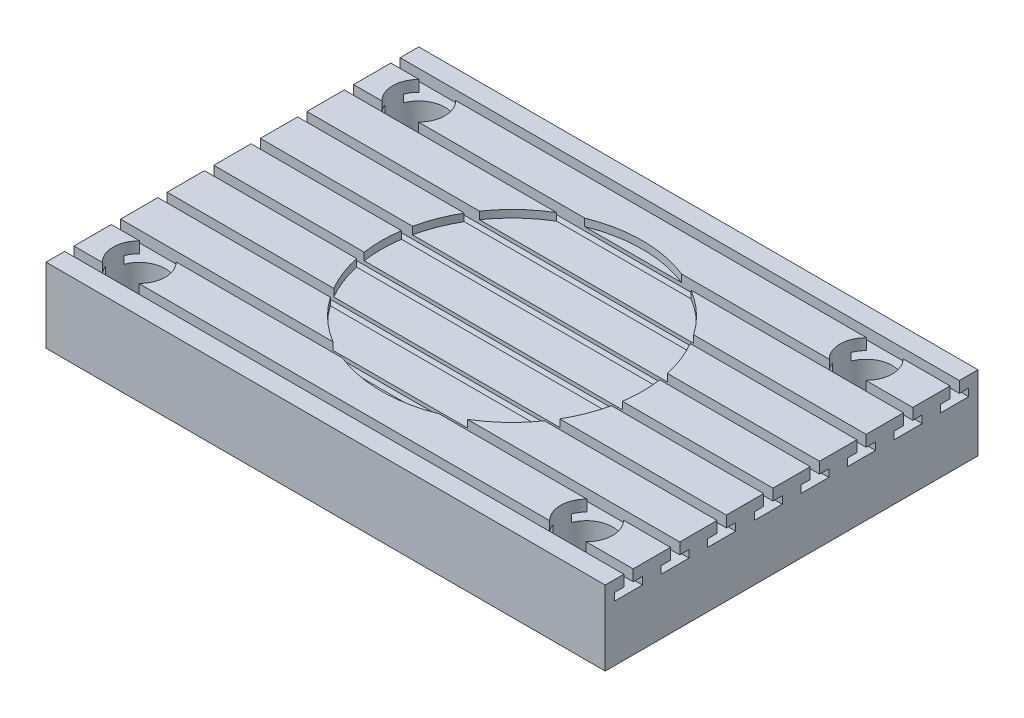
ISO-10303-21;
HEADER;
FILE_DESCRIPTION(('STEP AP214'),'2;1');
FILE_NAME('part.step','',(''),(''),'','','');
FILE_SCHEMA(('AUTOMOTIVE_DESIGN { 1 0 10303 214 1 1 1 1 }'));
ENDSEC;
DATA;
#1=APPLICATION_CONTEXT('core data for automotive mechanical design processes');
#2=APPLICATION_PROTOCOL_DEFINITION('international standard','automotive_design',2000,#1);
#3=PRODUCT_CONTEXT('',#1,'mechanical');
#4=PRODUCT('Part','Part','',(#3));
#5=PRODUCT_RELATED_PRODUCT_CATEGORY('part','',(#4));
#6=PRODUCT_DEFINITION_FORMATION('','',#4);
#7=PRODUCT_DEFINITION_CONTEXT('part definition',#1,'design');
#8=PRODUCT_DEFINITION('design','',#6,#7);
#9=PRODUCT_DEFINITION_SHAPE('','',#8);
#10=(LENGTH_UNIT() NAMED_UNIT(*) SI_UNIT(.MILLI.,.METRE.));
#11=(NAMED_UNIT(*) PLANE_ANGLE_UNIT() SI_UNIT($,.RADIAN.));
#12=(NAMED_UNIT(*) SI_UNIT($,.STERADIAN.) SOLID_ANGLE_UNIT());
#13=UNCERTAINTY_MEASURE_WITH_UNIT(LENGTH_MEASURE(1.E-05),#10,'distance_accuracy_value','');
#14=(GEOMETRIC_REPRESENTATION_CONTEXT(3) GLOBAL_UNCERTAINTY_ASSIGNED_CONTEXT((#13)) GLOBAL_UNIT_ASSIGNED_CONTEXT((#10,
#11,#12)) REPRESENTATION_CONTEXT('',''));
#15=CARTESIAN_POINT('',(0.,0.,0.));
#16=DIRECTION('',(0.,0.,1.));
#17=DIRECTION('',(1.,0.,0.));
#18=AXIS2_PLACEMENT_3D('',#15,#16,#17);
#19=CARTESIAN_POINT('',(-75.,20.,50.));
#20=DIRECTION('',(0.,1.,0.));
#21=DIRECTION('',(0.,0.,1.));
#22=AXIS2_PLACEMENT_3D('',#19,#20,#21);
#23=PLANE('',#22);
#24=CARTESIAN_POINT('',(0.,20.,0.));
#25=DIRECTION('',(0.,1.,0.));
#26=DIRECTION('',(0.,0.,1.));
#27=AXIS2_PLACEMENT_3D('',#24,#25,#26);
#28=CIRCLE('',#27,35.);
#29=CARTESIAN_POINT('',(28.7228132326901,20.,-20.));
#30=VERTEX_POINT('',#29);
#31=CARTESIAN_POINT('',(18.0277563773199,20.,-30.));
#32=VERTEX_POINT('',#31);
#33=EDGE_CURVE('E1478',#30,#32,#28,.T.);
#34=ORIENTED_EDGE('',*,*,#33,.F.);
#35=DIRECTION('',(1.,0.,0.));
#36=VECTOR('',#35,1.);
#37=CARTESIAN_POINT('',(-75.,20.,-20.));
#38=LINE('',#37,#36);
#39=CARTESIAN_POINT('',(75.,20.,-20.));
#40=VERTEX_POINT('',#39);
#41=EDGE_CURVE('E1116',#30,#40,#38,.T.);
#42=ORIENTED_EDGE('',*,*,#41,.T.);
#43=DIRECTION('',(0.,0.,-1.));
#44=VECTOR('',#43,1.);
#45=CARTESIAN_POINT('',(75.,20.,-50.));
#46=LINE('',#45,#44);
#47=CARTESIAN_POINT('',(75.,20.,-30.));
#48=VERTEX_POINT('',#47);
#49=EDGE_CURVE('E1670',#40,#48,#46,.T.);
#50=ORIENTED_EDGE('',*,*,#49,.T.);
#51=DIRECTION('',(1.,0.,0.));
#52=VECTOR('',#51,1.);
#53=CARTESIAN_POINT('',(-75.,20.,-30.));
#54=LINE('',#53,#52);
#55=EDGE_CURVE('E1185',#32,#48,#54,.T.);
#56=ORIENTED_EDGE('',*,*,#55,.F.);
#57=EDGE_LOOP('',(#34,#42,#50,#56));
#58=FACE_BOUND('',#57,.T.);
#59=ADVANCED_FACE('F32',(#58),#23,.T.);
#60=CARTESIAN_POINT('',(34.1869858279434,20.,-7.50000000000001));
#61=VERTEX_POINT('',#60);
#62=CARTESIAN_POINT('',(30.3108891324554,20.,-17.5));
#63=VERTEX_POINT('',#62);
#64=EDGE_CURVE('E1475',#61,#63,#28,.T.);
#65=ORIENTED_EDGE('',*,*,#64,.F.);
#66=DIRECTION('',(1.,0.,0.));
#67=VECTOR('',#66,1.);
#68=CARTESIAN_POINT('',(-75.,20.,-7.50000000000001));
#69=LINE('',#68,#67);
#70=CARTESIAN_POINT('',(75.,20.,-7.50000000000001));
#71=VERTEX_POINT('',#70);
#72=EDGE_CURVE('E1054',#61,#71,#69,.T.);
#73=ORIENTED_EDGE('',*,*,#72,.T.);
#74=CARTESIAN_POINT('',(75.,20.,-17.5));
#75=VERTEX_POINT('',#74);
#76=EDGE_CURVE('E1676',#71,#75,#46,.T.);
#77=ORIENTED_EDGE('',*,*,#76,.T.);
#78=DIRECTION('',(1.,0.,0.));
#79=VECTOR('',#78,1.);
#80=CARTESIAN_POINT('',(-75.,20.,-17.5));
#81=LINE('',#80,#79);
#82=EDGE_CURVE('E1104',#63,#75,#81,.T.);
#83=ORIENTED_EDGE('',*,*,#82,.F.);
#84=EDGE_LOOP('',(#65,#73,#77,#83));
#85=FACE_BOUND('',#84,.T.);
#86=ADVANCED_FACE('F1775',(#85),#23,.T.);
#87=CARTESIAN_POINT('',(34.6410161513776,20.,4.99999999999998));
#88=VERTEX_POINT('',#87);
#89=CARTESIAN_POINT('',(34.6410161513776,20.,-5.00000000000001));
#90=VERTEX_POINT('',#89);
#91=EDGE_CURVE('E1474',#88,#90,#28,.T.);
#92=ORIENTED_EDGE('',*,*,#91,.F.);
#93=DIRECTION('',(1.,0.,0.));
#94=VECTOR('',#93,1.);
#95=CARTESIAN_POINT('',(-75.,20.,4.99999999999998));
#96=LINE('',#95,#94);
#97=CARTESIAN_POINT('',(75.,20.,4.99999999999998));
#98=VERTEX_POINT('',#97);
#99=EDGE_CURVE('E992',#88,#98,#96,.T.);
#100=ORIENTED_EDGE('',*,*,#99,.T.);
#101=CARTESIAN_POINT('',(75.,20.,-5.00000000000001));
#102=VERTEX_POINT('',#101);
#103=EDGE_CURVE('E1679',#98,#102,#46,.T.);
#104=ORIENTED_EDGE('',*,*,#103,.T.);
#105=DIRECTION('',(1.,0.,0.));
#106=VECTOR('',#105,1.);
#107=CARTESIAN_POINT('',(-75.,20.,-5.00000000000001));
#108=LINE('',#107,#106);
#109=EDGE_CURVE('E1042',#90,#102,#108,.T.);
#110=ORIENTED_EDGE('',*,*,#109,.F.);
#111=EDGE_LOOP('',(#92,#100,#104,#110));
#112=FACE_BOUND('',#111,.T.);
#113=ADVANCED_FACE('F1781',(#112),#23,.T.);
#114=CARTESIAN_POINT('',(30.3108891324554,20.,17.5));
#115=VERTEX_POINT('',#114);
#116=CARTESIAN_POINT('',(34.1869858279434,20.,7.49999999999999));
#117=VERTEX_POINT('',#116);
#118=EDGE_CURVE('E1424',#115,#117,#28,.T.);
#119=ORIENTED_EDGE('',*,*,#118,.F.);
#120=DIRECTION('',(1.,0.,0.));
#121=VECTOR('',#120,1.);
#122=CARTESIAN_POINT('',(-75.,20.,17.5));
#123=LINE('',#122,#121);
#124=CARTESIAN_POINT('',(75.,20.,17.5));
#125=VERTEX_POINT('',#124);
#126=EDGE_CURVE('E930',#115,#125,#123,.T.);
#127=ORIENTED_EDGE('',*,*,#126,.T.);
#128=CARTESIAN_POINT('',(75.,20.,7.49999999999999));
#129=VERTEX_POINT('',#128);
#130=EDGE_CURVE('E2786',#125,#129,#46,.T.);
#131=ORIENTED_EDGE('',*,*,#130,.T.);
#132=DIRECTION('',(1.,0.,0.));
#133=VECTOR('',#132,1.);
#134=CARTESIAN_POINT('',(-75.,20.,7.49999999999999));
#135=LINE('',#134,#133);
#136=EDGE_CURVE('E980',#117,#129,#135,.T.);
#137=ORIENTED_EDGE('',*,*,#136,.F.);
#138=EDGE_LOOP('',(#119,#127,#131,#137));
#139=FACE_BOUND('',#138,.T.);
#140=ADVANCED_FACE('F1472',(#139),#23,.T.);
#141=CARTESIAN_POINT('',(18.02775637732,20.,30.));
#142=VERTEX_POINT('',#141);
#143=CARTESIAN_POINT('',(28.7228132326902,20.,20.));
#144=VERTEX_POINT('',#143);
#145=EDGE_CURVE('E805',#142,#144,#28,.T.);
#146=ORIENTED_EDGE('',*,*,#145,.F.);
#147=DIRECTION('',(1.,0.,0.));
#148=VECTOR('',#147,1.);
#149=CARTESIAN_POINT('',(-75.,20.,30.));
#150=LINE('',#149,#148);
#151=CARTESIAN_POINT('',(75.,20.,30.));
#152=VERTEX_POINT('',#151);
#153=EDGE_CURVE('E872',#142,#152,#150,.T.);
#154=ORIENTED_EDGE('',*,*,#153,.T.);
#155=CARTESIAN_POINT('',(75.,20.,20.));
#156=VERTEX_POINT('',#155);
#157=EDGE_CURVE('E2784',#152,#156,#46,.T.);
#158=ORIENTED_EDGE('',*,*,#157,.T.);
#159=DIRECTION('',(1.,0.,0.));
#160=VECTOR('',#159,1.);
#161=CARTESIAN_POINT('',(-75.,20.,20.));
#162=LINE('',#161,#160);
#163=EDGE_CURVE('E918',#144,#156,#162,.T.);
#164=ORIENTED_EDGE('',*,*,#163,.F.);
#165=EDGE_LOOP('',(#146,#154,#158,#164));
#166=FACE_BOUND('',#165,.T.);
#167=ADVANCED_FACE('F2487',(#166),#23,.T.);
#168=DIRECTION('',(1.,0.,0.));
#169=VECTOR('',#168,1.);
#170=CARTESIAN_POINT('',(-75.,20.,-45.));
#171=LINE('',#170,#169);
#172=CARTESIAN_POINT('',(-75.,20.,-45.));
#173=VERTEX_POINT('',#172);
#174=CARTESIAN_POINT('',(75.,20.,-45.));
#175=VERTEX_POINT('',#174);
#176=EDGE_CURVE('E1271',#173,#175,#171,.T.);
#177=ORIENTED_EDGE('',*,*,#176,.T.);
#178=CARTESIAN_POINT('',(75.,20.,-50.));
#179=VERTEX_POINT('',#178);
#180=EDGE_CURVE('E1526',#175,#179,#46,.T.);
#181=ORIENTED_EDGE('',*,*,#180,.T.);
#182=DIRECTION('',(-1.,0.,0.));
#183=VECTOR('',#182,1.);
#184=CARTESIAN_POINT('',(-75.,20.,-50.));
#185=LINE('',#184,#183);
#186=CARTESIAN_POINT('',(-75.,20.,-50.));
#187=VERTEX_POINT('',#186);
#188=EDGE_CURVE('E1530',#179,#187,#185,.T.);
#189=ORIENTED_EDGE('',*,*,#188,.T.);
#190=DIRECTION('',(0.,0.,1.));
#191=VECTOR('',#190,1.);
#192=CARTESIAN_POINT('',(-75.,20.,-50.));
#193=LINE('',#192,#191);
#194=EDGE_CURVE('E1517',#187,#173,#193,.T.);
#195=ORIENTED_EDGE('',*,*,#194,.T.);
#196=EDGE_LOOP('',(#177,#181,#189,#195));
#197=FACE_BOUND('',#196,.T.);
#198=ADVANCED_FACE('F1687',(#197),#23,.T.);
#199=DIRECTION('',(1.,0.,0.));
#200=VECTOR('',#199,1.);
#201=CARTESIAN_POINT('',(-75.,20.,-42.5));
#202=LINE('',#201,#200);
#203=CARTESIAN_POINT('',(-75.,20.,-42.5));
#204=VERTEX_POINT('',#203);
#205=CARTESIAN_POINT('',(-67.3989794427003,20.,-42.5));
#206=VERTEX_POINT('',#205);
#207=EDGE_CURVE('E1272',#204,#206,#202,.T.);
#208=ORIENTED_EDGE('',*,*,#207,.F.);
#209=CARTESIAN_POINT('',(-75.,20.,-32.5));
#210=VERTEX_POINT('',#209);
#211=EDGE_CURVE('E1522',#204,#210,#193,.T.);
#212=ORIENTED_EDGE('',*,*,#211,.T.);
#213=DIRECTION('',(1.,0.,0.));
#214=VECTOR('',#213,1.);
#215=CARTESIAN_POINT('',(-75.,20.,-32.5));
#216=LINE('',#215,#214);
#217=CARTESIAN_POINT('',(-67.3989794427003,20.,-32.5));
#218=VERTEX_POINT('',#217);
#219=EDGE_CURVE('E1180',#210,#218,#216,.T.);
#220=ORIENTED_EDGE('',*,*,#219,.T.);
#221=CARTESIAN_POINT('',(-62.5,20.,-37.5));
#222=DIRECTION('',(0.,1.,0.));
#223=DIRECTION('',(0.,0.,1.));
#224=AXIS2_PLACEMENT_3D('',#221,#222,#223);
#225=CIRCLE('',#224,6.99999997);
#226=EDGE_CURVE('E1557',#206,#218,#225,.T.);
#227=ORIENTED_EDGE('',*,*,#226,.F.);
#228=EDGE_LOOP('',(#208,#212,#220,#227));
#229=FACE_BOUND('',#228,.T.);
#230=ADVANCED_FACE('F2503',(#229),#23,.T.);
#231=CARTESIAN_POINT('',(12.9903810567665,20.,-32.5));
#232=VERTEX_POINT('',#231);
#233=CARTESIAN_POINT('',(-12.9903810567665,20.,-32.5));
#234=VERTEX_POINT('',#233);
#235=EDGE_CURVE('E1481',#232,#234,#28,.T.);
#236=ORIENTED_EDGE('',*,*,#235,.F.);
#237=CARTESIAN_POINT('',(52.6010205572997,20.,-32.5));
#238=VERTEX_POINT('',#237);
#239=EDGE_CURVE('E1210',#232,#238,#216,.T.);
#240=ORIENTED_EDGE('',*,*,#239,.T.);
#241=CARTESIAN_POINT('',(57.5,20.,-37.5));
#242=DIRECTION('',(0.,1.,0.));
#243=DIRECTION('',(0.,0.,1.));
#244=AXIS2_PLACEMENT_3D('',#241,#242,#243);
#245=CIRCLE('',#244,6.99999997);
#246=CARTESIAN_POINT('',(52.6010205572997,20.,-42.5));
#247=VERTEX_POINT('',#246);
#248=EDGE_CURVE('E1564',#247,#238,#245,.T.);
#249=ORIENTED_EDGE('',*,*,#248,.F.);
#250=CARTESIAN_POINT('',(-57.6010205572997,20.,-42.5));
#251=VERTEX_POINT('',#250);
#252=EDGE_CURVE('E1275',#251,#247,#202,.T.);
#253=ORIENTED_EDGE('',*,*,#252,.F.);
#254=CARTESIAN_POINT('',(-57.6010205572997,20.,-32.5));
#255=VERTEX_POINT('',#254);
#256=EDGE_CURVE('E1558',#255,#251,#225,.T.);
#257=ORIENTED_EDGE('',*,*,#256,.F.);
#258=EDGE_CURVE('E1209',#255,#234,#216,.T.);
#259=ORIENTED_EDGE('',*,*,#258,.T.);
#260=EDGE_LOOP('',(#236,#240,#249,#253,#257,#259));
#261=FACE_BOUND('',#260,.T.);
#262=ADVANCED_FACE('F1737',(#261),#23,.T.);
#263=CARTESIAN_POINT('',(62.3989794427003,20.,-42.5));
#264=VERTEX_POINT('',#263);
#265=CARTESIAN_POINT('',(75.,20.,-42.5));
#266=VERTEX_POINT('',#265);
#267=EDGE_CURVE('E1276',#264,#266,#202,.T.);
#268=ORIENTED_EDGE('',*,*,#267,.F.);
#269=CARTESIAN_POINT('',(62.3989794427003,20.,-32.5));
#270=VERTEX_POINT('',#269);
#271=EDGE_CURVE('E1565',#270,#264,#245,.T.);
#272=ORIENTED_EDGE('',*,*,#271,.F.);
#273=CARTESIAN_POINT('',(75.,20.,-32.5));
#274=VERTEX_POINT('',#273);
#275=EDGE_CURVE('E1205',#270,#274,#216,.T.);
#276=ORIENTED_EDGE('',*,*,#275,.T.);
#277=EDGE_CURVE('E1677',#274,#266,#46,.T.);
#278=ORIENTED_EDGE('',*,*,#277,.T.);
#279=EDGE_LOOP('',(#268,#272,#276,#278));
#280=FACE_BOUND('',#279,.T.);
#281=ADVANCED_FACE('F1733',(#280),#23,.T.);
#282=CARTESIAN_POINT('',(-18.0277563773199,20.,-30.));
#283=VERTEX_POINT('',#282);
#284=CARTESIAN_POINT('',(-28.7228132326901,20.,-20.));
#285=VERTEX_POINT('',#284);
#286=EDGE_CURVE('E1484',#283,#285,#28,.T.);
#287=ORIENTED_EDGE('',*,*,#286,.F.);
#288=CARTESIAN_POINT('',(-75.,20.,-30.));
#289=VERTEX_POINT('',#288);
#290=EDGE_CURVE('E1181',#289,#283,#54,.T.);
#291=ORIENTED_EDGE('',*,*,#290,.F.);
#292=CARTESIAN_POINT('',(-75.,20.,-20.));
#293=VERTEX_POINT('',#292);
#294=EDGE_CURVE('E1654',#289,#293,#193,.T.);
#295=ORIENTED_EDGE('',*,*,#294,.T.);
#296=EDGE_CURVE('E1079',#293,#285,#38,.T.);
#297=ORIENTED_EDGE('',*,*,#296,.T.);
#298=EDGE_LOOP('',(#287,#291,#295,#297));
#299=FACE_BOUND('',#298,.T.);
#300=ADVANCED_FACE('F1651',(#299),#23,.T.);
#301=CARTESIAN_POINT('',(-30.3108891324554,20.,-17.5));
#302=VERTEX_POINT('',#301);
#303=CARTESIAN_POINT('',(-34.1869858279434,20.,-7.50000000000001));
#304=VERTEX_POINT('',#303);
#305=EDGE_CURVE('E1487',#302,#304,#28,.T.);
#306=ORIENTED_EDGE('',*,*,#305,.F.);
#307=CARTESIAN_POINT('',(-75.,20.,-17.5));
#308=VERTEX_POINT('',#307);
#309=EDGE_CURVE('E1100',#308,#302,#81,.T.);
#310=ORIENTED_EDGE('',*,*,#309,.F.);
#311=CARTESIAN_POINT('',(-75.,20.,-7.50000000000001));
#312=VERTEX_POINT('',#311);
#313=EDGE_CURVE('E2827',#308,#312,#193,.T.);
#314=ORIENTED_EDGE('',*,*,#313,.T.);
#315=EDGE_CURVE('E1017',#312,#304,#69,.T.);
#316=ORIENTED_EDGE('',*,*,#315,.T.);
#317=EDGE_LOOP('',(#306,#310,#314,#316));
#318=FACE_BOUND('',#317,.T.);
#319=ADVANCED_FACE('F2515',(#318),#23,.T.);
#320=CARTESIAN_POINT('',(-34.6410161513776,20.,-5.00000000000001));
#321=VERTEX_POINT('',#320);
#322=CARTESIAN_POINT('',(-34.6410161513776,20.,4.99999999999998));
#323=VERTEX_POINT('',#322);
#324=EDGE_CURVE('E1490',#321,#323,#28,.T.);
#325=ORIENTED_EDGE('',*,*,#324,.F.);
#326=CARTESIAN_POINT('',(-75.,20.,-5.00000000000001));
#327=VERTEX_POINT('',#326);
#328=EDGE_CURVE('E1038',#327,#321,#108,.T.);
#329=ORIENTED_EDGE('',*,*,#328,.F.);
#330=CARTESIAN_POINT('',(-75.,20.,4.99999999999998));
#331=VERTEX_POINT('',#330);
#332=EDGE_CURVE('E1515',#327,#331,#193,.T.);
#333=ORIENTED_EDGE('',*,*,#332,.T.);
#334=EDGE_CURVE('E955',#331,#323,#96,.T.);
#335=ORIENTED_EDGE('',*,*,#334,.T.);
#336=EDGE_LOOP('',(#325,#329,#333,#335));
#337=FACE_BOUND('',#336,.T.);
#338=ADVANCED_FACE('F2523',(#337),#23,.T.);
#339=CARTESIAN_POINT('',(-34.1869858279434,20.,7.49999999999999));
#340=VERTEX_POINT('',#339);
#341=CARTESIAN_POINT('',(-30.3108891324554,20.,17.5));
#342=VERTEX_POINT('',#341);
#343=EDGE_CURVE('E1493',#340,#342,#28,.T.);
#344=ORIENTED_EDGE('',*,*,#343,.F.);
#345=CARTESIAN_POINT('',(-75.,20.,7.49999999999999));
#346=VERTEX_POINT('',#345);
#347=EDGE_CURVE('E976',#346,#340,#135,.T.);
#348=ORIENTED_EDGE('',*,*,#347,.F.);
#349=CARTESIAN_POINT('',(-75.,20.,17.5));
#350=VERTEX_POINT('',#349);
#351=EDGE_CURVE('E1512',#346,#350,#193,.T.);
#352=ORIENTED_EDGE('',*,*,#351,.T.);
#353=EDGE_CURVE('E894',#350,#342,#123,.T.);
#354=ORIENTED_EDGE('',*,*,#353,.T.);
#355=EDGE_LOOP('',(#344,#348,#352,#354));
#356=FACE_BOUND('',#355,.T.);
#357=ADVANCED_FACE('F2532',(#356),#23,.T.);
#358=CARTESIAN_POINT('',(-28.7228132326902,20.,20.));
#359=VERTEX_POINT('',#358);
#360=CARTESIAN_POINT('',(-18.02775637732,20.,30.));
#361=VERTEX_POINT('',#360);
#362=EDGE_CURVE('E803',#359,#361,#28,.T.);
#363=ORIENTED_EDGE('',*,*,#362,.F.);
#364=CARTESIAN_POINT('',(-75.,20.,20.));
#365=VERTEX_POINT('',#364);
#366=EDGE_CURVE('E914',#365,#359,#162,.T.);
#367=ORIENTED_EDGE('',*,*,#366,.F.);
#368=CARTESIAN_POINT('',(-75.,20.,30.));
#369=VERTEX_POINT('',#368);
#370=EDGE_CURVE('E1510',#365,#369,#193,.T.);
#371=ORIENTED_EDGE('',*,*,#370,.T.);
#372=EDGE_CURVE('E873',#369,#361,#150,.T.);
#373=ORIENTED_EDGE('',*,*,#372,.T.);
#374=EDGE_LOOP('',(#363,#367,#371,#373));
#375=FACE_BOUND('',#374,.T.);
#376=ADVANCED_FACE('F1508',(#375),#23,.T.);
#377=DIRECTION('',(1.,0.,0.));
#378=VECTOR('',#377,1.);
#379=CARTESIAN_POINT('',(-75.,20.,32.5));
#380=LINE('',#379,#378);
#381=CARTESIAN_POINT('',(-75.,20.,32.5));
#382=VERTEX_POINT('',#381);
#383=CARTESIAN_POINT('',(-67.3989794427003,20.,32.5));
#384=VERTEX_POINT('',#383);
#385=EDGE_CURVE('E820',#382,#384,#380,.T.);
#386=ORIENTED_EDGE('',*,*,#385,.F.);
#387=CARTESIAN_POINT('',(-75.,20.,42.5));
#388=VERTEX_POINT('',#387);
#389=EDGE_CURVE('E1513',#382,#388,#193,.T.);
#390=ORIENTED_EDGE('',*,*,#389,.T.);
#391=DIRECTION('',(1.,0.,0.));
#392=VECTOR('',#391,1.);
#393=CARTESIAN_POINT('',(-75.,20.,42.5));
#394=LINE('',#393,#392);
#395=CARTESIAN_POINT('',(-67.3989794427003,20.,42.5));
#396=VERTEX_POINT('',#395);
#397=EDGE_CURVE('E1846',#388,#396,#394,.T.);
#398=ORIENTED_EDGE('',*,*,#397,.T.);
#399=CARTESIAN_POINT('',(-62.5,20.,37.5));
#400=DIRECTION('',(0.,1.,0.));
#401=DIRECTION('',(0.,0.,1.));
#402=AXIS2_PLACEMENT_3D('',#399,#400,#401);
#403=CIRCLE('',#402,6.99999997);
#404=EDGE_CURVE('E1822',#384,#396,#403,.T.);
#405=ORIENTED_EDGE('',*,*,#404,.F.);
#406=EDGE_LOOP('',(#386,#390,#398,#405));
#407=FACE_BOUND('',#406,.T.);
#408=ADVANCED_FACE('F1805',(#407),#23,.T.);
#409=CARTESIAN_POINT('',(-12.9903810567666,20.,32.5));
#410=VERTEX_POINT('',#409);
#411=CARTESIAN_POINT('',(12.9903810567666,20.,32.5));
#412=VERTEX_POINT('',#411);
#413=EDGE_CURVE('E792',#410,#412,#28,.T.);
#414=ORIENTED_EDGE('',*,*,#413,.F.);
#415=CARTESIAN_POINT('',(-57.6010205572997,20.,32.5));
#416=VERTEX_POINT('',#415);
#417=EDGE_CURVE('E817',#416,#410,#380,.T.);
#418=ORIENTED_EDGE('',*,*,#417,.F.);
#419=CARTESIAN_POINT('',(-57.6010205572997,20.,42.5));
#420=VERTEX_POINT('',#419);
#421=EDGE_CURVE('E1523',#420,#416,#403,.T.);
#422=ORIENTED_EDGE('',*,*,#421,.F.);
#423=CARTESIAN_POINT('',(52.6010205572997,20.,42.5));
#424=VERTEX_POINT('',#423);
#425=EDGE_CURVE('E1874',#420,#424,#394,.T.);
#426=ORIENTED_EDGE('',*,*,#425,.T.);
#427=CARTESIAN_POINT('',(57.5,20.,37.5));
#428=DIRECTION('',(0.,1.,0.));
#429=DIRECTION('',(0.,0.,1.));
#430=AXIS2_PLACEMENT_3D('',#427,#428,#429);
#431=CIRCLE('',#430,6.99999997);
#432=CARTESIAN_POINT('',(52.6010205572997,20.,32.5));
#433=VERTEX_POINT('',#432);
#434=EDGE_CURVE('E816',#433,#424,#431,.T.);
#435=ORIENTED_EDGE('',*,*,#434,.F.);
#436=EDGE_CURVE('E808',#412,#433,#380,.T.);
#437=ORIENTED_EDGE('',*,*,#436,.F.);
#438=EDGE_LOOP('',(#414,#418,#422,#426,#435,#437));
#439=FACE_BOUND('',#438,.T.);
#440=ADVANCED_FACE('F814',(#439),#23,.T.);
#441=CARTESIAN_POINT('',(62.3989794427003,20.,32.5));
#442=VERTEX_POINT('',#441);
#443=CARTESIAN_POINT('',(75.,20.,32.5));
#444=VERTEX_POINT('',#443);
#445=EDGE_CURVE('E818',#442,#444,#380,.T.);
#446=ORIENTED_EDGE('',*,*,#445,.F.);
#447=CARTESIAN_POINT('',(62.3989794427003,20.,42.5));
#448=VERTEX_POINT('',#447);
#449=EDGE_CURVE('E1811',#448,#442,#431,.T.);
#450=ORIENTED_EDGE('',*,*,#449,.F.);
#451=CARTESIAN_POINT('',(75.,20.,42.5));
#452=VERTEX_POINT('',#451);
#453=EDGE_CURVE('E1870',#448,#452,#394,.T.);
#454=ORIENTED_EDGE('',*,*,#453,.T.);
#455=EDGE_CURVE('E1531',#452,#444,#46,.T.);
#456=ORIENTED_EDGE('',*,*,#455,.T.);
#457=EDGE_LOOP('',(#446,#450,#454,#456));
#458=FACE_BOUND('',#457,.T.);
#459=ADVANCED_FACE('F1788',(#458),#23,.T.);
#460=CARTESIAN_POINT('',(-75.,20.,-50.));
#461=DIRECTION('',(1.,0.,0.));
#462=DIRECTION('',(0.,0.,-1.));
#463=AXIS2_PLACEMENT_3D('',#460,#461,#462);
#464=PLANE('',#463);
#465=DIRECTION('',(0.,0.,1.));
#466=VECTOR('',#465,1.);
#467=CARTESIAN_POINT('',(-75.,17.,-47.5));
#468=LINE('',#467,#466);
#469=CARTESIAN_POINT('',(-75.,17.,-47.5));
#470=VERTEX_POINT('',#469);
#471=CARTESIAN_POINT('',(-75.,17.,-45.));
#472=VERTEX_POINT('',#471);
#473=EDGE_CURVE('E1322',#470,#472,#468,.T.);
#474=ORIENTED_EDGE('',*,*,#473,.T.);
#475=DIRECTION('',(0.,1.,0.));
#476=VECTOR('',#475,1.);
#477=CARTESIAN_POINT('',(-75.,17.,-45.));
#478=LINE('',#477,#476);
#479=EDGE_CURVE('E1319',#472,#173,#478,.T.);
#480=ORIENTED_EDGE('',*,*,#479,.T.);
#481=ORIENTED_EDGE('',*,*,#194,.F.);
#482=DIRECTION('',(0.,-1.,0.));
#483=VECTOR('',#482,1.);
#484=CARTESIAN_POINT('',(-75.,20.,-50.));
#485=LINE('',#484,#483);
#486=CARTESIAN_POINT('',(-75.,0.,-50.));
#487=VERTEX_POINT('',#486);
#488=EDGE_CURVE('E1533',#187,#487,#485,.T.);
#489=ORIENTED_EDGE('',*,*,#488,.T.);
#490=DIRECTION('',(0.,0.,1.));
#491=VECTOR('',#490,1.);
#492=CARTESIAN_POINT('',(-75.,0.,-50.));
#493=LINE('',#492,#491);
#494=CARTESIAN_POINT('',(-75.,0.,50.));
#495=VERTEX_POINT('',#494);
#496=EDGE_CURVE('E1534',#487,#495,#493,.T.);
#497=ORIENTED_EDGE('',*,*,#496,.T.);
#498=DIRECTION('',(0.,-1.,0.));
#499=VECTOR('',#498,1.);
#500=CARTESIAN_POINT('',(-75.,20.,50.));
#501=LINE('',#500,#499);
#502=CARTESIAN_POINT('',(-75.,20.,50.));
#503=VERTEX_POINT('',#502);
#504=EDGE_CURVE('E1551',#503,#495,#501,.T.);
#505=ORIENTED_EDGE('',*,*,#504,.F.);
#506=CARTESIAN_POINT('',(-75.,20.,45.));
#507=VERTEX_POINT('',#506);
#508=EDGE_CURVE('E1516',#507,#503,#193,.T.);
#509=ORIENTED_EDGE('',*,*,#508,.F.);
#510=DIRECTION('',(0.,-1.,0.));
#511=VECTOR('',#510,1.);
#512=CARTESIAN_POINT('',(-75.,20.,45.));
#513=LINE('',#512,#511);
#514=CARTESIAN_POINT('',(-75.,17.,45.));
#515=VERTEX_POINT('',#514);
#516=EDGE_CURVE('E1877',#507,#515,#513,.T.);
#517=ORIENTED_EDGE('',*,*,#516,.T.);
#518=DIRECTION('',(0.,0.,1.));
#519=VECTOR('',#518,1.);
#520=CARTESIAN_POINT('',(-75.,17.,45.));
#521=LINE('',#520,#519);
#522=CARTESIAN_POINT('',(-75.,17.,47.5));
#523=VERTEX_POINT('',#522);
#524=EDGE_CURVE('E1911',#515,#523,#521,.T.);
#525=ORIENTED_EDGE('',*,*,#524,.T.);
#526=DIRECTION('',(0.,-1.,0.));
#527=VECTOR('',#526,1.);
#528=CARTESIAN_POINT('',(-75.,17.,47.5));
#529=LINE('',#528,#527);
#530=CARTESIAN_POINT('',(-75.,15.,47.5));
#531=VERTEX_POINT('',#530);
#532=EDGE_CURVE('E1908',#523,#531,#529,.T.);
#533=ORIENTED_EDGE('',*,*,#532,.T.);
#534=DIRECTION('',(0.,0.,-1.));
#535=VECTOR('',#534,1.);
#536=CARTESIAN_POINT('',(-75.,15.,47.5));
#537=LINE('',#536,#535);
#538=CARTESIAN_POINT('',(-75.,15.,40.));
#539=VERTEX_POINT('',#538);
#540=EDGE_CURVE('E1905',#531,#539,#537,.T.);
#541=ORIENTED_EDGE('',*,*,#540,.T.);
#542=DIRECTION('',(0.,1.,0.));
#543=VECTOR('',#542,1.);
#544=CARTESIAN_POINT('',(-75.,15.,40.));
#545=LINE('',#544,#543);
#546=CARTESIAN_POINT('',(-75.,17.,40.));
#547=VERTEX_POINT('',#546);
#548=EDGE_CURVE('E1902',#539,#547,#545,.T.);
#549=ORIENTED_EDGE('',*,*,#548,.T.);
#550=DIRECTION('',(0.,0.,1.));
#551=VECTOR('',#550,1.);
#552=CARTESIAN_POINT('',(-75.,17.,40.));
#553=LINE('',#552,#551);
#554=CARTESIAN_POINT('',(-75.,17.,42.5));
#555=VERTEX_POINT('',#554);
#556=EDGE_CURVE('E1899',#547,#555,#553,.T.);
#557=ORIENTED_EDGE('',*,*,#556,.T.);
#558=DIRECTION('',(0.,1.,0.));
#559=VECTOR('',#558,1.);
#560=CARTESIAN_POINT('',(-75.,17.,42.5));
#561=LINE('',#560,#559);
#562=EDGE_CURVE('E1850',#555,#388,#561,.T.);
#563=ORIENTED_EDGE('',*,*,#562,.T.);
#564=ORIENTED_EDGE('',*,*,#389,.F.);
#565=DIRECTION('',(0.,-1.,0.));
#566=VECTOR('',#565,1.);
#567=CARTESIAN_POINT('',(-75.,20.,32.5));
#568=LINE('',#567,#566);
#569=CARTESIAN_POINT('',(-75.,17.,32.5));
#570=VERTEX_POINT('',#569);
#571=EDGE_CURVE('E880',#382,#570,#568,.T.);
#572=ORIENTED_EDGE('',*,*,#571,.T.);
#573=DIRECTION('',(0.,0.,1.));
#574=VECTOR('',#573,1.);
#575=CARTESIAN_POINT('',(-75.,17.,32.5));
#576=LINE('',#575,#574);
#577=CARTESIAN_POINT('',(-75.,17.,35.));
#578=VERTEX_POINT('',#577);
#579=EDGE_CURVE('E909',#570,#578,#576,.T.);
#580=ORIENTED_EDGE('',*,*,#579,.T.);
#581=DIRECTION('',(0.,-1.,0.));
#582=VECTOR('',#581,1.);
#583=CARTESIAN_POINT('',(-75.,17.,35.));
#584=LINE('',#583,#582);
#585=CARTESIAN_POINT('',(-75.,15.,35.));
#586=VERTEX_POINT('',#585);
#587=EDGE_CURVE('E906',#578,#586,#584,.T.);
#588=ORIENTED_EDGE('',*,*,#587,.T.);
#589=DIRECTION('',(0.,0.,-1.));
#590=VECTOR('',#589,1.);
#591=CARTESIAN_POINT('',(-75.,15.,35.));
#592=LINE('',#591,#590);
#593=CARTESIAN_POINT('',(-75.,15.,27.5));
#594=VERTEX_POINT('',#593);
#595=EDGE_CURVE('E903',#586,#594,#592,.T.);
#596=ORIENTED_EDGE('',*,*,#595,.T.);
#597=DIRECTION('',(0.,1.,0.));
#598=VECTOR('',#597,1.);
#599=CARTESIAN_POINT('',(-75.,15.,27.5));
#600=LINE('',#599,#598);
#601=CARTESIAN_POINT('',(-75.,17.,27.5));
#602=VERTEX_POINT('',#601);
#603=EDGE_CURVE('E900',#594,#602,#600,.T.);
#604=ORIENTED_EDGE('',*,*,#603,.T.);
#605=DIRECTION('',(0.,0.,1.));
#606=VECTOR('',#605,1.);
#607=CARTESIAN_POINT('',(-75.,17.,27.5));
#608=LINE('',#607,#606);
#609=CARTESIAN_POINT('',(-75.,17.,30.));
#610=VERTEX_POINT('',#609);
#611=EDGE_CURVE('E897',#602,#610,#608,.T.);
#612=ORIENTED_EDGE('',*,*,#611,.T.);
#613=DIRECTION('',(0.,1.,0.));
#614=VECTOR('',#613,1.);
#615=CARTESIAN_POINT('',(-75.,17.,30.));
#616=LINE('',#615,#614);
#617=EDGE_CURVE('E821',#610,#369,#616,.T.);
#618=ORIENTED_EDGE('',*,*,#617,.T.);
#619=ORIENTED_EDGE('',*,*,#370,.F.);
#620=DIRECTION('',(0.,-1.,0.));
#621=VECTOR('',#620,1.);
#622=CARTESIAN_POINT('',(-75.,20.,20.));
#623=LINE('',#622,#621);
#624=CARTESIAN_POINT('',(-75.,17.,20.));
#625=VERTEX_POINT('',#624);
#626=EDGE_CURVE('E936',#365,#625,#623,.T.);
#627=ORIENTED_EDGE('',*,*,#626,.T.);
#628=DIRECTION('',(0.,0.,1.));
#629=VECTOR('',#628,1.);
#630=CARTESIAN_POINT('',(-75.,17.,20.));
#631=LINE('',#630,#629);
#632=CARTESIAN_POINT('',(-75.,17.,22.5));
#633=VERTEX_POINT('',#632);
#634=EDGE_CURVE('E971',#625,#633,#631,.T.);
#635=ORIENTED_EDGE('',*,*,#634,.T.);
#636=DIRECTION('',(0.,-1.,0.));
#637=VECTOR('',#636,1.);
#638=CARTESIAN_POINT('',(-75.,17.,22.5));
#639=LINE('',#638,#637);
#640=CARTESIAN_POINT('',(-75.,15.,22.5));
#641=VERTEX_POINT('',#640);
#642=EDGE_CURVE('E968',#633,#641,#639,.T.);
#643=ORIENTED_EDGE('',*,*,#642,.T.);
#644=DIRECTION('',(0.,0.,-1.));
#645=VECTOR('',#644,1.);
#646=CARTESIAN_POINT('',(-75.,15.,22.5));
#647=LINE('',#646,#645);
#648=CARTESIAN_POINT('',(-75.,15.,15.));
#649=VERTEX_POINT('',#648);
#650=EDGE_CURVE('E965',#641,#649,#647,.T.);
#651=ORIENTED_EDGE('',*,*,#650,.T.);
#652=DIRECTION('',(0.,1.,0.));
#653=VECTOR('',#652,1.);
#654=CARTESIAN_POINT('',(-75.,15.,15.));
#655=LINE('',#654,#653);
#656=CARTESIAN_POINT('',(-75.,17.,15.));
#657=VERTEX_POINT('',#656);
#658=EDGE_CURVE('E962',#649,#657,#655,.T.);
#659=ORIENTED_EDGE('',*,*,#658,.T.);
#660=DIRECTION('',(0.,0.,1.));
#661=VECTOR('',#660,1.);
#662=CARTESIAN_POINT('',(-75.,17.,15.));
#663=LINE('',#662,#661);
#664=CARTESIAN_POINT('',(-75.,17.,17.5));
#665=VERTEX_POINT('',#664);
#666=EDGE_CURVE('E959',#657,#665,#663,.T.);
#667=ORIENTED_EDGE('',*,*,#666,.T.);
#668=DIRECTION('',(0.,1.,0.));
#669=VECTOR('',#668,1.);
#670=CARTESIAN_POINT('',(-75.,17.,17.5));
#671=LINE('',#670,#669);
#672=EDGE_CURVE('E956',#665,#350,#671,.T.);
#673=ORIENTED_EDGE('',*,*,#672,.T.);
#674=ORIENTED_EDGE('',*,*,#351,.F.);
#675=DIRECTION('',(0.,-1.,0.));
#676=VECTOR('',#675,1.);
#677=CARTESIAN_POINT('',(-75.,20.,7.49999999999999));
#678=LINE('',#677,#676);
#679=CARTESIAN_POINT('',(-75.,17.,7.49999999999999));
#680=VERTEX_POINT('',#679);
#681=EDGE_CURVE('E998',#346,#680,#678,.T.);
#682=ORIENTED_EDGE('',*,*,#681,.T.);
#683=DIRECTION('',(0.,0.,1.));
#684=VECTOR('',#683,1.);
#685=CARTESIAN_POINT('',(-75.,17.,7.49999999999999));
#686=LINE('',#685,#684);
#687=CARTESIAN_POINT('',(-75.,17.,9.99999999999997));
#688=VERTEX_POINT('',#687);
#689=EDGE_CURVE('E1033',#680,#688,#686,.T.);
#690=ORIENTED_EDGE('',*,*,#689,.T.);
#691=DIRECTION('',(0.,-1.,0.));
#692=VECTOR('',#691,1.);
#693=CARTESIAN_POINT('',(-75.,17.,9.99999999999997));
#694=LINE('',#693,#692);
#695=CARTESIAN_POINT('',(-75.,15.,9.99999999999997));
#696=VERTEX_POINT('',#695);
#697=EDGE_CURVE('E1030',#688,#696,#694,.T.);
#698=ORIENTED_EDGE('',*,*,#697,.T.);
#699=DIRECTION('',(0.,0.,-1.));
#700=VECTOR('',#699,1.);
#701=CARTESIAN_POINT('',(-75.,15.,9.99999999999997));
#702=LINE('',#701,#700);
#703=CARTESIAN_POINT('',(-75.,15.,2.5));
#704=VERTEX_POINT('',#703);
#705=EDGE_CURVE('E1027',#696,#704,#702,.T.);
#706=ORIENTED_EDGE('',*,*,#705,.T.);
#707=DIRECTION('',(0.,1.,0.));
#708=VECTOR('',#707,1.);
#709=CARTESIAN_POINT('',(-75.,15.,2.5));
#710=LINE('',#709,#708);
#711=CARTESIAN_POINT('',(-75.,17.,2.5));
#712=VERTEX_POINT('',#711);
#713=EDGE_CURVE('E1024',#704,#712,#710,.T.);
#714=ORIENTED_EDGE('',*,*,#713,.T.);
#715=DIRECTION('',(0.,0.,1.));
#716=VECTOR('',#715,1.);
#717=CARTESIAN_POINT('',(-75.,17.,2.5));
#718=LINE('',#717,#716);
#719=CARTESIAN_POINT('',(-75.,17.,4.99999999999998));
#720=VERTEX_POINT('',#719);
#721=EDGE_CURVE('E1021',#712,#720,#718,.T.);
#722=ORIENTED_EDGE('',*,*,#721,.T.);
#723=DIRECTION('',(0.,1.,0.));
#724=VECTOR('',#723,1.);
#725=CARTESIAN_POINT('',(-75.,17.,4.99999999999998));
#726=LINE('',#725,#724);
#727=EDGE_CURVE('E1018',#720,#331,#726,.T.);
#728=ORIENTED_EDGE('',*,*,#727,.T.);
#729=ORIENTED_EDGE('',*,*,#332,.F.);
#730=DIRECTION('',(0.,-1.,0.));
#731=VECTOR('',#730,1.);
#732=CARTESIAN_POINT('',(-75.,20.,-5.00000000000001));
#733=LINE('',#732,#731);
#734=CARTESIAN_POINT('',(-75.,17.,-5.00000000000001));
#735=VERTEX_POINT('',#734);
#736=EDGE_CURVE('E1060',#327,#735,#733,.T.);
#737=ORIENTED_EDGE('',*,*,#736,.T.);
#738=DIRECTION('',(0.,0.,1.));
#739=VECTOR('',#738,1.);
#740=CARTESIAN_POINT('',(-75.,17.,-5.00000000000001));
#741=LINE('',#740,#739);
#742=CARTESIAN_POINT('',(-75.,17.,-2.50000000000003));
#743=VERTEX_POINT('',#742);
#744=EDGE_CURVE('E1095',#735,#743,#741,.T.);
#745=ORIENTED_EDGE('',*,*,#744,.T.);
#746=DIRECTION('',(0.,-1.,0.));
#747=VECTOR('',#746,1.);
#748=CARTESIAN_POINT('',(-75.,17.,-2.50000000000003));
#749=LINE('',#748,#747);
#750=CARTESIAN_POINT('',(-75.,15.,-2.50000000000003));
#751=VERTEX_POINT('',#750);
#752=EDGE_CURVE('E1092',#743,#751,#749,.T.);
#753=ORIENTED_EDGE('',*,*,#752,.T.);
#754=DIRECTION('',(0.,0.,-1.));
#755=VECTOR('',#754,1.);
#756=CARTESIAN_POINT('',(-75.,15.,-2.50000000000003));
#757=LINE('',#756,#755);
#758=CARTESIAN_POINT('',(-75.,15.,-9.99999999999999));
#759=VERTEX_POINT('',#758);
#760=EDGE_CURVE('E1089',#751,#759,#757,.T.);
#761=ORIENTED_EDGE('',*,*,#760,.T.);
#762=DIRECTION('',(0.,1.,0.));
#763=VECTOR('',#762,1.);
#764=CARTESIAN_POINT('',(-75.,15.,-9.99999999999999));
#765=LINE('',#764,#763);
#766=CARTESIAN_POINT('',(-75.,17.,-9.99999999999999));
#767=VERTEX_POINT('',#766);
#768=EDGE_CURVE('E1086',#759,#767,#765,.T.);
#769=ORIENTED_EDGE('',*,*,#768,.T.);
#770=DIRECTION('',(0.,0.,1.));
#771=VECTOR('',#770,1.);
#772=CARTESIAN_POINT('',(-75.,17.,-9.99999999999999));
#773=LINE('',#772,#771);
#774=CARTESIAN_POINT('',(-75.,17.,-7.50000000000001));
#775=VERTEX_POINT('',#774);
#776=EDGE_CURVE('E1083',#767,#775,#773,.T.);
#777=ORIENTED_EDGE('',*,*,#776,.T.);
#778=DIRECTION('',(0.,1.,0.));
#779=VECTOR('',#778,1.);
#780=CARTESIAN_POINT('',(-75.,17.,-7.50000000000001));
#781=LINE('',#780,#779);
#782=EDGE_CURVE('E1080',#775,#312,#781,.T.);
#783=ORIENTED_EDGE('',*,*,#782,.T.);
#784=ORIENTED_EDGE('',*,*,#313,.F.);
#785=DIRECTION('',(0.,-1.,0.));
#786=VECTOR('',#785,1.);
#787=CARTESIAN_POINT('',(-75.,20.,-17.5));
#788=LINE('',#787,#786);
#789=CARTESIAN_POINT('',(-75.,17.,-17.5));
#790=VERTEX_POINT('',#789);
#791=EDGE_CURVE('E1122',#308,#790,#788,.T.);
#792=ORIENTED_EDGE('',*,*,#791,.T.);
#793=DIRECTION('',(0.,0.,1.));
#794=VECTOR('',#793,1.);
#795=CARTESIAN_POINT('',(-75.,17.,-17.5));
#796=LINE('',#795,#794);
#797=CARTESIAN_POINT('',(-75.,17.,-15.));
#798=VERTEX_POINT('',#797);
#799=EDGE_CURVE('E1157',#790,#798,#796,.T.);
#800=ORIENTED_EDGE('',*,*,#799,.T.);
#801=DIRECTION('',(0.,-1.,0.));
#802=VECTOR('',#801,1.);
#803=CARTESIAN_POINT('',(-75.,17.,-15.));
#804=LINE('',#803,#802);
#805=CARTESIAN_POINT('',(-75.,15.,-15.));
#806=VERTEX_POINT('',#805);
#807=EDGE_CURVE('E1154',#798,#806,#804,.T.);
#808=ORIENTED_EDGE('',*,*,#807,.T.);
#809=DIRECTION('',(0.,0.,-1.));
#810=VECTOR('',#809,1.);
#811=CARTESIAN_POINT('',(-75.,15.,-15.));
#812=LINE('',#811,#810);
#813=CARTESIAN_POINT('',(-75.,15.,-22.5));
#814=VERTEX_POINT('',#813);
#815=EDGE_CURVE('E1151',#806,#814,#812,.T.);
#816=ORIENTED_EDGE('',*,*,#815,.T.);
#817=DIRECTION('',(0.,1.,0.));
#818=VECTOR('',#817,1.);
#819=CARTESIAN_POINT('',(-75.,15.,-22.5));
#820=LINE('',#819,#818);
#821=CARTESIAN_POINT('',(-75.,17.,-22.5));
#822=VERTEX_POINT('',#821);
#823=EDGE_CURVE('E1148',#814,#822,#820,.T.);
#824=ORIENTED_EDGE('',*,*,#823,.T.);
#825=DIRECTION('',(0.,0.,1.));
#826=VECTOR('',#825,1.);
#827=CARTESIAN_POINT('',(-75.,17.,-22.5));
#828=LINE('',#827,#826);
#829=CARTESIAN_POINT('',(-75.,17.,-20.));
#830=VERTEX_POINT('',#829);
#831=EDGE_CURVE('E1145',#822,#830,#828,.T.);
#832=ORIENTED_EDGE('',*,*,#831,.T.);
#833=DIRECTION('',(0.,1.,0.));
#834=VECTOR('',#833,1.);
#835=CARTESIAN_POINT('',(-75.,17.,-20.));
#836=LINE('',#835,#834);
#837=EDGE_CURVE('E1142',#830,#293,#836,.T.);
#838=ORIENTED_EDGE('',*,*,#837,.T.);
#839=ORIENTED_EDGE('',*,*,#294,.F.);
#840=DIRECTION('',(0.,-1.,0.));
#841=VECTOR('',#840,1.);
#842=CARTESIAN_POINT('',(-75.,20.,-30.));
#843=LINE('',#842,#841);
#844=CARTESIAN_POINT('',(-75.,17.,-30.));
#845=VERTEX_POINT('',#844);
#846=EDGE_CURVE('E1213',#289,#845,#843,.T.);
#847=ORIENTED_EDGE('',*,*,#846,.T.);
#848=DIRECTION('',(0.,0.,1.));
#849=VECTOR('',#848,1.);
#850=CARTESIAN_POINT('',(-75.,17.,-30.));
#851=LINE('',#850,#849);
#852=CARTESIAN_POINT('',(-75.,17.,-27.5));
#853=VERTEX_POINT('',#852);
#854=EDGE_CURVE('E1248',#845,#853,#851,.T.);
#855=ORIENTED_EDGE('',*,*,#854,.T.);
#856=DIRECTION('',(0.,-1.,0.));
#857=VECTOR('',#856,1.);
#858=CARTESIAN_POINT('',(-75.,17.,-27.5));
#859=LINE('',#858,#857);
#860=CARTESIAN_POINT('',(-75.,15.,-27.5));
#861=VERTEX_POINT('',#860);
#862=EDGE_CURVE('E1245',#853,#861,#859,.T.);
#863=ORIENTED_EDGE('',*,*,#862,.T.);
#864=DIRECTION('',(0.,0.,-1.));
#865=VECTOR('',#864,1.);
#866=CARTESIAN_POINT('',(-75.,15.,-27.5));
#867=LINE('',#866,#865);
#868=CARTESIAN_POINT('',(-75.,15.,-35.));
#869=VERTEX_POINT('',#868);
#870=EDGE_CURVE('E1242',#861,#869,#867,.T.);
#871=ORIENTED_EDGE('',*,*,#870,.T.);
#872=DIRECTION('',(0.,1.,0.));
#873=VECTOR('',#872,1.);
#874=CARTESIAN_POINT('',(-75.,15.,-35.));
#875=LINE('',#874,#873);
#876=CARTESIAN_POINT('',(-75.,17.,-35.));
#877=VERTEX_POINT('',#876);
#878=EDGE_CURVE('E1239',#869,#877,#875,.T.);
#879=ORIENTED_EDGE('',*,*,#878,.T.);
#880=DIRECTION('',(0.,0.,1.));
#881=VECTOR('',#880,1.);
#882=CARTESIAN_POINT('',(-75.,17.,-35.));
#883=LINE('',#882,#881);
#884=CARTESIAN_POINT('',(-75.,17.,-32.5));
#885=VERTEX_POINT('',#884);
#886=EDGE_CURVE('E1236',#877,#885,#883,.T.);
#887=ORIENTED_EDGE('',*,*,#886,.T.);
#888=DIRECTION('',(0.,1.,0.));
#889=VECTOR('',#888,1.);
#890=CARTESIAN_POINT('',(-75.,17.,-32.5));
#891=LINE('',#890,#889);
#892=EDGE_CURVE('E1233',#885,#210,#891,.T.);
#893=ORIENTED_EDGE('',*,*,#892,.T.);
#894=ORIENTED_EDGE('',*,*,#211,.F.);
#895=DIRECTION('',(0.,-1.,0.));
#896=VECTOR('',#895,1.);
#897=CARTESIAN_POINT('',(-75.,20.,-42.5));
#898=LINE('',#897,#896);
#899=CARTESIAN_POINT('',(-75.,17.,-42.5));
#900=VERTEX_POINT('',#899);
#901=EDGE_CURVE('E1301',#204,#900,#898,.T.);
#902=ORIENTED_EDGE('',*,*,#901,.T.);
#903=DIRECTION('',(0.,0.,1.));
#904=VECTOR('',#903,1.);
#905=CARTESIAN_POINT('',(-75.,17.,-42.5));
#906=LINE('',#905,#904);
#907=CARTESIAN_POINT('',(-75.,17.,-40.));
#908=VERTEX_POINT('',#907);
#909=EDGE_CURVE('E1334',#900,#908,#906,.T.);
#910=ORIENTED_EDGE('',*,*,#909,.T.);
#911=DIRECTION('',(0.,-1.,0.));
#912=VECTOR('',#911,1.);
#913=CARTESIAN_POINT('',(-75.,17.,-40.));
#914=LINE('',#913,#912);
#915=CARTESIAN_POINT('',(-75.,15.,-40.));
#916=VERTEX_POINT('',#915);
#917=EDGE_CURVE('E1331',#908,#916,#914,.T.);
#918=ORIENTED_EDGE('',*,*,#917,.T.);
#919=DIRECTION('',(0.,0.,-1.));
#920=VECTOR('',#919,1.);
#921=CARTESIAN_POINT('',(-75.,15.,-40.));
#922=LINE('',#921,#920);
#923=CARTESIAN_POINT('',(-75.,15.,-47.5));
#924=VERTEX_POINT('',#923);
#925=EDGE_CURVE('E1328',#916,#924,#922,.T.);
#926=ORIENTED_EDGE('',*,*,#925,.T.);
#927=DIRECTION('',(0.,1.,0.));
#928=VECTOR('',#927,1.);
#929=CARTESIAN_POINT('',(-75.,15.,-47.5));
#930=LINE('',#929,#928);
#931=EDGE_CURVE('E1325',#924,#470,#930,.T.);
#932=ORIENTED_EDGE('',*,*,#931,.T.);
#933=EDGE_LOOP('',(#474,#480,#481,#489,#497,#505,#509,#517,#525,#533,#541,#549,#557,#563,#564,
#572,#580,#588,#596,#604,#612,#618,#619,#627,#635,#643,#651,#659,#667,#673,#674,#682,#690,#698,
#706,#714,#722,#728,#729,#737,#745,#753,#761,#769,#777,#783,#784,#792,#800,#808,#816,#824,#832,
#838,#839,#847,#855,#863,#871,#879,#887,#893,#894,#902,#910,#918,#926,#932));
#934=FACE_BOUND('',#933,.T.);
#935=ADVANCED_FACE('F1658',(#934),#464,.F.);
#936=CARTESIAN_POINT('',(-75.,20.,50.));
#937=DIRECTION('',(0.,0.,-1.));
#938=DIRECTION('',(-1.,0.,0.));
#939=AXIS2_PLACEMENT_3D('',#936,#937,#938);
#940=PLANE('',#939);
#941=DIRECTION('',(1.,0.,0.));
#942=VECTOR('',#941,1.);
#943=CARTESIAN_POINT('',(-75.,0.,50.));
#944=LINE('',#943,#942);
#945=CARTESIAN_POINT('',(75.,0.,50.));
#946=VERTEX_POINT('',#945);
#947=EDGE_CURVE('E1537',#495,#946,#944,.T.);
#948=ORIENTED_EDGE('',*,*,#947,.T.);
#949=DIRECTION('',(0.,-1.,0.));
#950=VECTOR('',#949,1.);
#951=CARTESIAN_POINT('',(75.,20.,50.));
#952=LINE('',#951,#950);
#953=CARTESIAN_POINT('',(75.,20.,50.));
#954=VERTEX_POINT('',#953);
#955=EDGE_CURVE('E1548',#954,#946,#952,.T.);
#956=ORIENTED_EDGE('',*,*,#955,.F.);
#957=DIRECTION('',(1.,0.,0.));
#958=VECTOR('',#957,1.);
#959=CARTESIAN_POINT('',(-75.,20.,50.));
#960=LINE('',#959,#958);
#961=EDGE_CURVE('E1521',#503,#954,#960,.T.);
#962=ORIENTED_EDGE('',*,*,#961,.F.);
#963=ORIENTED_EDGE('',*,*,#504,.T.);
#964=EDGE_LOOP('',(#948,#956,#962,#963));
#965=FACE_BOUND('',#964,.T.);
#966=ADVANCED_FACE('F1803',(#965),#940,.F.);
#967=CARTESIAN_POINT('',(75.,20.,-50.));
#968=DIRECTION('',(-1.,0.,0.));
#969=DIRECTION('',(0.,0.,1.));
#970=AXIS2_PLACEMENT_3D('',#967,#968,#969);
#971=PLANE('',#970);
#972=ORIENTED_EDGE('',*,*,#180,.F.);
#973=DIRECTION('',(0.,1.,0.));
#974=VECTOR('',#973,1.);
#975=CARTESIAN_POINT('',(75.,17.,-45.));
#976=LINE('',#975,#974);
#977=CARTESIAN_POINT('',(75.,17.,-45.));
#978=VERTEX_POINT('',#977);
#979=EDGE_CURVE('E1299',#978,#175,#976,.T.);
#980=ORIENTED_EDGE('',*,*,#979,.F.);
#981=DIRECTION('',(0.,0.,1.));
#982=VECTOR('',#981,1.);
#983=CARTESIAN_POINT('',(75.,17.,-47.5));
#984=LINE('',#983,#982);
#985=CARTESIAN_POINT('',(75.,17.,-47.5));
#986=VERTEX_POINT('',#985);
#987=EDGE_CURVE('E1302',#986,#978,#984,.T.);
#988=ORIENTED_EDGE('',*,*,#987,.F.);
#989=DIRECTION('',(0.,1.,0.));
#990=VECTOR('',#989,1.);
#991=CARTESIAN_POINT('',(75.,15.,-47.5));
#992=LINE('',#991,#990);
#993=CARTESIAN_POINT('',(75.,15.,-47.5));
#994=VERTEX_POINT('',#993);
#995=EDGE_CURVE('E1305',#994,#986,#992,.T.);
#996=ORIENTED_EDGE('',*,*,#995,.F.);
#997=DIRECTION('',(0.,0.,-1.));
#998=VECTOR('',#997,1.);
#999=CARTESIAN_POINT('',(75.,15.,-40.));
#1000=LINE('',#999,#998);
#1001=CARTESIAN_POINT('',(75.,15.,-40.));
#1002=VERTEX_POINT('',#1001);
#1003=EDGE_CURVE('E1308',#1002,#994,#1000,.T.);
#1004=ORIENTED_EDGE('',*,*,#1003,.F.);
#1005=DIRECTION('',(0.,-1.,0.));
#1006=VECTOR('',#1005,1.);
#1007=CARTESIAN_POINT('',(75.,17.,-40.));
#1008=LINE('',#1007,#1006);
#1009=CARTESIAN_POINT('',(75.,17.,-40.));
#1010=VERTEX_POINT('',#1009);
#1011=EDGE_CURVE('E1311',#1010,#1002,#1008,.T.);
#1012=ORIENTED_EDGE('',*,*,#1011,.F.);
#1013=DIRECTION('',(0.,0.,1.));
#1014=VECTOR('',#1013,1.);
#1015=CARTESIAN_POINT('',(75.,17.,-42.5));
#1016=LINE('',#1015,#1014);
#1017=CARTESIAN_POINT('',(75.,17.,-42.5));
#1018=VERTEX_POINT('',#1017);
#1019=EDGE_CURVE('E1314',#1018,#1010,#1016,.T.);
#1020=ORIENTED_EDGE('',*,*,#1019,.F.);
#1021=DIRECTION('',(0.,-1.,0.));
#1022=VECTOR('',#1021,1.);
#1023=CARTESIAN_POINT('',(75.,20.,-42.5));
#1024=LINE('',#1023,#1022);
#1025=EDGE_CURVE('E811',#266,#1018,#1024,.T.);
#1026=ORIENTED_EDGE('',*,*,#1025,.F.);
#1027=ORIENTED_EDGE('',*,*,#277,.F.);
#1028=DIRECTION('',(0.,1.,0.));
#1029=VECTOR('',#1028,1.);
#1030=CARTESIAN_POINT('',(75.,17.,-32.5));
#1031=LINE('',#1030,#1029);
#1032=CARTESIAN_POINT('',(75.,17.,-32.5));
#1033=VERTEX_POINT('',#1032);
#1034=EDGE_CURVE('E1211',#1033,#274,#1031,.T.);
#1035=ORIENTED_EDGE('',*,*,#1034,.F.);
#1036=DIRECTION('',(0.,0.,1.));
#1037=VECTOR('',#1036,1.);
#1038=CARTESIAN_POINT('',(75.,17.,-35.));
#1039=LINE('',#1038,#1037);
#1040=CARTESIAN_POINT('',(75.,17.,-35.));
#1041=VERTEX_POINT('',#1040);
#1042=EDGE_CURVE('E1214',#1041,#1033,#1039,.T.);
#1043=ORIENTED_EDGE('',*,*,#1042,.F.);
#1044=DIRECTION('',(0.,1.,0.));
#1045=VECTOR('',#1044,1.);
#1046=CARTESIAN_POINT('',(75.,15.,-35.));
#1047=LINE('',#1046,#1045);
#1048=CARTESIAN_POINT('',(75.,15.,-35.));
#1049=VERTEX_POINT('',#1048);
#1050=EDGE_CURVE('E1217',#1049,#1041,#1047,.T.);
#1051=ORIENTED_EDGE('',*,*,#1050,.F.);
#1052=DIRECTION('',(0.,0.,-1.));
#1053=VECTOR('',#1052,1.);
#1054=CARTESIAN_POINT('',(75.,15.,-27.5));
#1055=LINE('',#1054,#1053);
#1056=CARTESIAN_POINT('',(75.,15.,-27.5));
#1057=VERTEX_POINT('',#1056);
#1058=EDGE_CURVE('E1220',#1057,#1049,#1055,.T.);
#1059=ORIENTED_EDGE('',*,*,#1058,.F.);
#1060=DIRECTION('',(0.,-1.,0.));
#1061=VECTOR('',#1060,1.);
#1062=CARTESIAN_POINT('',(75.,17.,-27.5));
#1063=LINE('',#1062,#1061);
#1064=CARTESIAN_POINT('',(75.,17.,-27.5));
#1065=VERTEX_POINT('',#1064);
#1066=EDGE_CURVE('E1223',#1065,#1057,#1063,.T.);
#1067=ORIENTED_EDGE('',*,*,#1066,.F.);
#1068=DIRECTION('',(0.,0.,1.));
#1069=VECTOR('',#1068,1.);
#1070=CARTESIAN_POINT('',(75.,17.,-30.));
#1071=LINE('',#1070,#1069);
#1072=CARTESIAN_POINT('',(75.,17.,-30.));
#1073=VERTEX_POINT('',#1072);
#1074=EDGE_CURVE('E1226',#1073,#1065,#1071,.T.);
#1075=ORIENTED_EDGE('',*,*,#1074,.F.);
#1076=DIRECTION('',(0.,-1.,0.));
#1077=VECTOR('',#1076,1.);
#1078=CARTESIAN_POINT('',(75.,20.,-30.));
#1079=LINE('',#1078,#1077);
#1080=EDGE_CURVE('E1229',#48,#1073,#1079,.T.);
#1081=ORIENTED_EDGE('',*,*,#1080,.F.);
#1082=ORIENTED_EDGE('',*,*,#49,.F.);
#1083=DIRECTION('',(0.,1.,0.));
#1084=VECTOR('',#1083,1.);
#1085=CARTESIAN_POINT('',(75.,17.,-20.));
#1086=LINE('',#1085,#1084);
#1087=CARTESIAN_POINT('',(75.,17.,-20.));
#1088=VERTEX_POINT('',#1087);
#1089=EDGE_CURVE('E1119',#1088,#40,#1086,.T.);
#1090=ORIENTED_EDGE('',*,*,#1089,.F.);
#1091=DIRECTION('',(0.,0.,1.));
#1092=VECTOR('',#1091,1.);
#1093=CARTESIAN_POINT('',(75.,17.,-22.5));
#1094=LINE('',#1093,#1092);
#1095=CARTESIAN_POINT('',(75.,17.,-22.5));
#1096=VERTEX_POINT('',#1095);
#1097=EDGE_CURVE('E1123',#1096,#1088,#1094,.T.);
#1098=ORIENTED_EDGE('',*,*,#1097,.F.);
#1099=DIRECTION('',(0.,1.,0.));
#1100=VECTOR('',#1099,1.);
#1101=CARTESIAN_POINT('',(75.,15.,-22.5));
#1102=LINE('',#1101,#1100);
#1103=CARTESIAN_POINT('',(75.,15.,-22.5));
#1104=VERTEX_POINT('',#1103);
#1105=EDGE_CURVE('E1126',#1104,#1096,#1102,.T.);
#1106=ORIENTED_EDGE('',*,*,#1105,.F.);
#1107=DIRECTION('',(0.,0.,-1.));
#1108=VECTOR('',#1107,1.);
#1109=CARTESIAN_POINT('',(75.,15.,-15.));
#1110=LINE('',#1109,#1108);
#1111=CARTESIAN_POINT('',(75.,15.,-15.));
#1112=VERTEX_POINT('',#1111);
#1113=EDGE_CURVE('E1129',#1112,#1104,#1110,.T.);
#1114=ORIENTED_EDGE('',*,*,#1113,.F.);
#1115=DIRECTION('',(0.,-1.,0.));
#1116=VECTOR('',#1115,1.);
#1117=CARTESIAN_POINT('',(75.,17.,-15.));
#1118=LINE('',#1117,#1116);
#1119=CARTESIAN_POINT('',(75.,17.,-15.));
#1120=VERTEX_POINT('',#1119);
#1121=EDGE_CURVE('E1132',#1120,#1112,#1118,.T.);
#1122=ORIENTED_EDGE('',*,*,#1121,.F.);
#1123=DIRECTION('',(0.,0.,1.));
#1124=VECTOR('',#1123,1.);
#1125=CARTESIAN_POINT('',(75.,17.,-17.5));
#1126=LINE('',#1125,#1124);
#1127=CARTESIAN_POINT('',(75.,17.,-17.5));
#1128=VERTEX_POINT('',#1127);
#1129=EDGE_CURVE('E1135',#1128,#1120,#1126,.T.);
#1130=ORIENTED_EDGE('',*,*,#1129,.F.);
#1131=DIRECTION('',(0.,-1.,0.));
#1132=VECTOR('',#1131,1.);
#1133=CARTESIAN_POINT('',(75.,20.,-17.5));
#1134=LINE('',#1133,#1132);
#1135=EDGE_CURVE('E1138',#75,#1128,#1134,.T.);
#1136=ORIENTED_EDGE('',*,*,#1135,.F.);
#1137=ORIENTED_EDGE('',*,*,#76,.F.);
#1138=DIRECTION('',(0.,1.,0.));
#1139=VECTOR('',#1138,1.);
#1140=CARTESIAN_POINT('',(75.,17.,-7.50000000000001));
#1141=LINE('',#1140,#1139);
#1142=CARTESIAN_POINT('',(75.,17.,-7.50000000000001));
#1143=VERTEX_POINT('',#1142);
#1144=EDGE_CURVE('E1057',#1143,#71,#1141,.T.);
#1145=ORIENTED_EDGE('',*,*,#1144,.F.);
#1146=DIRECTION('',(0.,0.,1.));
#1147=VECTOR('',#1146,1.);
#1148=CARTESIAN_POINT('',(75.,17.,-9.99999999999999));
#1149=LINE('',#1148,#1147);
#1150=CARTESIAN_POINT('',(75.,17.,-9.99999999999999));
#1151=VERTEX_POINT('',#1150);
#1152=EDGE_CURVE('E1061',#1151,#1143,#1149,.T.);
#1153=ORIENTED_EDGE('',*,*,#1152,.F.);
#1154=DIRECTION('',(0.,1.,0.));
#1155=VECTOR('',#1154,1.);
#1156=CARTESIAN_POINT('',(75.,15.,-9.99999999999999));
#1157=LINE('',#1156,#1155);
#1158=CARTESIAN_POINT('',(75.,15.,-9.99999999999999));
#1159=VERTEX_POINT('',#1158);
#1160=EDGE_CURVE('E1064',#1159,#1151,#1157,.T.);
#1161=ORIENTED_EDGE('',*,*,#1160,.F.);
#1162=DIRECTION('',(0.,0.,-1.));
#1163=VECTOR('',#1162,1.);
#1164=CARTESIAN_POINT('',(75.,15.,-2.50000000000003));
#1165=LINE('',#1164,#1163);
#1166=CARTESIAN_POINT('',(75.,15.,-2.50000000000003));
#1167=VERTEX_POINT('',#1166);
#1168=EDGE_CURVE('E1067',#1167,#1159,#1165,.T.);
#1169=ORIENTED_EDGE('',*,*,#1168,.F.);
#1170=DIRECTION('',(0.,-1.,0.));
#1171=VECTOR('',#1170,1.);
#1172=CARTESIAN_POINT('',(75.,17.,-2.50000000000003));
#1173=LINE('',#1172,#1171);
#1174=CARTESIAN_POINT('',(75.,17.,-2.50000000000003));
#1175=VERTEX_POINT('',#1174);
#1176=EDGE_CURVE('E1070',#1175,#1167,#1173,.T.);
#1177=ORIENTED_EDGE('',*,*,#1176,.F.);
#1178=DIRECTION('',(0.,0.,1.));
#1179=VECTOR('',#1178,1.);
#1180=CARTESIAN_POINT('',(75.,17.,-5.00000000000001));
#1181=LINE('',#1180,#1179);
#1182=CARTESIAN_POINT('',(75.,17.,-5.00000000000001));
#1183=VERTEX_POINT('',#1182);
#1184=EDGE_CURVE('E1073',#1183,#1175,#1181,.T.);
#1185=ORIENTED_EDGE('',*,*,#1184,.F.);
#1186=DIRECTION('',(0.,-1.,0.));
#1187=VECTOR('',#1186,1.);
#1188=CARTESIAN_POINT('',(75.,20.,-5.00000000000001));
#1189=LINE('',#1188,#1187);
#1190=EDGE_CURVE('E1076',#102,#1183,#1189,.T.);
#1191=ORIENTED_EDGE('',*,*,#1190,.F.);
#1192=ORIENTED_EDGE('',*,*,#103,.F.);
#1193=DIRECTION('',(0.,1.,0.));
#1194=VECTOR('',#1193,1.);
#1195=CARTESIAN_POINT('',(75.,17.,4.99999999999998));
#1196=LINE('',#1195,#1194);
#1197=CARTESIAN_POINT('',(75.,17.,4.99999999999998));
#1198=VERTEX_POINT('',#1197);
#1199=EDGE_CURVE('E995',#1198,#98,#1196,.T.);
#1200=ORIENTED_EDGE('',*,*,#1199,.F.);
#1201=DIRECTION('',(0.,0.,1.));
#1202=VECTOR('',#1201,1.);
#1203=CARTESIAN_POINT('',(75.,17.,2.5));
#1204=LINE('',#1203,#1202);
#1205=CARTESIAN_POINT('',(75.,17.,2.5));
#1206=VERTEX_POINT('',#1205);
#1207=EDGE_CURVE('E999',#1206,#1198,#1204,.T.);
#1208=ORIENTED_EDGE('',*,*,#1207,.F.);
#1209=DIRECTION('',(0.,1.,0.));
#1210=VECTOR('',#1209,1.);
#1211=CARTESIAN_POINT('',(75.,15.,2.5));
#1212=LINE('',#1211,#1210);
#1213=CARTESIAN_POINT('',(75.,15.,2.5));
#1214=VERTEX_POINT('',#1213);
#1215=EDGE_CURVE('E1002',#1214,#1206,#1212,.T.);
#1216=ORIENTED_EDGE('',*,*,#1215,.F.);
#1217=DIRECTION('',(0.,0.,-1.));
#1218=VECTOR('',#1217,1.);
#1219=CARTESIAN_POINT('',(75.,15.,9.99999999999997));
#1220=LINE('',#1219,#1218);
#1221=CARTESIAN_POINT('',(75.,15.,9.99999999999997));
#1222=VERTEX_POINT('',#1221);
#1223=EDGE_CURVE('E1005',#1222,#1214,#1220,.T.);
#1224=ORIENTED_EDGE('',*,*,#1223,.F.);
#1225=DIRECTION('',(0.,-1.,0.));
#1226=VECTOR('',#1225,1.);
#1227=CARTESIAN_POINT('',(75.,17.,9.99999999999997));
#1228=LINE('',#1227,#1226);
#1229=CARTESIAN_POINT('',(75.,17.,9.99999999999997));
#1230=VERTEX_POINT('',#1229);
#1231=EDGE_CURVE('E1008',#1230,#1222,#1228,.T.);
#1232=ORIENTED_EDGE('',*,*,#1231,.F.);
#1233=DIRECTION('',(0.,0.,1.));
#1234=VECTOR('',#1233,1.);
#1235=CARTESIAN_POINT('',(75.,17.,7.49999999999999));
#1236=LINE('',#1235,#1234);
#1237=CARTESIAN_POINT('',(75.,17.,7.49999999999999));
#1238=VERTEX_POINT('',#1237);
#1239=EDGE_CURVE('E1011',#1238,#1230,#1236,.T.);
#1240=ORIENTED_EDGE('',*,*,#1239,.F.);
#1241=DIRECTION('',(0.,-1.,0.));
#1242=VECTOR('',#1241,1.);
#1243=CARTESIAN_POINT('',(75.,20.,7.49999999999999));
#1244=LINE('',#1243,#1242);
#1245=EDGE_CURVE('E1014',#129,#1238,#1244,.T.);
#1246=ORIENTED_EDGE('',*,*,#1245,.F.);
#1247=ORIENTED_EDGE('',*,*,#130,.F.);
#1248=DIRECTION('',(0.,1.,0.));
#1249=VECTOR('',#1248,1.);
#1250=CARTESIAN_POINT('',(75.,17.,17.5));
#1251=LINE('',#1250,#1249);
#1252=CARTESIAN_POINT('',(75.,17.,17.5));
#1253=VERTEX_POINT('',#1252);
#1254=EDGE_CURVE('E933',#1253,#125,#1251,.T.);
#1255=ORIENTED_EDGE('',*,*,#1254,.F.);
#1256=DIRECTION('',(0.,0.,1.));
#1257=VECTOR('',#1256,1.);
#1258=CARTESIAN_POINT('',(75.,17.,15.));
#1259=LINE('',#1258,#1257);
#1260=CARTESIAN_POINT('',(75.,17.,15.));
#1261=VERTEX_POINT('',#1260);
#1262=EDGE_CURVE('E937',#1261,#1253,#1259,.T.);
#1263=ORIENTED_EDGE('',*,*,#1262,.F.);
#1264=DIRECTION('',(0.,1.,0.));
#1265=VECTOR('',#1264,1.);
#1266=CARTESIAN_POINT('',(75.,15.,15.));
#1267=LINE('',#1266,#1265);
#1268=CARTESIAN_POINT('',(75.,15.,15.));
#1269=VERTEX_POINT('',#1268);
#1270=EDGE_CURVE('E940',#1269,#1261,#1267,.T.);
#1271=ORIENTED_EDGE('',*,*,#1270,.F.);
#1272=DIRECTION('',(0.,0.,-1.));
#1273=VECTOR('',#1272,1.);
#1274=CARTESIAN_POINT('',(75.,15.,22.5));
#1275=LINE('',#1274,#1273);
#1276=CARTESIAN_POINT('',(75.,15.,22.5));
#1277=VERTEX_POINT('',#1276);
#1278=EDGE_CURVE('E943',#1277,#1269,#1275,.T.);
#1279=ORIENTED_EDGE('',*,*,#1278,.F.);
#1280=DIRECTION('',(0.,-1.,0.));
#1281=VECTOR('',#1280,1.);
#1282=CARTESIAN_POINT('',(75.,17.,22.5));
#1283=LINE('',#1282,#1281);
#1284=CARTESIAN_POINT('',(75.,17.,22.5));
#1285=VERTEX_POINT('',#1284);
#1286=EDGE_CURVE('E946',#1285,#1277,#1283,.T.);
#1287=ORIENTED_EDGE('',*,*,#1286,.F.);
#1288=DIRECTION('',(0.,0.,1.));
#1289=VECTOR('',#1288,1.);
#1290=CARTESIAN_POINT('',(75.,17.,20.));
#1291=LINE('',#1290,#1289);
#1292=CARTESIAN_POINT('',(75.,17.,20.));
#1293=VERTEX_POINT('',#1292);
#1294=EDGE_CURVE('E949',#1293,#1285,#1291,.T.);
#1295=ORIENTED_EDGE('',*,*,#1294,.F.);
#1296=DIRECTION('',(0.,-1.,0.));
#1297=VECTOR('',#1296,1.);
#1298=CARTESIAN_POINT('',(75.,20.,20.));
#1299=LINE('',#1298,#1297);
#1300=EDGE_CURVE('E952',#156,#1293,#1299,.T.);
#1301=ORIENTED_EDGE('',*,*,#1300,.F.);
#1302=ORIENTED_EDGE('',*,*,#157,.F.);
#1303=DIRECTION('',(0.,1.,0.));
#1304=VECTOR('',#1303,1.);
#1305=CARTESIAN_POINT('',(75.,17.,30.));
#1306=LINE('',#1305,#1304);
#1307=CARTESIAN_POINT('',(75.,17.,30.));
#1308=VERTEX_POINT('',#1307);
#1309=EDGE_CURVE('E877',#1308,#152,#1306,.T.);
#1310=ORIENTED_EDGE('',*,*,#1309,.F.);
#1311=DIRECTION('',(0.,0.,1.));
#1312=VECTOR('',#1311,1.);
#1313=CARTESIAN_POINT('',(75.,17.,27.5));
#1314=LINE('',#1313,#1312);
#1315=CARTESIAN_POINT('',(75.,17.,27.5));
#1316=VERTEX_POINT('',#1315);
#1317=EDGE_CURVE('E881',#1316,#1308,#1314,.T.);
#1318=ORIENTED_EDGE('',*,*,#1317,.F.);
#1319=DIRECTION('',(0.,1.,0.));
#1320=VECTOR('',#1319,1.);
#1321=CARTESIAN_POINT('',(75.,15.,27.5));
#1322=LINE('',#1321,#1320);
#1323=CARTESIAN_POINT('',(75.,15.,27.5));
#1324=VERTEX_POINT('',#1323);
#1325=EDGE_CURVE('E884',#1324,#1316,#1322,.T.);
#1326=ORIENTED_EDGE('',*,*,#1325,.F.);
#1327=DIRECTION('',(0.,0.,-1.));
#1328=VECTOR('',#1327,1.);
#1329=CARTESIAN_POINT('',(75.,15.,35.));
#1330=LINE('',#1329,#1328);
#1331=CARTESIAN_POINT('',(75.,15.,35.));
#1332=VERTEX_POINT('',#1331);
#1333=EDGE_CURVE('E886',#1332,#1324,#1330,.T.);
#1334=ORIENTED_EDGE('',*,*,#1333,.F.);
#1335=DIRECTION('',(0.,-1.,0.));
#1336=VECTOR('',#1335,1.);
#1337=CARTESIAN_POINT('',(75.,17.,35.));
#1338=LINE('',#1337,#1336);
#1339=CARTESIAN_POINT('',(75.,17.,35.));
#1340=VERTEX_POINT('',#1339);
#1341=EDGE_CURVE('E888',#1340,#1332,#1338,.T.);
#1342=ORIENTED_EDGE('',*,*,#1341,.F.);
#1343=DIRECTION('',(0.,0.,1.));
#1344=VECTOR('',#1343,1.);
#1345=CARTESIAN_POINT('',(75.,17.,32.5));
#1346=LINE('',#1345,#1344);
#1347=CARTESIAN_POINT('',(75.,17.,32.5));
#1348=VERTEX_POINT('',#1347);
#1349=EDGE_CURVE('E890',#1348,#1340,#1346,.T.);
#1350=ORIENTED_EDGE('',*,*,#1349,.F.);
#1351=DIRECTION('',(0.,-1.,0.));
#1352=VECTOR('',#1351,1.);
#1353=CARTESIAN_POINT('',(75.,20.,32.5));
#1354=LINE('',#1353,#1352);
#1355=EDGE_CURVE('E892',#444,#1348,#1354,.T.);
#1356=ORIENTED_EDGE('',*,*,#1355,.F.);
#1357=ORIENTED_EDGE('',*,*,#455,.F.);
#1358=DIRECTION('',(0.,1.,0.));
#1359=VECTOR('',#1358,1.);
#1360=CARTESIAN_POINT('',(75.,17.,42.5));
#1361=LINE('',#1360,#1359);
#1362=CARTESIAN_POINT('',(75.,17.,42.5));
#1363=VERTEX_POINT('',#1362);
#1364=EDGE_CURVE('E1875',#1363,#452,#1361,.T.);
#1365=ORIENTED_EDGE('',*,*,#1364,.F.);
#1366=DIRECTION('',(0.,0.,1.));
#1367=VECTOR('',#1366,1.);
#1368=CARTESIAN_POINT('',(75.,17.,40.));
#1369=LINE('',#1368,#1367);
#1370=CARTESIAN_POINT('',(75.,17.,40.));
#1371=VERTEX_POINT('',#1370);
#1372=EDGE_CURVE('E1878',#1371,#1363,#1369,.T.);
#1373=ORIENTED_EDGE('',*,*,#1372,.F.);
#1374=DIRECTION('',(0.,1.,0.));
#1375=VECTOR('',#1374,1.);
#1376=CARTESIAN_POINT('',(75.,15.,40.));
#1377=LINE('',#1376,#1375);
#1378=CARTESIAN_POINT('',(75.,15.,40.));
#1379=VERTEX_POINT('',#1378);
#1380=EDGE_CURVE('E1881',#1379,#1371,#1377,.T.);
#1381=ORIENTED_EDGE('',*,*,#1380,.F.);
#1382=DIRECTION('',(0.,0.,-1.));
#1383=VECTOR('',#1382,1.);
#1384=CARTESIAN_POINT('',(75.,15.,47.5));
#1385=LINE('',#1384,#1383);
#1386=CARTESIAN_POINT('',(75.,15.,47.5));
#1387=VERTEX_POINT('',#1386);
#1388=EDGE_CURVE('E1884',#1387,#1379,#1385,.T.);
#1389=ORIENTED_EDGE('',*,*,#1388,.F.);
#1390=DIRECTION('',(0.,-1.,0.));
#1391=VECTOR('',#1390,1.);
#1392=CARTESIAN_POINT('',(75.,17.,47.5));
#1393=LINE('',#1392,#1391);
#1394=CARTESIAN_POINT('',(75.,17.,47.5));
#1395=VERTEX_POINT('',#1394);
#1396=EDGE_CURVE('E1887',#1395,#1387,#1393,.T.);
#1397=ORIENTED_EDGE('',*,*,#1396,.F.);
#1398=DIRECTION('',(0.,0.,1.));
#1399=VECTOR('',#1398,1.);
#1400=CARTESIAN_POINT('',(75.,17.,45.));
#1401=LINE('',#1400,#1399);
#1402=CARTESIAN_POINT('',(75.,17.,45.));
#1403=VERTEX_POINT('',#1402);
#1404=EDGE_CURVE('E1890',#1403,#1395,#1401,.T.);
#1405=ORIENTED_EDGE('',*,*,#1404,.F.);
#1406=DIRECTION('',(0.,-1.,0.));
#1407=VECTOR('',#1406,1.);
#1408=CARTESIAN_POINT('',(75.,20.,45.));
#1409=LINE('',#1408,#1407);
#1410=CARTESIAN_POINT('',(75.,20.,45.));
#1411=VERTEX_POINT('',#1410);
#1412=EDGE_CURVE('E1893',#1411,#1403,#1409,.T.);
#1413=ORIENTED_EDGE('',*,*,#1412,.F.);
#1414=EDGE_CURVE('E1527',#954,#1411,#46,.T.);
#1415=ORIENTED_EDGE('',*,*,#1414,.F.);
#1416=ORIENTED_EDGE('',*,*,#955,.T.);
#1417=DIRECTION('',(0.,0.,-1.));
#1418=VECTOR('',#1417,1.);
#1419=CARTESIAN_POINT('',(75.,0.,-50.));
#1420=LINE('',#1419,#1418);
#1421=CARTESIAN_POINT('',(75.,0.,-50.));
#1422=VERTEX_POINT('',#1421);
#1423=EDGE_CURVE('E1539',#946,#1422,#1420,.T.);
#1424=ORIENTED_EDGE('',*,*,#1423,.T.);
#1425=DIRECTION('',(0.,-1.,0.));
#1426=VECTOR('',#1425,1.);
#1427=CARTESIAN_POINT('',(75.,20.,-50.));
#1428=LINE('',#1427,#1426);
#1429=EDGE_CURVE('E1545',#179,#1422,#1428,.T.);
#1430=ORIENTED_EDGE('',*,*,#1429,.F.);
#1431=EDGE_LOOP('',(#972,#980,#988,#996,#1004,#1012,#1020,#1026,#1027,#1035,#1043,#1051,#1059,
#1067,#1075,#1081,#1082,#1090,#1098,#1106,#1114,#1122,#1130,#1136,#1137,#1145,#1153,#1161,#1169,
#1177,#1185,#1191,#1192,#1200,#1208,#1216,#1224,#1232,#1240,#1246,#1247,#1255,#1263,#1271,#1279,
#1287,#1295,#1301,#1302,#1310,#1318,#1326,#1334,#1342,#1350,#1356,#1357,#1365,#1373,#1381,#1389,
#1397,#1405,#1413,#1415,#1416,#1424,#1430));
#1432=FACE_BOUND('',#1431,.T.);
#1433=ADVANCED_FACE('F1672',(#1432),#971,.F.);
#1434=CARTESIAN_POINT('',(-75.,20.,-50.));
#1435=DIRECTION('',(0.,0.,1.));
#1436=DIRECTION('',(1.,0.,0.));
#1437=AXIS2_PLACEMENT_3D('',#1434,#1435,#1436);
#1438=PLANE('',#1437);
#1439=DIRECTION('',(-1.,0.,0.));
#1440=VECTOR('',#1439,1.);
#1441=CARTESIAN_POINT('',(-75.,0.,-50.));
#1442=LINE('',#1441,#1440);
#1443=EDGE_CURVE('E1541',#1422,#487,#1442,.T.);
#1444=ORIENTED_EDGE('',*,*,#1443,.T.);
#1445=ORIENTED_EDGE('',*,*,#488,.F.);
#1446=ORIENTED_EDGE('',*,*,#188,.F.);
#1447=ORIENTED_EDGE('',*,*,#1429,.T.);
#1448=EDGE_LOOP('',(#1444,#1445,#1446,#1447));
#1449=FACE_BOUND('',#1448,.T.);
#1450=ADVANCED_FACE('F1694',(#1449),#1438,.F.);
#1451=DIRECTION('',(1.,0.,0.));
#1452=VECTOR('',#1451,1.);
#1453=CARTESIAN_POINT('',(-75.,20.,45.));
#1454=LINE('',#1453,#1452);
#1455=EDGE_CURVE('E1847',#507,#1411,#1454,.T.);
#1456=ORIENTED_EDGE('',*,*,#1455,.F.);
#1457=ORIENTED_EDGE('',*,*,#508,.T.);
#1458=ORIENTED_EDGE('',*,*,#961,.T.);
#1459=ORIENTED_EDGE('',*,*,#1414,.T.);
#1460=EDGE_LOOP('',(#1456,#1457,#1458,#1459));
#1461=FACE_BOUND('',#1460,.T.);
#1462=ADVANCED_FACE('F1777',(#1461),#23,.T.);
#1463=CARTESIAN_POINT('',(-75.,0.,50.));
#1464=DIRECTION('',(0.,1.,0.));
#1465=DIRECTION('',(0.,0.,1.));
#1466=AXIS2_PLACEMENT_3D('',#1463,#1464,#1465);
#1467=PLANE('',#1466);
#1468=CARTESIAN_POINT('',(57.5,0.,37.5));
#1469=DIRECTION('',(0.,1.,0.));
#1470=DIRECTION('',(0.,0.,1.));
#1471=AXIS2_PLACEMENT_3D('',#1468,#1469,#1470);
#1472=CIRCLE('',#1471,6.99999997);
#1473=CARTESIAN_POINT('',(57.5,0.,44.49999997));
#1474=VERTEX_POINT('',#1473);
#1475=EDGE_CURVE('E1823',#1474,#1474,#1472,.T.);
#1476=ORIENTED_EDGE('',*,*,#1475,.T.);
#1477=EDGE_LOOP('',(#1476));
#1478=FACE_BOUND('',#1477,.T.);
#1479=CARTESIAN_POINT('',(-62.5,0.,37.5));
#1480=DIRECTION('',(0.,1.,0.));
#1481=DIRECTION('',(0.,0.,1.));
#1482=AXIS2_PLACEMENT_3D('',#1479,#1480,#1481);
#1483=CIRCLE('',#1482,6.99999997);
#1484=CARTESIAN_POINT('',(-62.5,0.,44.49999997));
#1485=VERTEX_POINT('',#1484);
#1486=EDGE_CURVE('E1819',#1485,#1485,#1483,.T.);
#1487=ORIENTED_EDGE('',*,*,#1486,.T.);
#1488=EDGE_LOOP('',(#1487));
#1489=FACE_BOUND('',#1488,.T.);
#1490=ORIENTED_EDGE('',*,*,#496,.F.);
#1491=ORIENTED_EDGE('',*,*,#1443,.F.);
#1492=ORIENTED_EDGE('',*,*,#1423,.F.);
#1493=ORIENTED_EDGE('',*,*,#947,.F.);
#1494=EDGE_LOOP('',(#1490,#1491,#1492,#1493));
#1495=FACE_BOUND('',#1494,.T.);
#1496=CARTESIAN_POINT('',(-62.5,0.,-37.5));
#1497=DIRECTION('',(0.,1.,0.));
#1498=DIRECTION('',(0.,0.,1.));
#1499=AXIS2_PLACEMENT_3D('',#1496,#1497,#1498);
#1500=CIRCLE('',#1499,6.99999997);
#1501=CARTESIAN_POINT('',(-62.5,0.,-30.50000003));
#1502=VERTEX_POINT('',#1501);
#1503=EDGE_CURVE('E1554',#1502,#1502,#1500,.T.);
#1504=ORIENTED_EDGE('',*,*,#1503,.T.);
#1505=EDGE_LOOP('',(#1504));
#1506=FACE_BOUND('',#1505,.T.);
#1507=CARTESIAN_POINT('',(57.5,0.,-37.5));
#1508=DIRECTION('',(0.,1.,0.));
#1509=DIRECTION('',(0.,0.,1.));
#1510=AXIS2_PLACEMENT_3D('',#1507,#1508,#1509);
#1511=CIRCLE('',#1510,6.99999997);
#1512=CARTESIAN_POINT('',(57.5,0.,-30.50000003));
#1513=VERTEX_POINT('',#1512);
#1514=EDGE_CURVE('E1561',#1513,#1513,#1511,.T.);
#1515=ORIENTED_EDGE('',*,*,#1514,.T.);
#1516=EDGE_LOOP('',(#1515));
#1517=FACE_BOUND('',#1516,.T.);
#1518=ADVANCED_FACE('F1786',(#1478,#1489,#1495,#1506,#1517),#1467,.F.);
#1519=CARTESIAN_POINT('',(-62.5,20.,37.5));
#1520=DIRECTION('',(0.,1.,0.));
#1521=DIRECTION('',(0.,0.,1.));
#1522=AXIS2_PLACEMENT_3D('',#1519,#1520,#1521);
#1523=CYLINDRICAL_SURFACE('',#1522,6.99999997);
#1524=ORIENTED_EDGE('',*,*,#421,.T.);
#1525=DIRECTION('',(0.,1.,0.));
#1526=VECTOR('',#1525,1.);
#1527=CARTESIAN_POINT('',(-57.6010205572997,20.,32.5));
#1528=LINE('',#1527,#1526);
#1529=CARTESIAN_POINT('',(-57.6010205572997,17.,32.5));
#1530=VERTEX_POINT('',#1529);
#1531=EDGE_CURVE('E1926',#416,#1530,#1528,.F.);
#1532=ORIENTED_EDGE('',*,*,#1531,.T.);
#1533=CARTESIAN_POINT('',(-62.5,17.,37.5));
#1534=DIRECTION('',(0.,1.,0.));
#1535=DIRECTION('',(0.,0.,1.));
#1536=AXIS2_PLACEMENT_3D('',#1533,#1534,#1535);
#1537=CIRCLE('',#1536,6.99999997);
#1538=CARTESIAN_POINT('',(-55.9616516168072,17.,35.));
#1539=VERTEX_POINT('',#1538);
#1540=EDGE_CURVE('E1923',#1530,#1539,#1537,.F.);
#1541=ORIENTED_EDGE('',*,*,#1540,.T.);
#1542=DIRECTION('',(0.,1.,0.));
#1543=VECTOR('',#1542,1.);
#1544=CARTESIAN_POINT('',(-55.9616516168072,20.,35.));
#1545=LINE('',#1544,#1543);
#1546=CARTESIAN_POINT('',(-55.9616516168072,15.,35.));
#1547=VERTEX_POINT('',#1546);
#1548=EDGE_CURVE('E1917',#1539,#1547,#1545,.F.);
#1549=ORIENTED_EDGE('',*,*,#1548,.T.);
#1550=CARTESIAN_POINT('',(-62.5,15.,37.5));
#1551=DIRECTION('',(0.,-1.,0.));
#1552=DIRECTION('',(0.,0.,-1.));
#1553=AXIS2_PLACEMENT_3D('',#1550,#1551,#1552);
#1554=CIRCLE('',#1553,6.99999997);
#1555=CARTESIAN_POINT('',(-69.0383483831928,15.,35.));
#1556=VERTEX_POINT('',#1555);
#1557=EDGE_CURVE('E1896',#1547,#1556,#1554,.F.);
#1558=ORIENTED_EDGE('',*,*,#1557,.T.);
#1559=DIRECTION('',(0.,1.,0.));
#1560=VECTOR('',#1559,1.);
#1561=CARTESIAN_POINT('',(-69.0383483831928,20.,35.));
#1562=LINE('',#1561,#1560);
#1563=CARTESIAN_POINT('',(-69.0383483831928,17.,35.));
#1564=VERTEX_POINT('',#1563);
#1565=EDGE_CURVE('E1920',#1556,#1564,#1562,.T.);
#1566=ORIENTED_EDGE('',*,*,#1565,.T.);
#1567=CARTESIAN_POINT('',(-67.3989794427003,17.,32.5));
#1568=VERTEX_POINT('',#1567);
#1569=EDGE_CURVE('E1922',#1564,#1568,#1537,.F.);
#1570=ORIENTED_EDGE('',*,*,#1569,.T.);
#1571=DIRECTION('',(0.,1.,0.));
#1572=VECTOR('',#1571,1.);
#1573=CARTESIAN_POINT('',(-67.3989794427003,20.,32.5));
#1574=LINE('',#1573,#1572);
#1575=EDGE_CURVE('E876',#1568,#384,#1574,.T.);
#1576=ORIENTED_EDGE('',*,*,#1575,.T.);
#1577=ORIENTED_EDGE('',*,*,#404,.T.);
#1578=DIRECTION('',(0.,1.,0.));
#1579=VECTOR('',#1578,1.);
#1580=CARTESIAN_POINT('',(-67.3989794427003,20.,42.5));
#1581=LINE('',#1580,#1579);
#1582=CARTESIAN_POINT('',(-67.3989794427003,17.,42.5));
#1583=VERTEX_POINT('',#1582);
#1584=EDGE_CURVE('E1827',#396,#1583,#1581,.F.);
#1585=ORIENTED_EDGE('',*,*,#1584,.T.);
#1586=CARTESIAN_POINT('',(-62.5,17.,37.5));
#1587=DIRECTION('',(0.,1.,0.));
#1588=DIRECTION('',(0.,0.,1.));
#1589=AXIS2_PLACEMENT_3D('',#1586,#1587,#1588);
#1590=CIRCLE('',#1589,6.99999997);
#1591=CARTESIAN_POINT('',(-69.0383483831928,17.,40.));
#1592=VERTEX_POINT('',#1591);
#1593=EDGE_CURVE('E1833',#1583,#1592,#1590,.F.);
#1594=ORIENTED_EDGE('',*,*,#1593,.T.);
#1595=DIRECTION('',(0.,1.,0.));
#1596=VECTOR('',#1595,1.);
#1597=CARTESIAN_POINT('',(-69.0383483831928,20.,40.));
#1598=LINE('',#1597,#1596);
#1599=CARTESIAN_POINT('',(-69.0383483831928,15.,40.));
#1600=VERTEX_POINT('',#1599);
#1601=EDGE_CURVE('E1837',#1592,#1600,#1598,.F.);
#1602=ORIENTED_EDGE('',*,*,#1601,.T.);
#1603=CARTESIAN_POINT('',(-62.5,15.,37.5));
#1604=DIRECTION('',(0.,-1.,0.));
#1605=DIRECTION('',(0.,0.,-1.));
#1606=AXIS2_PLACEMENT_3D('',#1603,#1604,#1605);
#1607=CIRCLE('',#1606,6.99999997);
#1608=CARTESIAN_POINT('',(-55.9616516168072,15.,40.));
#1609=VERTEX_POINT('',#1608);
#1610=EDGE_CURVE('E1843',#1600,#1609,#1607,.F.);
#1611=ORIENTED_EDGE('',*,*,#1610,.T.);
#1612=DIRECTION('',(0.,1.,0.));
#1613=VECTOR('',#1612,1.);
#1614=CARTESIAN_POINT('',(-55.9616516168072,20.,40.));
#1615=LINE('',#1614,#1613);
#1616=CARTESIAN_POINT('',(-55.9616516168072,17.,40.));
#1617=VERTEX_POINT('',#1616);
#1618=EDGE_CURVE('E1840',#1609,#1617,#1615,.T.);
#1619=ORIENTED_EDGE('',*,*,#1618,.T.);
#1620=CARTESIAN_POINT('',(-57.6010205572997,17.,42.5));
#1621=VERTEX_POINT('',#1620);
#1622=EDGE_CURVE('E1834',#1617,#1621,#1590,.F.);
#1623=ORIENTED_EDGE('',*,*,#1622,.T.);
#1624=DIRECTION('',(0.,1.,0.));
#1625=VECTOR('',#1624,1.);
#1626=CARTESIAN_POINT('',(-57.6010205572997,20.,42.5));
#1627=LINE('',#1626,#1625);
#1628=EDGE_CURVE('E1830',#1621,#420,#1627,.T.);
#1629=ORIENTED_EDGE('',*,*,#1628,.T.);
#1630=EDGE_LOOP('',(#1524,#1532,#1541,#1549,#1558,#1566,#1570,#1576,#1577,#1585,#1594,#1602,
#1611,#1619,#1623,#1629));
#1631=FACE_BOUND('',#1630,.T.);
#1632=ORIENTED_EDGE('',*,*,#1486,.F.);
#1633=EDGE_LOOP('',(#1632));
#1634=FACE_BOUND('',#1633,.T.);
#1635=ADVANCED_FACE('F1793',(#1631,#1634),#1523,.F.);
#1636=CARTESIAN_POINT('',(57.5,20.,37.5));
#1637=DIRECTION('',(0.,1.,0.));
#1638=DIRECTION('',(0.,0.,1.));
#1639=AXIS2_PLACEMENT_3D('',#1636,#1637,#1638);
#1640=CYLINDRICAL_SURFACE('',#1639,6.99999997);
#1641=ORIENTED_EDGE('',*,*,#449,.T.);
#1642=DIRECTION('',(0.,1.,0.));
#1643=VECTOR('',#1642,1.);
#1644=CARTESIAN_POINT('',(62.3989794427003,20.,32.5));
#1645=LINE('',#1644,#1643);
#1646=CARTESIAN_POINT('',(62.3989794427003,17.,32.5));
#1647=VERTEX_POINT('',#1646);
#1648=EDGE_CURVE('E1602',#442,#1647,#1645,.F.);
#1649=ORIENTED_EDGE('',*,*,#1648,.T.);
#1650=CARTESIAN_POINT('',(57.5,17.,37.5));
#1651=DIRECTION('',(0.,1.,0.));
#1652=DIRECTION('',(0.,0.,1.));
#1653=AXIS2_PLACEMENT_3D('',#1650,#1651,#1652);
#1654=CIRCLE('',#1653,6.99999997);
#1655=CARTESIAN_POINT('',(64.0383483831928,17.,35.));
#1656=VERTEX_POINT('',#1655);
#1657=EDGE_CURVE('E1593',#1647,#1656,#1654,.F.);
#1658=ORIENTED_EDGE('',*,*,#1657,.T.);
#1659=DIRECTION('',(0.,1.,0.));
#1660=VECTOR('',#1659,1.);
#1661=CARTESIAN_POINT('',(64.0383483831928,20.,35.));
#1662=LINE('',#1661,#1660);
#1663=CARTESIAN_POINT('',(64.0383483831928,15.,35.));
#1664=VERTEX_POINT('',#1663);
#1665=EDGE_CURVE('E1599',#1656,#1664,#1662,.F.);
#1666=ORIENTED_EDGE('',*,*,#1665,.T.);
#1667=CARTESIAN_POINT('',(57.5,15.,37.5));
#1668=DIRECTION('',(0.,-1.,0.));
#1669=DIRECTION('',(0.,0.,-1.));
#1670=AXIS2_PLACEMENT_3D('',#1667,#1668,#1669);
#1671=CIRCLE('',#1670,6.99999997);
#1672=CARTESIAN_POINT('',(50.9616516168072,15.,35.));
#1673=VERTEX_POINT('',#1672);
#1674=EDGE_CURVE('E1596',#1664,#1673,#1671,.F.);
#1675=ORIENTED_EDGE('',*,*,#1674,.T.);
#1676=DIRECTION('',(0.,1.,0.));
#1677=VECTOR('',#1676,1.);
#1678=CARTESIAN_POINT('',(50.9616516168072,20.,35.));
#1679=LINE('',#1678,#1677);
#1680=CARTESIAN_POINT('',(50.9616516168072,17.,35.));
#1681=VERTEX_POINT('',#1680);
#1682=EDGE_CURVE('E1592',#1673,#1681,#1679,.T.);
#1683=ORIENTED_EDGE('',*,*,#1682,.T.);
#1684=CARTESIAN_POINT('',(52.6010205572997,17.,32.5));
#1685=VERTEX_POINT('',#1684);
#1686=EDGE_CURVE('E1589',#1681,#1685,#1654,.F.);
#1687=ORIENTED_EDGE('',*,*,#1686,.T.);
#1688=DIRECTION('',(0.,1.,0.));
#1689=VECTOR('',#1688,1.);
#1690=CARTESIAN_POINT('',(52.6010205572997,20.,32.5));
#1691=LINE('',#1690,#1689);
#1692=EDGE_CURVE('E1587',#1685,#433,#1691,.T.);
#1693=ORIENTED_EDGE('',*,*,#1692,.T.);
#1694=ORIENTED_EDGE('',*,*,#434,.T.);
#1695=DIRECTION('',(0.,1.,0.));
#1696=VECTOR('',#1695,1.);
#1697=CARTESIAN_POINT('',(52.6010205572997,20.,42.5));
#1698=LINE('',#1697,#1696);
#1699=CARTESIAN_POINT('',(52.6010205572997,17.,42.5));
#1700=VERTEX_POINT('',#1699);
#1701=EDGE_CURVE('E1584',#424,#1700,#1698,.F.);
#1702=ORIENTED_EDGE('',*,*,#1701,.T.);
#1703=CARTESIAN_POINT('',(57.5,17.,37.5));
#1704=DIRECTION('',(0.,1.,0.));
#1705=DIRECTION('',(0.,0.,1.));
#1706=AXIS2_PLACEMENT_3D('',#1703,#1704,#1705);
#1707=CIRCLE('',#1706,6.99999997);
#1708=CARTESIAN_POINT('',(50.9616516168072,17.,40.));
#1709=VERTEX_POINT('',#1708);
#1710=EDGE_CURVE('E1580',#1700,#1709,#1707,.F.);
#1711=ORIENTED_EDGE('',*,*,#1710,.T.);
#1712=DIRECTION('',(0.,1.,0.));
#1713=VECTOR('',#1712,1.);
#1714=CARTESIAN_POINT('',(50.9616516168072,20.,40.));
#1715=LINE('',#1714,#1713);
#1716=CARTESIAN_POINT('',(50.9616516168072,15.,40.));
#1717=VERTEX_POINT('',#1716);
#1718=EDGE_CURVE('E1574',#1709,#1717,#1715,.F.);
#1719=ORIENTED_EDGE('',*,*,#1718,.T.);
#1720=CARTESIAN_POINT('',(57.5,15.,37.5));
#1721=DIRECTION('',(0.,-1.,0.));
#1722=DIRECTION('',(0.,0.,-1.));
#1723=AXIS2_PLACEMENT_3D('',#1720,#1721,#1722);
#1724=CIRCLE('',#1723,6.99999997);
#1725=CARTESIAN_POINT('',(64.0383483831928,15.,40.));
#1726=VERTEX_POINT('',#1725);
#1727=EDGE_CURVE('E1568',#1717,#1726,#1724,.F.);
#1728=ORIENTED_EDGE('',*,*,#1727,.T.);
#1729=DIRECTION('',(0.,1.,0.));
#1730=VECTOR('',#1729,1.);
#1731=CARTESIAN_POINT('',(64.0383483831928,20.,40.));
#1732=LINE('',#1731,#1730);
#1733=CARTESIAN_POINT('',(64.0383483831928,17.,40.));
#1734=VERTEX_POINT('',#1733);
#1735=EDGE_CURVE('E1571',#1726,#1734,#1732,.T.);
#1736=ORIENTED_EDGE('',*,*,#1735,.T.);
#1737=CARTESIAN_POINT('',(62.3989794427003,17.,42.5));
#1738=VERTEX_POINT('',#1737);
#1739=EDGE_CURVE('E1577',#1734,#1738,#1707,.F.);
#1740=ORIENTED_EDGE('',*,*,#1739,.T.);
#1741=DIRECTION('',(0.,1.,0.));
#1742=VECTOR('',#1741,1.);
#1743=CARTESIAN_POINT('',(62.3989794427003,20.,42.5));
#1744=LINE('',#1743,#1742);
#1745=EDGE_CURVE('E1581',#1738,#448,#1744,.T.);
#1746=ORIENTED_EDGE('',*,*,#1745,.T.);
#1747=EDGE_LOOP('',(#1641,#1649,#1658,#1666,#1675,#1683,#1687,#1693,#1694,#1702,#1711,#1719,
#1728,#1736,#1740,#1746));
#1748=FACE_BOUND('',#1747,.T.);
#1749=ORIENTED_EDGE('',*,*,#1475,.F.);
#1750=EDGE_LOOP('',(#1749));
#1751=FACE_BOUND('',#1750,.T.);
#1752=ADVANCED_FACE('F1816',(#1748,#1751),#1640,.F.);
#1753=CARTESIAN_POINT('',(-62.5,20.,-37.5));
#1754=DIRECTION('',(0.,1.,0.));
#1755=DIRECTION('',(0.,0.,1.));
#1756=AXIS2_PLACEMENT_3D('',#1753,#1754,#1755);
#1757=CYLINDRICAL_SURFACE('',#1756,6.99999997);
#1758=ORIENTED_EDGE('',*,*,#256,.T.);
#1759=DIRECTION('',(0.,1.,0.));
#1760=VECTOR('',#1759,1.);
#1761=CARTESIAN_POINT('',(-57.6010205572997,20.,-42.5));
#1762=LINE('',#1761,#1760);
#1763=CARTESIAN_POINT('',(-57.6010205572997,17.,-42.5));
#1764=VERTEX_POINT('',#1763);
#1765=EDGE_CURVE('E1265',#251,#1764,#1762,.F.);
#1766=ORIENTED_EDGE('',*,*,#1765,.T.);
#1767=CARTESIAN_POINT('',(-62.5,17.,-37.5));
#1768=DIRECTION('',(0.,1.,0.));
#1769=DIRECTION('',(0.,0.,1.));
#1770=AXIS2_PLACEMENT_3D('',#1767,#1768,#1769);
#1771=CIRCLE('',#1770,6.99999997);
#1772=CARTESIAN_POINT('',(-55.9616516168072,17.,-40.));
#1773=VERTEX_POINT('',#1772);
#1774=EDGE_CURVE('E1262',#1764,#1773,#1771,.F.);
#1775=ORIENTED_EDGE('',*,*,#1774,.T.);
#1776=DIRECTION('',(0.,1.,0.));
#1777=VECTOR('',#1776,1.);
#1778=CARTESIAN_POINT('',(-55.9616516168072,20.,-40.));
#1779=LINE('',#1778,#1777);
#1780=CARTESIAN_POINT('',(-55.9616516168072,15.,-40.));
#1781=VERTEX_POINT('',#1780);
#1782=EDGE_CURVE('E1255',#1773,#1781,#1779,.F.);
#1783=ORIENTED_EDGE('',*,*,#1782,.T.);
#1784=CARTESIAN_POINT('',(-62.5,15.,-37.5));
#1785=DIRECTION('',(0.,-1.,0.));
#1786=DIRECTION('',(0.,0.,-1.));
#1787=AXIS2_PLACEMENT_3D('',#1784,#1785,#1786);
#1788=CIRCLE('',#1787,6.99999997);
#1789=CARTESIAN_POINT('',(-69.0383483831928,15.,-40.));
#1790=VERTEX_POINT('',#1789);
#1791=EDGE_CURVE('E1232',#1781,#1790,#1788,.F.);
#1792=ORIENTED_EDGE('',*,*,#1791,.T.);
#1793=DIRECTION('',(0.,1.,0.));
#1794=VECTOR('',#1793,1.);
#1795=CARTESIAN_POINT('',(-69.0383483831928,20.,-40.));
#1796=LINE('',#1795,#1794);
#1797=CARTESIAN_POINT('',(-69.0383483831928,17.,-40.));
#1798=VERTEX_POINT('',#1797);
#1799=EDGE_CURVE('E1258',#1790,#1798,#1796,.T.);
#1800=ORIENTED_EDGE('',*,*,#1799,.T.);
#1801=CARTESIAN_POINT('',(-67.3989794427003,17.,-42.5));
#1802=VERTEX_POINT('',#1801);
#1803=EDGE_CURVE('E1261',#1798,#1802,#1771,.F.);
#1804=ORIENTED_EDGE('',*,*,#1803,.T.);
#1805=DIRECTION('',(0.,1.,0.));
#1806=VECTOR('',#1805,1.);
#1807=CARTESIAN_POINT('',(-67.3989794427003,20.,-42.5));
#1808=LINE('',#1807,#1806);
#1809=EDGE_CURVE('E1268',#1802,#206,#1808,.T.);
#1810=ORIENTED_EDGE('',*,*,#1809,.T.);
#1811=ORIENTED_EDGE('',*,*,#226,.T.);
#1812=DIRECTION('',(0.,1.,0.));
#1813=VECTOR('',#1812,1.);
#1814=CARTESIAN_POINT('',(-67.3989794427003,20.,-32.5));
#1815=LINE('',#1814,#1813);
#1816=CARTESIAN_POINT('',(-67.3989794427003,17.,-32.5));
#1817=VERTEX_POINT('',#1816);
#1818=EDGE_CURVE('E1141',#218,#1817,#1815,.F.);
#1819=ORIENTED_EDGE('',*,*,#1818,.T.);
#1820=CARTESIAN_POINT('',(-62.5,17.,-37.5));
#1821=DIRECTION('',(0.,1.,0.));
#1822=DIRECTION('',(0.,0.,1.));
#1823=AXIS2_PLACEMENT_3D('',#1820,#1821,#1822);
#1824=CIRCLE('',#1823,6.99999997);
#1825=CARTESIAN_POINT('',(-69.0383483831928,17.,-35.));
#1826=VERTEX_POINT('',#1825);
#1827=EDGE_CURVE('E1167',#1817,#1826,#1824,.F.);
#1828=ORIENTED_EDGE('',*,*,#1827,.T.);
#1829=DIRECTION('',(0.,1.,0.));
#1830=VECTOR('',#1829,1.);
#1831=CARTESIAN_POINT('',(-69.0383483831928,20.,-35.));
#1832=LINE('',#1831,#1830);
#1833=CARTESIAN_POINT('',(-69.0383483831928,15.,-35.));
#1834=VERTEX_POINT('',#1833);
#1835=EDGE_CURVE('E1171',#1826,#1834,#1832,.F.);
#1836=ORIENTED_EDGE('',*,*,#1835,.T.);
#1837=CARTESIAN_POINT('',(-62.5,15.,-37.5));
#1838=DIRECTION('',(0.,-1.,0.));
#1839=DIRECTION('',(0.,0.,-1.));
#1840=AXIS2_PLACEMENT_3D('',#1837,#1838,#1839);
#1841=CIRCLE('',#1840,6.99999997);
#1842=CARTESIAN_POINT('',(-55.9616516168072,15.,-35.));
#1843=VERTEX_POINT('',#1842);
#1844=EDGE_CURVE('E1177',#1834,#1843,#1841,.F.);
#1845=ORIENTED_EDGE('',*,*,#1844,.T.);
#1846=DIRECTION('',(0.,1.,0.));
#1847=VECTOR('',#1846,1.);
#1848=CARTESIAN_POINT('',(-55.9616516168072,20.,-35.));
#1849=LINE('',#1848,#1847);
#1850=CARTESIAN_POINT('',(-55.9616516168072,17.,-35.));
#1851=VERTEX_POINT('',#1850);
#1852=EDGE_CURVE('E1174',#1843,#1851,#1849,.T.);
#1853=ORIENTED_EDGE('',*,*,#1852,.T.);
#1854=CARTESIAN_POINT('',(-57.6010205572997,17.,-32.5));
#1855=VERTEX_POINT('',#1854);
#1856=EDGE_CURVE('E1168',#1851,#1855,#1824,.F.);
#1857=ORIENTED_EDGE('',*,*,#1856,.T.);
#1858=DIRECTION('',(0.,1.,0.));
#1859=VECTOR('',#1858,1.);
#1860=CARTESIAN_POINT('',(-57.6010205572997,20.,-32.5));
#1861=LINE('',#1860,#1859);
#1862=EDGE_CURVE('E1164',#1855,#255,#1861,.T.);
#1863=ORIENTED_EDGE('',*,*,#1862,.T.);
#1864=EDGE_LOOP('',(#1758,#1766,#1775,#1783,#1792,#1800,#1804,#1810,#1811,#1819,#1828,#1836,
#1845,#1853,#1857,#1863));
#1865=FACE_BOUND('',#1864,.T.);
#1866=ORIENTED_EDGE('',*,*,#1503,.F.);
#1867=EDGE_LOOP('',(#1866));
#1868=FACE_BOUND('',#1867,.T.);
#1869=ADVANCED_FACE('F1746',(#1865,#1868),#1757,.F.);
#1870=CARTESIAN_POINT('',(57.5,20.,-37.5));
#1871=DIRECTION('',(0.,1.,0.));
#1872=DIRECTION('',(0.,0.,1.));
#1873=AXIS2_PLACEMENT_3D('',#1870,#1871,#1872);
#1874=CYLINDRICAL_SURFACE('',#1873,6.99999997);
#1875=ORIENTED_EDGE('',*,*,#271,.T.);
#1876=DIRECTION('',(0.,1.,0.));
#1877=VECTOR('',#1876,1.);
#1878=CARTESIAN_POINT('',(62.3989794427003,20.,-42.5));
#1879=LINE('',#1878,#1877);
#1880=CARTESIAN_POINT('',(62.3989794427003,17.,-42.5));
#1881=VERTEX_POINT('',#1880);
#1882=EDGE_CURVE('E1640',#264,#1881,#1879,.F.);
#1883=ORIENTED_EDGE('',*,*,#1882,.T.);
#1884=CARTESIAN_POINT('',(57.5,17.,-37.5));
#1885=DIRECTION('',(0.,1.,0.));
#1886=DIRECTION('',(0.,0.,1.));
#1887=AXIS2_PLACEMENT_3D('',#1884,#1885,#1886);
#1888=CIRCLE('',#1887,6.99999997);
#1889=CARTESIAN_POINT('',(64.0383483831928,17.,-40.));
#1890=VERTEX_POINT('',#1889);
#1891=EDGE_CURVE('E1631',#1881,#1890,#1888,.F.);
#1892=ORIENTED_EDGE('',*,*,#1891,.T.);
#1893=DIRECTION('',(0.,1.,0.));
#1894=VECTOR('',#1893,1.);
#1895=CARTESIAN_POINT('',(64.0383483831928,20.,-40.));
#1896=LINE('',#1895,#1894);
#1897=CARTESIAN_POINT('',(64.0383483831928,15.,-40.));
#1898=VERTEX_POINT('',#1897);
#1899=EDGE_CURVE('E1637',#1890,#1898,#1896,.F.);
#1900=ORIENTED_EDGE('',*,*,#1899,.T.);
#1901=CARTESIAN_POINT('',(57.5,15.,-37.5));
#1902=DIRECTION('',(0.,-1.,0.));
#1903=DIRECTION('',(0.,0.,-1.));
#1904=AXIS2_PLACEMENT_3D('',#1901,#1902,#1903);
#1905=CIRCLE('',#1904,6.99999997);
#1906=CARTESIAN_POINT('',(50.9616516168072,15.,-40.));
#1907=VERTEX_POINT('',#1906);
#1908=EDGE_CURVE('E1634',#1898,#1907,#1905,.F.);
#1909=ORIENTED_EDGE('',*,*,#1908,.T.);
#1910=DIRECTION('',(0.,1.,0.));
#1911=VECTOR('',#1910,1.);
#1912=CARTESIAN_POINT('',(50.9616516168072,20.,-40.));
#1913=LINE('',#1912,#1911);
#1914=CARTESIAN_POINT('',(50.9616516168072,17.,-40.));
#1915=VERTEX_POINT('',#1914);
#1916=EDGE_CURVE('E1630',#1907,#1915,#1913,.T.);
#1917=ORIENTED_EDGE('',*,*,#1916,.T.);
#1918=CARTESIAN_POINT('',(52.6010205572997,17.,-42.5));
#1919=VERTEX_POINT('',#1918);
#1920=EDGE_CURVE('E1627',#1915,#1919,#1888,.F.);
#1921=ORIENTED_EDGE('',*,*,#1920,.T.);
#1922=DIRECTION('',(0.,1.,0.));
#1923=VECTOR('',#1922,1.);
#1924=CARTESIAN_POINT('',(52.6010205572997,20.,-42.5));
#1925=LINE('',#1924,#1923);
#1926=EDGE_CURVE('E1624',#1919,#247,#1925,.T.);
#1927=ORIENTED_EDGE('',*,*,#1926,.T.);
#1928=ORIENTED_EDGE('',*,*,#248,.T.);
#1929=DIRECTION('',(0.,1.,0.));
#1930=VECTOR('',#1929,1.);
#1931=CARTESIAN_POINT('',(52.6010205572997,20.,-32.5));
#1932=LINE('',#1931,#1930);
#1933=CARTESIAN_POINT('',(52.6010205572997,17.,-32.5));
#1934=VERTEX_POINT('',#1933);
#1935=EDGE_CURVE('E1621',#238,#1934,#1932,.F.);
#1936=ORIENTED_EDGE('',*,*,#1935,.T.);
#1937=CARTESIAN_POINT('',(57.5,17.,-37.5));
#1938=DIRECTION('',(0.,1.,0.));
#1939=DIRECTION('',(0.,0.,1.));
#1940=AXIS2_PLACEMENT_3D('',#1937,#1938,#1939);
#1941=CIRCLE('',#1940,6.99999997);
#1942=CARTESIAN_POINT('',(50.9616516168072,17.,-35.));
#1943=VERTEX_POINT('',#1942);
#1944=EDGE_CURVE('E1617',#1934,#1943,#1941,.F.);
#1945=ORIENTED_EDGE('',*,*,#1944,.T.);
#1946=DIRECTION('',(0.,1.,0.));
#1947=VECTOR('',#1946,1.);
#1948=CARTESIAN_POINT('',(50.9616516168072,20.,-35.));
#1949=LINE('',#1948,#1947);
#1950=CARTESIAN_POINT('',(50.9616516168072,15.,-35.));
#1951=VERTEX_POINT('',#1950);
#1952=EDGE_CURVE('E1611',#1943,#1951,#1949,.F.);
#1953=ORIENTED_EDGE('',*,*,#1952,.T.);
#1954=CARTESIAN_POINT('',(57.5,15.,-37.5));
#1955=DIRECTION('',(0.,-1.,0.));
#1956=DIRECTION('',(0.,0.,-1.));
#1957=AXIS2_PLACEMENT_3D('',#1954,#1955,#1956);
#1958=CIRCLE('',#1957,6.99999997);
#1959=CARTESIAN_POINT('',(64.0383483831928,15.,-35.));
#1960=VERTEX_POINT('',#1959);
#1961=EDGE_CURVE('E1605',#1951,#1960,#1958,.F.);
#1962=ORIENTED_EDGE('',*,*,#1961,.T.);
#1963=DIRECTION('',(0.,1.,0.));
#1964=VECTOR('',#1963,1.);
#1965=CARTESIAN_POINT('',(64.0383483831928,20.,-35.));
#1966=LINE('',#1965,#1964);
#1967=CARTESIAN_POINT('',(64.0383483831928,17.,-35.));
#1968=VERTEX_POINT('',#1967);
#1969=EDGE_CURVE('E1608',#1960,#1968,#1966,.T.);
#1970=ORIENTED_EDGE('',*,*,#1969,.T.);
#1971=CARTESIAN_POINT('',(62.3989794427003,17.,-32.5));
#1972=VERTEX_POINT('',#1971);
#1973=EDGE_CURVE('E1614',#1968,#1972,#1941,.F.);
#1974=ORIENTED_EDGE('',*,*,#1973,.T.);
#1975=DIRECTION('',(0.,1.,0.));
#1976=VECTOR('',#1975,1.);
#1977=CARTESIAN_POINT('',(62.3989794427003,20.,-32.5));
#1978=LINE('',#1977,#1976);
#1979=EDGE_CURVE('E1618',#1972,#270,#1978,.T.);
#1980=ORIENTED_EDGE('',*,*,#1979,.T.);
#1981=EDGE_LOOP('',(#1875,#1883,#1892,#1900,#1909,#1917,#1921,#1927,#1928,#1936,#1945,#1953,
#1962,#1970,#1974,#1980));
#1982=FACE_BOUND('',#1981,.T.);
#1983=ORIENTED_EDGE('',*,*,#1514,.F.);
#1984=EDGE_LOOP('',(#1983));
#1985=FACE_BOUND('',#1984,.T.);
#1986=ADVANCED_FACE('F34',(#1982,#1985),#1874,.F.);
#1987=CARTESIAN_POINT('',(-75.,17.,42.5));
#1988=DIRECTION('',(0.,0.,-1.));
#1989=DIRECTION('',(-1.,0.,0.));
#1990=AXIS2_PLACEMENT_3D('',#1987,#1988,#1989);
#1991=PLANE('',#1990);
#1992=ORIENTED_EDGE('',*,*,#397,.F.);
#1993=ORIENTED_EDGE('',*,*,#562,.F.);
#1994=DIRECTION('',(1.,0.,0.));
#1995=VECTOR('',#1994,1.);
#1996=CARTESIAN_POINT('',(-75.,17.,42.5));
#1997=LINE('',#1996,#1995);
#1998=EDGE_CURVE('E1867',#555,#1583,#1997,.T.);
#1999=ORIENTED_EDGE('',*,*,#1998,.T.);
#2000=ORIENTED_EDGE('',*,*,#1584,.F.);
#2001=EDGE_LOOP('',(#1992,#1993,#1999,#2000));
#2002=FACE_BOUND('',#2001,.T.);
#2003=ADVANCED_FACE('F2855',(#2002),#1991,.F.);
#2004=EDGE_CURVE('E1871',#1621,#1700,#1997,.T.);
#2005=ORIENTED_EDGE('',*,*,#2004,.T.);
#2006=ORIENTED_EDGE('',*,*,#1701,.F.);
#2007=ORIENTED_EDGE('',*,*,#425,.F.);
#2008=ORIENTED_EDGE('',*,*,#1628,.F.);
#2009=EDGE_LOOP('',(#2005,#2006,#2007,#2008));
#2010=FACE_BOUND('',#2009,.T.);
#2011=ADVANCED_FACE('F2862',(#2010),#1991,.F.);
#2012=EDGE_CURVE('E1865',#1738,#1363,#1997,.T.);
#2013=ORIENTED_EDGE('',*,*,#2012,.T.);
#2014=ORIENTED_EDGE('',*,*,#1364,.T.);
#2015=ORIENTED_EDGE('',*,*,#453,.F.);
#2016=ORIENTED_EDGE('',*,*,#1745,.F.);
#2017=EDGE_LOOP('',(#2013,#2014,#2015,#2016));
#2018=FACE_BOUND('',#2017,.T.);
#2019=ADVANCED_FACE('F2864',(#2018),#1991,.F.);
#2020=CARTESIAN_POINT('',(-75.,17.,40.));
#2021=DIRECTION('',(0.,1.,0.));
#2022=DIRECTION('',(0.,0.,1.));
#2023=AXIS2_PLACEMENT_3D('',#2020,#2021,#2022);
#2024=PLANE('',#2023);
#2025=ORIENTED_EDGE('',*,*,#1998,.F.);
#2026=ORIENTED_EDGE('',*,*,#556,.F.);
#2027=DIRECTION('',(1.,0.,0.));
#2028=VECTOR('',#2027,1.);
#2029=CARTESIAN_POINT('',(-75.,17.,40.));
#2030=LINE('',#2029,#2028);
#2031=EDGE_CURVE('E1862',#547,#1592,#2030,.T.);
#2032=ORIENTED_EDGE('',*,*,#2031,.T.);
#2033=ORIENTED_EDGE('',*,*,#1593,.F.);
#2034=EDGE_LOOP('',(#2025,#2026,#2032,#2033));
#2035=FACE_BOUND('',#2034,.T.);
#2036=ADVANCED_FACE('F2922',(#2035),#2024,.F.);
#2037=EDGE_CURVE('E1866',#1617,#1709,#2030,.T.);
#2038=ORIENTED_EDGE('',*,*,#2037,.T.);
#2039=ORIENTED_EDGE('',*,*,#1710,.F.);
#2040=ORIENTED_EDGE('',*,*,#2004,.F.);
#2041=ORIENTED_EDGE('',*,*,#1622,.F.);
#2042=EDGE_LOOP('',(#2038,#2039,#2040,#2041));
#2043=FACE_BOUND('',#2042,.T.);
#2044=ADVANCED_FACE('F2931',(#2043),#2024,.F.);
#2045=EDGE_CURVE('E1860',#1734,#1371,#2030,.T.);
#2046=ORIENTED_EDGE('',*,*,#2045,.T.);
#2047=ORIENTED_EDGE('',*,*,#1372,.T.);
#2048=ORIENTED_EDGE('',*,*,#2012,.F.);
#2049=ORIENTED_EDGE('',*,*,#1739,.F.);
#2050=EDGE_LOOP('',(#2046,#2047,#2048,#2049));
#2051=FACE_BOUND('',#2050,.T.);
#2052=ADVANCED_FACE('F2934',(#2051),#2024,.F.);
#2053=CARTESIAN_POINT('',(-75.,15.,40.));
#2054=DIRECTION('',(0.,0.,-1.));
#2055=DIRECTION('',(-1.,0.,0.));
#2056=AXIS2_PLACEMENT_3D('',#2053,#2054,#2055);
#2057=PLANE('',#2056);
#2058=ORIENTED_EDGE('',*,*,#2031,.F.);
#2059=ORIENTED_EDGE('',*,*,#548,.F.);
#2060=DIRECTION('',(1.,0.,0.));
#2061=VECTOR('',#2060,1.);
#2062=CARTESIAN_POINT('',(-75.,15.,40.));
#2063=LINE('',#2062,#2061);
#2064=EDGE_CURVE('E1857',#539,#1600,#2063,.T.);
#2065=ORIENTED_EDGE('',*,*,#2064,.T.);
#2066=ORIENTED_EDGE('',*,*,#1601,.F.);
#2067=EDGE_LOOP('',(#2058,#2059,#2065,#2066));
#2068=FACE_BOUND('',#2067,.T.);
#2069=ADVANCED_FACE('F2950',(#2068),#2057,.F.);
#2070=EDGE_CURVE('E1861',#1609,#1717,#2063,.T.);
#2071=ORIENTED_EDGE('',*,*,#2070,.T.);
#2072=ORIENTED_EDGE('',*,*,#1718,.F.);
#2073=ORIENTED_EDGE('',*,*,#2037,.F.);
#2074=ORIENTED_EDGE('',*,*,#1618,.F.);
#2075=EDGE_LOOP('',(#2071,#2072,#2073,#2074));
#2076=FACE_BOUND('',#2075,.T.);
#2077=ADVANCED_FACE('F2959',(#2076),#2057,.F.);
#2078=EDGE_CURVE('E1856',#1726,#1379,#2063,.T.);
#2079=ORIENTED_EDGE('',*,*,#2078,.T.);
#2080=ORIENTED_EDGE('',*,*,#1380,.T.);
#2081=ORIENTED_EDGE('',*,*,#2045,.F.);
#2082=ORIENTED_EDGE('',*,*,#1735,.F.);
#2083=EDGE_LOOP('',(#2079,#2080,#2081,#2082));
#2084=FACE_BOUND('',#2083,.T.);
#2085=ADVANCED_FACE('F2962',(#2084),#2057,.F.);
#2086=CARTESIAN_POINT('',(-75.,15.,47.5));
#2087=DIRECTION('',(0.,-1.,0.));
#2088=DIRECTION('',(0.,0.,-1.));
#2089=AXIS2_PLACEMENT_3D('',#2086,#2087,#2088);
#2090=PLANE('',#2089);
#2091=ORIENTED_EDGE('',*,*,#2064,.F.);
#2092=ORIENTED_EDGE('',*,*,#540,.F.);
#2093=DIRECTION('',(1.,0.,0.));
#2094=VECTOR('',#2093,1.);
#2095=CARTESIAN_POINT('',(-75.,15.,47.5));
#2096=LINE('',#2095,#2094);
#2097=EDGE_CURVE('E1854',#531,#1387,#2096,.T.);
#2098=ORIENTED_EDGE('',*,*,#2097,.T.);
#2099=ORIENTED_EDGE('',*,*,#1388,.T.);
#2100=ORIENTED_EDGE('',*,*,#2078,.F.);
#2101=ORIENTED_EDGE('',*,*,#1727,.F.);
#2102=ORIENTED_EDGE('',*,*,#2070,.F.);
#2103=ORIENTED_EDGE('',*,*,#1610,.F.);
#2104=EDGE_LOOP('',(#2091,#2092,#2098,#2099,#2100,#2101,#2102,#2103));
#2105=FACE_BOUND('',#2104,.T.);
#2106=ADVANCED_FACE('F2978',(#2105),#2090,.F.);
#2107=CARTESIAN_POINT('',(-75.,17.,47.5));
#2108=DIRECTION('',(0.,0.,1.));
#2109=DIRECTION('',(1.,0.,0.));
#2110=AXIS2_PLACEMENT_3D('',#2107,#2108,#2109);
#2111=PLANE('',#2110);
#2112=ORIENTED_EDGE('',*,*,#1396,.T.);
#2113=ORIENTED_EDGE('',*,*,#2097,.F.);
#2114=ORIENTED_EDGE('',*,*,#532,.F.);
#2115=DIRECTION('',(1.,0.,0.));
#2116=VECTOR('',#2115,1.);
#2117=CARTESIAN_POINT('',(-75.,17.,47.5));
#2118=LINE('',#2117,#2116);
#2119=EDGE_CURVE('E1852',#523,#1395,#2118,.T.);
#2120=ORIENTED_EDGE('',*,*,#2119,.T.);
#2121=EDGE_LOOP('',(#2112,#2113,#2114,#2120));
#2122=FACE_BOUND('',#2121,.T.);
#2123=ADVANCED_FACE('F2987',(#2122),#2111,.F.);
#2124=CARTESIAN_POINT('',(-75.,17.,45.));
#2125=DIRECTION('',(0.,1.,0.));
#2126=DIRECTION('',(0.,0.,1.));
#2127=AXIS2_PLACEMENT_3D('',#2124,#2125,#2126);
#2128=PLANE('',#2127);
#2129=ORIENTED_EDGE('',*,*,#1404,.T.);
#2130=ORIENTED_EDGE('',*,*,#2119,.F.);
#2131=ORIENTED_EDGE('',*,*,#524,.F.);
#2132=DIRECTION('',(1.,0.,0.));
#2133=VECTOR('',#2132,1.);
#2134=CARTESIAN_POINT('',(-75.,17.,45.));
#2135=LINE('',#2134,#2133);
#2136=EDGE_CURVE('E1849',#515,#1403,#2135,.T.);
#2137=ORIENTED_EDGE('',*,*,#2136,.T.);
#2138=EDGE_LOOP('',(#2129,#2130,#2131,#2137));
#2139=FACE_BOUND('',#2138,.T.);
#2140=ADVANCED_FACE('F2997',(#2139),#2128,.F.);
#2141=CARTESIAN_POINT('',(-75.,20.,45.));
#2142=DIRECTION('',(0.,0.,1.));
#2143=DIRECTION('',(1.,0.,0.));
#2144=AXIS2_PLACEMENT_3D('',#2141,#2142,#2143);
#2145=PLANE('',#2144);
#2146=ORIENTED_EDGE('',*,*,#1412,.T.);
#2147=ORIENTED_EDGE('',*,*,#2136,.F.);
#2148=ORIENTED_EDGE('',*,*,#516,.F.);
#2149=ORIENTED_EDGE('',*,*,#1455,.T.);
#2150=EDGE_LOOP('',(#2146,#2147,#2148,#2149));
#2151=FACE_BOUND('',#2150,.T.);
#2152=ADVANCED_FACE('F1986',(#2151),#2145,.F.);
#2153=CARTESIAN_POINT('',(-75.,15.,35.));
#2154=DIRECTION('',(0.,-1.,0.));
#2155=DIRECTION('',(0.,0.,-1.));
#2156=AXIS2_PLACEMENT_3D('',#2153,#2154,#2155);
#2157=PLANE('',#2156);
#2158=DIRECTION('',(1.,0.,0.));
#2159=VECTOR('',#2158,1.);
#2160=CARTESIAN_POINT('',(-75.,15.,35.));
#2161=LINE('',#2160,#2159);
#2162=EDGE_CURVE('E853',#1547,#1673,#2161,.T.);
#2163=ORIENTED_EDGE('',*,*,#2162,.T.);
#2164=ORIENTED_EDGE('',*,*,#1674,.F.);
#2165=EDGE_CURVE('E849',#1664,#1332,#2161,.T.);
#2166=ORIENTED_EDGE('',*,*,#2165,.T.);
#2167=ORIENTED_EDGE('',*,*,#1333,.T.);
#2168=DIRECTION('',(1.,0.,0.));
#2169=VECTOR('',#2168,1.);
#2170=CARTESIAN_POINT('',(-75.,15.,27.5));
#2171=LINE('',#2170,#2169);
#2172=EDGE_CURVE('E861',#594,#1324,#2171,.T.);
#2173=ORIENTED_EDGE('',*,*,#2172,.F.);
#2174=ORIENTED_EDGE('',*,*,#595,.F.);
#2175=EDGE_CURVE('E854',#586,#1556,#2161,.T.);
#2176=ORIENTED_EDGE('',*,*,#2175,.T.);
#2177=ORIENTED_EDGE('',*,*,#1557,.F.);
#2178=EDGE_LOOP('',(#2163,#2164,#2166,#2167,#2173,#2174,#2176,#2177));
#2179=FACE_BOUND('',#2178,.T.);
#2180=ADVANCED_FACE('F1944',(#2179),#2157,.F.);
#2181=CARTESIAN_POINT('',(-75.,17.,35.));
#2182=DIRECTION('',(0.,0.,1.));
#2183=DIRECTION('',(1.,0.,0.));
#2184=AXIS2_PLACEMENT_3D('',#2181,#2182,#2183);
#2185=PLANE('',#2184);
#2186=DIRECTION('',(1.,0.,0.));
#2187=VECTOR('',#2186,1.);
#2188=CARTESIAN_POINT('',(-75.,17.,35.));
#2189=LINE('',#2188,#2187);
#2190=EDGE_CURVE('E841',#1539,#1681,#2189,.T.);
#2191=ORIENTED_EDGE('',*,*,#2190,.T.);
#2192=ORIENTED_EDGE('',*,*,#1682,.F.);
#2193=ORIENTED_EDGE('',*,*,#2162,.F.);
#2194=ORIENTED_EDGE('',*,*,#1548,.F.);
#2195=EDGE_LOOP('',(#2191,#2192,#2193,#2194));
#2196=FACE_BOUND('',#2195,.T.);
#2197=ADVANCED_FACE('F1943',(#2196),#2185,.F.);
#2198=ORIENTED_EDGE('',*,*,#2175,.F.);
#2199=ORIENTED_EDGE('',*,*,#587,.F.);
#2200=EDGE_CURVE('E842',#578,#1564,#2189,.T.);
#2201=ORIENTED_EDGE('',*,*,#2200,.T.);
#2202=ORIENTED_EDGE('',*,*,#1565,.F.);
#2203=EDGE_LOOP('',(#2198,#2199,#2201,#2202));
#2204=FACE_BOUND('',#2203,.T.);
#2205=ADVANCED_FACE('F1945',(#2204),#2185,.F.);
#2206=EDGE_CURVE('E837',#1656,#1340,#2189,.T.);
#2207=ORIENTED_EDGE('',*,*,#2206,.T.);
#2208=ORIENTED_EDGE('',*,*,#1341,.T.);
#2209=ORIENTED_EDGE('',*,*,#2165,.F.);
#2210=ORIENTED_EDGE('',*,*,#1665,.F.);
#2211=EDGE_LOOP('',(#2207,#2208,#2209,#2210));
#2212=FACE_BOUND('',#2211,.T.);
#2213=ADVANCED_FACE('F1948',(#2212),#2185,.F.);
#2214=CARTESIAN_POINT('',(-75.,17.,32.5));
#2215=DIRECTION('',(0.,1.,0.));
#2216=DIRECTION('',(0.,0.,1.));
#2217=AXIS2_PLACEMENT_3D('',#2214,#2215,#2216);
#2218=PLANE('',#2217);
#2219=ORIENTED_EDGE('',*,*,#2200,.F.);
#2220=ORIENTED_EDGE('',*,*,#579,.F.);
#2221=DIRECTION('',(1.,0.,0.));
#2222=VECTOR('',#2221,1.);
#2223=CARTESIAN_POINT('',(-75.,17.,32.5));
#2224=LINE('',#2223,#2222);
#2225=EDGE_CURVE('E829',#570,#1568,#2224,.T.);
#2226=ORIENTED_EDGE('',*,*,#2225,.T.);
#2227=ORIENTED_EDGE('',*,*,#1569,.F.);
#2228=EDGE_LOOP('',(#2219,#2220,#2226,#2227));
#2229=FACE_BOUND('',#2228,.T.);
#2230=ADVANCED_FACE('F1946',(#2229),#2218,.F.);
#2231=EDGE_CURVE('E828',#1530,#1685,#2224,.T.);
#2232=ORIENTED_EDGE('',*,*,#2231,.T.);
#2233=ORIENTED_EDGE('',*,*,#1686,.F.);
#2234=ORIENTED_EDGE('',*,*,#2190,.F.);
#2235=ORIENTED_EDGE('',*,*,#1540,.F.);
#2236=EDGE_LOOP('',(#2232,#2233,#2234,#2235));
#2237=FACE_BOUND('',#2236,.T.);
#2238=ADVANCED_FACE('F1939',(#2237),#2218,.F.);
#2239=EDGE_CURVE('E824',#1647,#1348,#2224,.T.);
#2240=ORIENTED_EDGE('',*,*,#2239,.T.);
#2241=ORIENTED_EDGE('',*,*,#1349,.T.);
#2242=ORIENTED_EDGE('',*,*,#2206,.F.);
#2243=ORIENTED_EDGE('',*,*,#1657,.F.);
#2244=EDGE_LOOP('',(#2240,#2241,#2242,#2243));
#2245=FACE_BOUND('',#2244,.T.);
#2246=ADVANCED_FACE('F1950',(#2245),#2218,.F.);
#2247=CARTESIAN_POINT('',(-75.,20.,32.5));
#2248=DIRECTION('',(0.,0.,1.));
#2249=DIRECTION('',(1.,0.,0.));
#2250=AXIS2_PLACEMENT_3D('',#2247,#2248,#2249);
#2251=PLANE('',#2250);
#2252=DIRECTION('',(-1.,0.,0.));
#2253=VECTOR('',#2252,1.);
#2254=CARTESIAN_POINT('',(-75.,18.,32.5));
#2255=LINE('',#2254,#2253);
#2256=CARTESIAN_POINT('',(12.9903810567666,18.,32.5));
#2257=VERTEX_POINT('',#2256);
#2258=CARTESIAN_POINT('',(-12.9903810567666,18.,32.5));
#2259=VERTEX_POINT('',#2258);
#2260=EDGE_CURVE('E810',#2257,#2259,#2255,.T.);
#2261=ORIENTED_EDGE('',*,*,#2260,.F.);
#2262=DIRECTION('',(0.,1.,0.));
#2263=VECTOR('',#2262,1.);
#2264=CARTESIAN_POINT('',(12.9903810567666,18.,32.5));
#2265=LINE('',#2264,#2263);
#2266=EDGE_CURVE('E795',#2257,#412,#2265,.T.);
#2267=ORIENTED_EDGE('',*,*,#2266,.T.);
#2268=ORIENTED_EDGE('',*,*,#436,.T.);
#2269=ORIENTED_EDGE('',*,*,#1692,.F.);
#2270=ORIENTED_EDGE('',*,*,#2231,.F.);
#2271=ORIENTED_EDGE('',*,*,#1531,.F.);
#2272=ORIENTED_EDGE('',*,*,#417,.T.);
#2273=DIRECTION('',(0.,1.,0.));
#2274=VECTOR('',#2273,1.);
#2275=CARTESIAN_POINT('',(-12.9903810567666,18.,32.5));
#2276=LINE('',#2275,#2274);
#2277=EDGE_CURVE('E798',#410,#2259,#2276,.F.);
#2278=ORIENTED_EDGE('',*,*,#2277,.T.);
#2279=EDGE_LOOP('',(#2261,#2267,#2268,#2269,#2270,#2271,#2272,#2278));
#2280=FACE_BOUND('',#2279,.T.);
#2281=ADVANCED_FACE('F807',(#2280),#2251,.F.);
#2282=ORIENTED_EDGE('',*,*,#2225,.F.);
#2283=ORIENTED_EDGE('',*,*,#571,.F.);
#2284=ORIENTED_EDGE('',*,*,#385,.T.);
#2285=ORIENTED_EDGE('',*,*,#1575,.F.);
#2286=EDGE_LOOP('',(#2282,#2283,#2284,#2285));
#2287=FACE_BOUND('',#2286,.T.);
#2288=ADVANCED_FACE('F1961',(#2287),#2251,.F.);
#2289=ORIENTED_EDGE('',*,*,#445,.T.);
#2290=ORIENTED_EDGE('',*,*,#1355,.T.);
#2291=ORIENTED_EDGE('',*,*,#2239,.F.);
#2292=ORIENTED_EDGE('',*,*,#1648,.F.);
#2293=EDGE_LOOP('',(#2289,#2290,#2291,#2292));
#2294=FACE_BOUND('',#2293,.T.);
#2295=ADVANCED_FACE('F1962',(#2294),#2251,.F.);
#2296=CARTESIAN_POINT('',(-75.,17.,30.));
#2297=DIRECTION('',(0.,0.,-1.));
#2298=DIRECTION('',(-1.,0.,0.));
#2299=AXIS2_PLACEMENT_3D('',#2296,#2297,#2298);
#2300=PLANE('',#2299);
#2301=DIRECTION('',(1.,0.,0.));
#2302=VECTOR('',#2301,1.);
#2303=CARTESIAN_POINT('',(-75.,18.,30.));
#2304=LINE('',#2303,#2302);
#2305=CARTESIAN_POINT('',(-18.02775637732,18.,30.));
#2306=VERTEX_POINT('',#2305);
#2307=CARTESIAN_POINT('',(18.02775637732,18.,30.));
#2308=VERTEX_POINT('',#2307);
#2309=EDGE_CURVE('E1401',#2306,#2308,#2304,.T.);
#2310=ORIENTED_EDGE('',*,*,#2309,.F.);
#2311=DIRECTION('',(0.,1.,0.));
#2312=VECTOR('',#2311,1.);
#2313=CARTESIAN_POINT('',(-18.02775637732,18.,30.));
#2314=LINE('',#2313,#2312);
#2315=EDGE_CURVE('E1340',#2306,#361,#2314,.T.);
#2316=ORIENTED_EDGE('',*,*,#2315,.T.);
#2317=ORIENTED_EDGE('',*,*,#372,.F.);
#2318=ORIENTED_EDGE('',*,*,#617,.F.);
#2319=DIRECTION('',(1.,0.,0.));
#2320=VECTOR('',#2319,1.);
#2321=CARTESIAN_POINT('',(-75.,17.,30.));
#2322=LINE('',#2321,#2320);
#2323=EDGE_CURVE('E868',#610,#1308,#2322,.T.);
#2324=ORIENTED_EDGE('',*,*,#2323,.T.);
#2325=ORIENTED_EDGE('',*,*,#1309,.T.);
#2326=ORIENTED_EDGE('',*,*,#153,.F.);
#2327=DIRECTION('',(0.,1.,0.));
#2328=VECTOR('',#2327,1.);
#2329=CARTESIAN_POINT('',(18.02775637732,18.,30.));
#2330=LINE('',#2329,#2328);
#2331=EDGE_CURVE('E1343',#142,#2308,#2330,.F.);
#2332=ORIENTED_EDGE('',*,*,#2331,.T.);
#2333=EDGE_LOOP('',(#2310,#2316,#2317,#2318,#2324,#2325,#2326,#2332));
#2334=FACE_BOUND('',#2333,.T.);
#2335=ADVANCED_FACE('F1506',(#2334),#2300,.F.);
#2336=CARTESIAN_POINT('',(-75.,17.,27.5));
#2337=DIRECTION('',(0.,1.,0.));
#2338=DIRECTION('',(0.,0.,1.));
#2339=AXIS2_PLACEMENT_3D('',#2336,#2337,#2338);
#2340=PLANE('',#2339);
#2341=ORIENTED_EDGE('',*,*,#1317,.T.);
#2342=ORIENTED_EDGE('',*,*,#2323,.F.);
#2343=ORIENTED_EDGE('',*,*,#611,.F.);
#2344=DIRECTION('',(1.,0.,0.));
#2345=VECTOR('',#2344,1.);
#2346=CARTESIAN_POINT('',(-75.,17.,27.5));
#2347=LINE('',#2346,#2345);
#2348=EDGE_CURVE('E864',#602,#1316,#2347,.T.);
#2349=ORIENTED_EDGE('',*,*,#2348,.T.);
#2350=EDGE_LOOP('',(#2341,#2342,#2343,#2349));
#2351=FACE_BOUND('',#2350,.T.);
#2352=ADVANCED_FACE('F1971',(#2351),#2340,.F.);
#2353=CARTESIAN_POINT('',(-75.,15.,27.5));
#2354=DIRECTION('',(0.,0.,-1.));
#2355=DIRECTION('',(-1.,0.,0.));
#2356=AXIS2_PLACEMENT_3D('',#2353,#2354,#2355);
#2357=PLANE('',#2356);
#2358=ORIENTED_EDGE('',*,*,#1325,.T.);
#2359=ORIENTED_EDGE('',*,*,#2348,.F.);
#2360=ORIENTED_EDGE('',*,*,#603,.F.);
#2361=ORIENTED_EDGE('',*,*,#2172,.T.);
#2362=EDGE_LOOP('',(#2358,#2359,#2360,#2361));
#2363=FACE_BOUND('',#2362,.T.);
#2364=ADVANCED_FACE('F1976',(#2363),#2357,.F.);
#2365=CARTESIAN_POINT('',(-75.,17.,17.5));
#2366=DIRECTION('',(0.,0.,-1.));
#2367=DIRECTION('',(-1.,0.,0.));
#2368=AXIS2_PLACEMENT_3D('',#2365,#2366,#2367);
#2369=PLANE('',#2368);
#2370=DIRECTION('',(1.,0.,0.));
#2371=VECTOR('',#2370,1.);
#2372=CARTESIAN_POINT('',(-75.,18.,17.5));
#2373=LINE('',#2372,#2371);
#2374=CARTESIAN_POINT('',(-30.3108891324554,18.,17.5));
#2375=VERTEX_POINT('',#2374);
#2376=CARTESIAN_POINT('',(30.3108891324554,18.,17.5));
#2377=VERTEX_POINT('',#2376);
#2378=EDGE_CURVE('E1403',#2375,#2377,#2373,.T.);
#2379=ORIENTED_EDGE('',*,*,#2378,.F.);
#2380=DIRECTION('',(0.,1.,0.));
#2381=VECTOR('',#2380,1.);
#2382=CARTESIAN_POINT('',(-30.3108891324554,18.,17.5));
#2383=LINE('',#2382,#2381);
#2384=EDGE_CURVE('E1346',#2375,#342,#2383,.T.);
#2385=ORIENTED_EDGE('',*,*,#2384,.T.);
#2386=ORIENTED_EDGE('',*,*,#353,.F.);
#2387=ORIENTED_EDGE('',*,*,#672,.F.);
#2388=DIRECTION('',(1.,0.,0.));
#2389=VECTOR('',#2388,1.);
#2390=CARTESIAN_POINT('',(-75.,17.,17.5));
#2391=LINE('',#2390,#2389);
#2392=EDGE_CURVE('E928',#665,#1253,#2391,.T.);
#2393=ORIENTED_EDGE('',*,*,#2392,.T.);
#2394=ORIENTED_EDGE('',*,*,#1254,.T.);
#2395=ORIENTED_EDGE('',*,*,#126,.F.);
#2396=DIRECTION('',(0.,1.,0.));
#2397=VECTOR('',#2396,1.);
#2398=CARTESIAN_POINT('',(30.3108891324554,18.,17.5));
#2399=LINE('',#2398,#2397);
#2400=EDGE_CURVE('E1349',#115,#2377,#2399,.F.);
#2401=ORIENTED_EDGE('',*,*,#2400,.T.);
#2402=EDGE_LOOP('',(#2379,#2385,#2386,#2387,#2393,#2394,#2395,#2401));
#2403=FACE_BOUND('',#2402,.T.);
#2404=ADVANCED_FACE('F1464',(#2403),#2369,.F.);
#2405=CARTESIAN_POINT('',(-75.,17.,15.));
#2406=DIRECTION('',(0.,1.,0.));
#2407=DIRECTION('',(0.,0.,1.));
#2408=AXIS2_PLACEMENT_3D('',#2405,#2406,#2407);
#2409=PLANE('',#2408);
#2410=ORIENTED_EDGE('',*,*,#1262,.T.);
#2411=ORIENTED_EDGE('',*,*,#2392,.F.);
#2412=ORIENTED_EDGE('',*,*,#666,.F.);
#2413=DIRECTION('',(1.,0.,0.));
#2414=VECTOR('',#2413,1.);
#2415=CARTESIAN_POINT('',(-75.,17.,15.));
#2416=LINE('',#2415,#2414);
#2417=EDGE_CURVE('E926',#657,#1261,#2416,.T.);
#2418=ORIENTED_EDGE('',*,*,#2417,.T.);
#2419=EDGE_LOOP('',(#2410,#2411,#2412,#2418));
#2420=FACE_BOUND('',#2419,.T.);
#2421=ADVANCED_FACE('F2042',(#2420),#2409,.F.);
#2422=CARTESIAN_POINT('',(-75.,15.,15.));
#2423=DIRECTION('',(0.,0.,-1.));
#2424=DIRECTION('',(-1.,0.,0.));
#2425=AXIS2_PLACEMENT_3D('',#2422,#2423,#2424);
#2426=PLANE('',#2425);
#2427=ORIENTED_EDGE('',*,*,#1270,.T.);
#2428=ORIENTED_EDGE('',*,*,#2417,.F.);
#2429=ORIENTED_EDGE('',*,*,#658,.F.);
#2430=DIRECTION('',(1.,0.,0.));
#2431=VECTOR('',#2430,1.);
#2432=CARTESIAN_POINT('',(-75.,15.,15.));
#2433=LINE('',#2432,#2431);
#2434=EDGE_CURVE('E924',#649,#1269,#2433,.T.);
#2435=ORIENTED_EDGE('',*,*,#2434,.T.);
#2436=EDGE_LOOP('',(#2427,#2428,#2429,#2435));
#2437=FACE_BOUND('',#2436,.T.);
#2438=ADVANCED_FACE('F2047',(#2437),#2426,.F.);
#2439=CARTESIAN_POINT('',(-75.,15.,22.5));
#2440=DIRECTION('',(0.,-1.,0.));
#2441=DIRECTION('',(0.,0.,-1.));
#2442=AXIS2_PLACEMENT_3D('',#2439,#2440,#2441);
#2443=PLANE('',#2442);
#2444=ORIENTED_EDGE('',*,*,#1278,.T.);
#2445=ORIENTED_EDGE('',*,*,#2434,.F.);
#2446=ORIENTED_EDGE('',*,*,#650,.F.);
#2447=DIRECTION('',(1.,0.,0.));
#2448=VECTOR('',#2447,1.);
#2449=CARTESIAN_POINT('',(-75.,15.,22.5));
#2450=LINE('',#2449,#2448);
#2451=EDGE_CURVE('E922',#641,#1277,#2450,.T.);
#2452=ORIENTED_EDGE('',*,*,#2451,.T.);
#2453=EDGE_LOOP('',(#2444,#2445,#2446,#2452));
#2454=FACE_BOUND('',#2453,.T.);
#2455=ADVANCED_FACE('F2057',(#2454),#2443,.F.);
#2456=CARTESIAN_POINT('',(-75.,17.,22.5));
#2457=DIRECTION('',(0.,0.,1.));
#2458=DIRECTION('',(1.,0.,0.));
#2459=AXIS2_PLACEMENT_3D('',#2456,#2457,#2458);
#2460=PLANE('',#2459);
#2461=ORIENTED_EDGE('',*,*,#1286,.T.);
#2462=ORIENTED_EDGE('',*,*,#2451,.F.);
#2463=ORIENTED_EDGE('',*,*,#642,.F.);
#2464=DIRECTION('',(1.,0.,0.));
#2465=VECTOR('',#2464,1.);
#2466=CARTESIAN_POINT('',(-75.,17.,22.5));
#2467=LINE('',#2466,#2465);
#2468=EDGE_CURVE('E920',#633,#1285,#2467,.T.);
#2469=ORIENTED_EDGE('',*,*,#2468,.T.);
#2470=EDGE_LOOP('',(#2461,#2462,#2463,#2469));
#2471=FACE_BOUND('',#2470,.T.);
#2472=ADVANCED_FACE('F2067',(#2471),#2460,.F.);
#2473=CARTESIAN_POINT('',(-75.,17.,20.));
#2474=DIRECTION('',(0.,1.,0.));
#2475=DIRECTION('',(0.,0.,1.));
#2476=AXIS2_PLACEMENT_3D('',#2473,#2474,#2475);
#2477=PLANE('',#2476);
#2478=ORIENTED_EDGE('',*,*,#1294,.T.);
#2479=ORIENTED_EDGE('',*,*,#2468,.F.);
#2480=ORIENTED_EDGE('',*,*,#634,.F.);
#2481=DIRECTION('',(1.,0.,0.));
#2482=VECTOR('',#2481,1.);
#2483=CARTESIAN_POINT('',(-75.,17.,20.));
#2484=LINE('',#2483,#2482);
#2485=EDGE_CURVE('E917',#625,#1293,#2484,.T.);
#2486=ORIENTED_EDGE('',*,*,#2485,.T.);
#2487=EDGE_LOOP('',(#2478,#2479,#2480,#2486));
#2488=FACE_BOUND('',#2487,.T.);
#2489=ADVANCED_FACE('F2077',(#2488),#2477,.F.);
#2490=CARTESIAN_POINT('',(-75.,20.,20.));
#2491=DIRECTION('',(0.,0.,1.));
#2492=DIRECTION('',(1.,0.,0.));
#2493=AXIS2_PLACEMENT_3D('',#2490,#2491,#2492);
#2494=PLANE('',#2493);
#2495=DIRECTION('',(-1.,0.,0.));
#2496=VECTOR('',#2495,1.);
#2497=CARTESIAN_POINT('',(-75.,18.,20.));
#2498=LINE('',#2497,#2496);
#2499=CARTESIAN_POINT('',(28.7228132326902,18.,20.));
#2500=VERTEX_POINT('',#2499);
#2501=CARTESIAN_POINT('',(-28.7228132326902,18.,20.));
#2502=VERTEX_POINT('',#2501);
#2503=EDGE_CURVE('E1405',#2500,#2502,#2498,.T.);
#2504=ORIENTED_EDGE('',*,*,#2503,.F.);
#2505=DIRECTION('',(0.,1.,0.));
#2506=VECTOR('',#2505,1.);
#2507=CARTESIAN_POINT('',(28.7228132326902,18.,20.));
#2508=LINE('',#2507,#2506);
#2509=EDGE_CURVE('E1352',#2500,#144,#2508,.T.);
#2510=ORIENTED_EDGE('',*,*,#2509,.T.);
#2511=ORIENTED_EDGE('',*,*,#163,.T.);
#2512=ORIENTED_EDGE('',*,*,#1300,.T.);
#2513=ORIENTED_EDGE('',*,*,#2485,.F.);
#2514=ORIENTED_EDGE('',*,*,#626,.F.);
#2515=ORIENTED_EDGE('',*,*,#366,.T.);
#2516=DIRECTION('',(0.,1.,0.));
#2517=VECTOR('',#2516,1.);
#2518=CARTESIAN_POINT('',(-28.7228132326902,18.,20.));
#2519=LINE('',#2518,#2517);
#2520=EDGE_CURVE('E1355',#359,#2502,#2519,.F.);
#2521=ORIENTED_EDGE('',*,*,#2520,.T.);
#2522=EDGE_LOOP('',(#2504,#2510,#2511,#2512,#2513,#2514,#2515,#2521));
#2523=FACE_BOUND('',#2522,.T.);
#2524=ADVANCED_FACE('F1980',(#2523),#2494,.F.);
#2525=CARTESIAN_POINT('',(-75.,17.,4.99999999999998));
#2526=DIRECTION('',(0.,0.,-1.));
#2527=DIRECTION('',(-1.,0.,0.));
#2528=AXIS2_PLACEMENT_3D('',#2525,#2526,#2527);
#2529=PLANE('',#2528);
#2530=DIRECTION('',(1.,0.,0.));
#2531=VECTOR('',#2530,1.);
#2532=CARTESIAN_POINT('',(-75.,18.,4.99999999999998));
#2533=LINE('',#2532,#2531);
#2534=CARTESIAN_POINT('',(-34.6410161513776,18.,4.99999999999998));
#2535=VERTEX_POINT('',#2534);
#2536=CARTESIAN_POINT('',(34.6410161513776,18.,4.99999999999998));
#2537=VERTEX_POINT('',#2536);
#2538=EDGE_CURVE('E1407',#2535,#2537,#2533,.T.);
#2539=ORIENTED_EDGE('',*,*,#2538,.F.);
#2540=DIRECTION('',(0.,1.,0.));
#2541=VECTOR('',#2540,1.);
#2542=CARTESIAN_POINT('',(-34.6410161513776,18.,4.99999999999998));
#2543=LINE('',#2542,#2541);
#2544=EDGE_CURVE('E1358',#2535,#323,#2543,.T.);
#2545=ORIENTED_EDGE('',*,*,#2544,.T.);
#2546=ORIENTED_EDGE('',*,*,#334,.F.);
#2547=ORIENTED_EDGE('',*,*,#727,.F.);
#2548=DIRECTION('',(1.,0.,0.));
#2549=VECTOR('',#2548,1.);
#2550=CARTESIAN_POINT('',(-75.,17.,4.99999999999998));
#2551=LINE('',#2550,#2549);
#2552=EDGE_CURVE('E990',#720,#1198,#2551,.T.);
#2553=ORIENTED_EDGE('',*,*,#2552,.T.);
#2554=ORIENTED_EDGE('',*,*,#1199,.T.);
#2555=ORIENTED_EDGE('',*,*,#99,.F.);
#2556=DIRECTION('',(0.,1.,0.));
#2557=VECTOR('',#2556,1.);
#2558=CARTESIAN_POINT('',(34.6410161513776,18.,4.99999999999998));
#2559=LINE('',#2558,#2557);
#2560=EDGE_CURVE('E1361',#88,#2537,#2559,.F.);
#2561=ORIENTED_EDGE('',*,*,#2560,.T.);
#2562=EDGE_LOOP('',(#2539,#2545,#2546,#2547,#2553,#2554,#2555,#2561));
#2563=FACE_BOUND('',#2562,.T.);
#2564=ADVANCED_FACE('F2099',(#2563),#2529,.F.);
#2565=CARTESIAN_POINT('',(-75.,17.,2.5));
#2566=DIRECTION('',(0.,1.,0.));
#2567=DIRECTION('',(0.,0.,1.));
#2568=AXIS2_PLACEMENT_3D('',#2565,#2566,#2567);
#2569=PLANE('',#2568);
#2570=ORIENTED_EDGE('',*,*,#1207,.T.);
#2571=ORIENTED_EDGE('',*,*,#2552,.F.);
#2572=ORIENTED_EDGE('',*,*,#721,.F.);
#2573=DIRECTION('',(1.,0.,0.));
#2574=VECTOR('',#2573,1.);
#2575=CARTESIAN_POINT('',(-75.,17.,2.5));
#2576=LINE('',#2575,#2574);
#2577=EDGE_CURVE('E988',#712,#1206,#2576,.T.);
#2578=ORIENTED_EDGE('',*,*,#2577,.T.);
#2579=EDGE_LOOP('',(#2570,#2571,#2572,#2578));
#2580=FACE_BOUND('',#2579,.T.);
#2581=ADVANCED_FACE('F2093',(#2580),#2569,.F.);
#2582=CARTESIAN_POINT('',(-75.,15.,2.5));
#2583=DIRECTION('',(0.,0.,-1.));
#2584=DIRECTION('',(-1.,0.,0.));
#2585=AXIS2_PLACEMENT_3D('',#2582,#2583,#2584);
#2586=PLANE('',#2585);
#2587=ORIENTED_EDGE('',*,*,#1215,.T.);
#2588=ORIENTED_EDGE('',*,*,#2577,.F.);
#2589=ORIENTED_EDGE('',*,*,#713,.F.);
#2590=DIRECTION('',(1.,0.,0.));
#2591=VECTOR('',#2590,1.);
#2592=CARTESIAN_POINT('',(-75.,15.,2.5));
#2593=LINE('',#2592,#2591);
#2594=EDGE_CURVE('E986',#704,#1214,#2593,.T.);
#2595=ORIENTED_EDGE('',*,*,#2594,.T.);
#2596=EDGE_LOOP('',(#2587,#2588,#2589,#2595));
#2597=FACE_BOUND('',#2596,.T.);
#2598=ADVANCED_FACE('F2098',(#2597),#2586,.F.);
#2599=CARTESIAN_POINT('',(-75.,15.,9.99999999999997));
#2600=DIRECTION('',(0.,-1.,0.));
#2601=DIRECTION('',(0.,0.,-1.));
#2602=AXIS2_PLACEMENT_3D('',#2599,#2600,#2601);
#2603=PLANE('',#2602);
#2604=ORIENTED_EDGE('',*,*,#1223,.T.);
#2605=ORIENTED_EDGE('',*,*,#2594,.F.);
#2606=ORIENTED_EDGE('',*,*,#705,.F.);
#2607=DIRECTION('',(1.,0.,0.));
#2608=VECTOR('',#2607,1.);
#2609=CARTESIAN_POINT('',(-75.,15.,9.99999999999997));
#2610=LINE('',#2609,#2608);
#2611=EDGE_CURVE('E984',#696,#1222,#2610,.T.);
#2612=ORIENTED_EDGE('',*,*,#2611,.T.);
#2613=EDGE_LOOP('',(#2604,#2605,#2606,#2612));
#2614=FACE_BOUND('',#2613,.T.);
#2615=ADVANCED_FACE('F2111',(#2614),#2603,.F.);
#2616=CARTESIAN_POINT('',(-75.,17.,9.99999999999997));
#2617=DIRECTION('',(0.,0.,1.));
#2618=DIRECTION('',(1.,0.,0.));
#2619=AXIS2_PLACEMENT_3D('',#2616,#2617,#2618);
#2620=PLANE('',#2619);
#2621=ORIENTED_EDGE('',*,*,#1231,.T.);
#2622=ORIENTED_EDGE('',*,*,#2611,.F.);
#2623=ORIENTED_EDGE('',*,*,#697,.F.);
#2624=DIRECTION('',(1.,0.,0.));
#2625=VECTOR('',#2624,1.);
#2626=CARTESIAN_POINT('',(-75.,17.,9.99999999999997));
#2627=LINE('',#2626,#2625);
#2628=EDGE_CURVE('E982',#688,#1230,#2627,.T.);
#2629=ORIENTED_EDGE('',*,*,#2628,.T.);
#2630=EDGE_LOOP('',(#2621,#2622,#2623,#2629));
#2631=FACE_BOUND('',#2630,.T.);
#2632=ADVANCED_FACE('F2121',(#2631),#2620,.F.);
#2633=CARTESIAN_POINT('',(-75.,17.,7.49999999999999));
#2634=DIRECTION('',(0.,1.,0.));
#2635=DIRECTION('',(0.,0.,1.));
#2636=AXIS2_PLACEMENT_3D('',#2633,#2634,#2635);
#2637=PLANE('',#2636);
#2638=ORIENTED_EDGE('',*,*,#1239,.T.);
#2639=ORIENTED_EDGE('',*,*,#2628,.F.);
#2640=ORIENTED_EDGE('',*,*,#689,.F.);
#2641=DIRECTION('',(1.,0.,0.));
#2642=VECTOR('',#2641,1.);
#2643=CARTESIAN_POINT('',(-75.,17.,7.49999999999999));
#2644=LINE('',#2643,#2642);
#2645=EDGE_CURVE('E979',#680,#1238,#2644,.T.);
#2646=ORIENTED_EDGE('',*,*,#2645,.T.);
#2647=EDGE_LOOP('',(#2638,#2639,#2640,#2646));
#2648=FACE_BOUND('',#2647,.T.);
#2649=ADVANCED_FACE('F2131',(#2648),#2637,.F.);
#2650=CARTESIAN_POINT('',(-75.,20.,7.49999999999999));
#2651=DIRECTION('',(0.,0.,1.));
#2652=DIRECTION('',(1.,0.,0.));
#2653=AXIS2_PLACEMENT_3D('',#2650,#2651,#2652);
#2654=PLANE('',#2653);
#2655=DIRECTION('',(-1.,0.,0.));
#2656=VECTOR('',#2655,1.);
#2657=CARTESIAN_POINT('',(-75.,18.,7.49999999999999));
#2658=LINE('',#2657,#2656);
#2659=CARTESIAN_POINT('',(34.1869858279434,18.,7.49999999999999));
#2660=VERTEX_POINT('',#2659);
#2661=CARTESIAN_POINT('',(-34.1869858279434,18.,7.49999999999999));
#2662=VERTEX_POINT('',#2661);
#2663=EDGE_CURVE('E1409',#2660,#2662,#2658,.T.);
#2664=ORIENTED_EDGE('',*,*,#2663,.F.);
#2665=DIRECTION('',(0.,1.,0.));
#2666=VECTOR('',#2665,1.);
#2667=CARTESIAN_POINT('',(34.1869858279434,18.,7.49999999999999));
#2668=LINE('',#2667,#2666);
#2669=EDGE_CURVE('E1364',#2660,#117,#2668,.T.);
#2670=ORIENTED_EDGE('',*,*,#2669,.T.);
#2671=ORIENTED_EDGE('',*,*,#136,.T.);
#2672=ORIENTED_EDGE('',*,*,#1245,.T.);
#2673=ORIENTED_EDGE('',*,*,#2645,.F.);
#2674=ORIENTED_EDGE('',*,*,#681,.F.);
#2675=ORIENTED_EDGE('',*,*,#347,.T.);
#2676=DIRECTION('',(0.,1.,0.));
#2677=VECTOR('',#2676,1.);
#2678=CARTESIAN_POINT('',(-34.1869858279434,18.,7.49999999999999));
#2679=LINE('',#2678,#2677);
#2680=EDGE_CURVE('E1367',#340,#2662,#2679,.F.);
#2681=ORIENTED_EDGE('',*,*,#2680,.T.);
#2682=EDGE_LOOP('',(#2664,#2670,#2671,#2672,#2673,#2674,#2675,#2681));
#2683=FACE_BOUND('',#2682,.T.);
#2684=ADVANCED_FACE('F2141',(#2683),#2654,.F.);
#2685=CARTESIAN_POINT('',(-75.,17.,-7.50000000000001));
#2686=DIRECTION('',(0.,0.,-1.));
#2687=DIRECTION('',(-1.,0.,0.));
#2688=AXIS2_PLACEMENT_3D('',#2685,#2686,#2687);
#2689=PLANE('',#2688);
#2690=DIRECTION('',(1.,0.,0.));
#2691=VECTOR('',#2690,1.);
#2692=CARTESIAN_POINT('',(-75.,18.,-7.50000000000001));
#2693=LINE('',#2692,#2691);
#2694=CARTESIAN_POINT('',(-34.1869858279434,18.,-7.50000000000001));
#2695=VERTEX_POINT('',#2694);
#2696=CARTESIAN_POINT('',(34.1869858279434,18.,-7.50000000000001));
#2697=VERTEX_POINT('',#2696);
#2698=EDGE_CURVE('E1411',#2695,#2697,#2693,.T.);
#2699=ORIENTED_EDGE('',*,*,#2698,.F.);
#2700=DIRECTION('',(0.,1.,0.));
#2701=VECTOR('',#2700,1.);
#2702=CARTESIAN_POINT('',(-34.1869858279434,18.,-7.50000000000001));
#2703=LINE('',#2702,#2701);
#2704=EDGE_CURVE('E1370',#2695,#304,#2703,.T.);
#2705=ORIENTED_EDGE('',*,*,#2704,.T.);
#2706=ORIENTED_EDGE('',*,*,#315,.F.);
#2707=ORIENTED_EDGE('',*,*,#782,.F.);
#2708=DIRECTION('',(1.,0.,0.));
#2709=VECTOR('',#2708,1.);
#2710=CARTESIAN_POINT('',(-75.,17.,-7.50000000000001));
#2711=LINE('',#2710,#2709);
#2712=EDGE_CURVE('E1052',#775,#1143,#2711,.T.);
#2713=ORIENTED_EDGE('',*,*,#2712,.T.);
#2714=ORIENTED_EDGE('',*,*,#1144,.T.);
#2715=ORIENTED_EDGE('',*,*,#72,.F.);
#2716=DIRECTION('',(0.,1.,0.));
#2717=VECTOR('',#2716,1.);
#2718=CARTESIAN_POINT('',(34.1869858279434,18.,-7.50000000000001));
#2719=LINE('',#2718,#2717);
#2720=EDGE_CURVE('E1373',#61,#2697,#2719,.F.);
#2721=ORIENTED_EDGE('',*,*,#2720,.T.);
#2722=EDGE_LOOP('',(#2699,#2705,#2706,#2707,#2713,#2714,#2715,#2721));
#2723=FACE_BOUND('',#2722,.T.);
#2724=ADVANCED_FACE('F2155',(#2723),#2689,.F.);
#2725=CARTESIAN_POINT('',(-75.,17.,-9.99999999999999));
#2726=DIRECTION('',(0.,1.,0.));
#2727=DIRECTION('',(0.,0.,1.));
#2728=AXIS2_PLACEMENT_3D('',#2725,#2726,#2727);
#2729=PLANE('',#2728);
#2730=ORIENTED_EDGE('',*,*,#1152,.T.);
#2731=ORIENTED_EDGE('',*,*,#2712,.F.);
#2732=ORIENTED_EDGE('',*,*,#776,.F.);
#2733=DIRECTION('',(1.,0.,0.));
#2734=VECTOR('',#2733,1.);
#2735=CARTESIAN_POINT('',(-75.,17.,-9.99999999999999));
#2736=LINE('',#2735,#2734);
#2737=EDGE_CURVE('E1050',#767,#1151,#2736,.T.);
#2738=ORIENTED_EDGE('',*,*,#2737,.T.);
#2739=EDGE_LOOP('',(#2730,#2731,#2732,#2738));
#2740=FACE_BOUND('',#2739,.T.);
#2741=ADVANCED_FACE('F2149',(#2740),#2729,.F.);
#2742=CARTESIAN_POINT('',(-75.,15.,-9.99999999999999));
#2743=DIRECTION('',(0.,0.,-1.));
#2744=DIRECTION('',(-1.,0.,0.));
#2745=AXIS2_PLACEMENT_3D('',#2742,#2743,#2744);
#2746=PLANE('',#2745);
#2747=ORIENTED_EDGE('',*,*,#1160,.T.);
#2748=ORIENTED_EDGE('',*,*,#2737,.F.);
#2749=ORIENTED_EDGE('',*,*,#768,.F.);
#2750=DIRECTION('',(1.,0.,0.));
#2751=VECTOR('',#2750,1.);
#2752=CARTESIAN_POINT('',(-75.,15.,-9.99999999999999));
#2753=LINE('',#2752,#2751);
#2754=EDGE_CURVE('E1048',#759,#1159,#2753,.T.);
#2755=ORIENTED_EDGE('',*,*,#2754,.T.);
#2756=EDGE_LOOP('',(#2747,#2748,#2749,#2755));
#2757=FACE_BOUND('',#2756,.T.);
#2758=ADVANCED_FACE('F2154',(#2757),#2746,.F.);
#2759=CARTESIAN_POINT('',(-75.,15.,-2.50000000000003));
#2760=DIRECTION('',(0.,-1.,0.));
#2761=DIRECTION('',(0.,0.,-1.));
#2762=AXIS2_PLACEMENT_3D('',#2759,#2760,#2761);
#2763=PLANE('',#2762);
#2764=ORIENTED_EDGE('',*,*,#1168,.T.);
#2765=ORIENTED_EDGE('',*,*,#2754,.F.);
#2766=ORIENTED_EDGE('',*,*,#760,.F.);
#2767=DIRECTION('',(1.,0.,0.));
#2768=VECTOR('',#2767,1.);
#2769=CARTESIAN_POINT('',(-75.,15.,-2.50000000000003));
#2770=LINE('',#2769,#2768);
#2771=EDGE_CURVE('E1046',#751,#1167,#2770,.T.);
#2772=ORIENTED_EDGE('',*,*,#2771,.T.);
#2773=EDGE_LOOP('',(#2764,#2765,#2766,#2772));
#2774=FACE_BOUND('',#2773,.T.);
#2775=ADVANCED_FACE('F2167',(#2774),#2763,.F.);
#2776=CARTESIAN_POINT('',(-75.,17.,-2.50000000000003));
#2777=DIRECTION('',(0.,0.,1.));
#2778=DIRECTION('',(1.,0.,0.));
#2779=AXIS2_PLACEMENT_3D('',#2776,#2777,#2778);
#2780=PLANE('',#2779);
#2781=ORIENTED_EDGE('',*,*,#1176,.T.);
#2782=ORIENTED_EDGE('',*,*,#2771,.F.);
#2783=ORIENTED_EDGE('',*,*,#752,.F.);
#2784=DIRECTION('',(1.,0.,0.));
#2785=VECTOR('',#2784,1.);
#2786=CARTESIAN_POINT('',(-75.,17.,-2.50000000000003));
#2787=LINE('',#2786,#2785);
#2788=EDGE_CURVE('E1044',#743,#1175,#2787,.T.);
#2789=ORIENTED_EDGE('',*,*,#2788,.T.);
#2790=EDGE_LOOP('',(#2781,#2782,#2783,#2789));
#2791=FACE_BOUND('',#2790,.T.);
#2792=ADVANCED_FACE('F2177',(#2791),#2780,.F.);
#2793=CARTESIAN_POINT('',(-75.,17.,-5.00000000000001));
#2794=DIRECTION('',(0.,1.,0.));
#2795=DIRECTION('',(0.,0.,1.));
#2796=AXIS2_PLACEMENT_3D('',#2793,#2794,#2795);
#2797=PLANE('',#2796);
#2798=ORIENTED_EDGE('',*,*,#1184,.T.);
#2799=ORIENTED_EDGE('',*,*,#2788,.F.);
#2800=ORIENTED_EDGE('',*,*,#744,.F.);
#2801=DIRECTION('',(1.,0.,0.));
#2802=VECTOR('',#2801,1.);
#2803=CARTESIAN_POINT('',(-75.,17.,-5.00000000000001));
#2804=LINE('',#2803,#2802);
#2805=EDGE_CURVE('E1041',#735,#1183,#2804,.T.);
#2806=ORIENTED_EDGE('',*,*,#2805,.T.);
#2807=EDGE_LOOP('',(#2798,#2799,#2800,#2806));
#2808=FACE_BOUND('',#2807,.T.);
#2809=ADVANCED_FACE('F2187',(#2808),#2797,.F.);
#2810=CARTESIAN_POINT('',(-75.,20.,-5.00000000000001));
#2811=DIRECTION('',(0.,0.,1.));
#2812=DIRECTION('',(1.,0.,0.));
#2813=AXIS2_PLACEMENT_3D('',#2810,#2811,#2812);
#2814=PLANE('',#2813);
#2815=DIRECTION('',(-1.,0.,0.));
#2816=VECTOR('',#2815,1.);
#2817=CARTESIAN_POINT('',(-75.,18.,-5.00000000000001));
#2818=LINE('',#2817,#2816);
#2819=CARTESIAN_POINT('',(34.6410161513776,18.,-5.00000000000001));
#2820=VERTEX_POINT('',#2819);
#2821=CARTESIAN_POINT('',(-34.6410161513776,18.,-5.00000000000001));
#2822=VERTEX_POINT('',#2821);
#2823=EDGE_CURVE('E1413',#2820,#2822,#2818,.T.);
#2824=ORIENTED_EDGE('',*,*,#2823,.F.);
#2825=DIRECTION('',(0.,1.,0.));
#2826=VECTOR('',#2825,1.);
#2827=CARTESIAN_POINT('',(34.6410161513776,18.,-5.00000000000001));
#2828=LINE('',#2827,#2826);
#2829=EDGE_CURVE('E1376',#2820,#90,#2828,.T.);
#2830=ORIENTED_EDGE('',*,*,#2829,.T.);
#2831=ORIENTED_EDGE('',*,*,#109,.T.);
#2832=ORIENTED_EDGE('',*,*,#1190,.T.);
#2833=ORIENTED_EDGE('',*,*,#2805,.F.);
#2834=ORIENTED_EDGE('',*,*,#736,.F.);
#2835=ORIENTED_EDGE('',*,*,#328,.T.);
#2836=DIRECTION('',(0.,1.,0.));
#2837=VECTOR('',#2836,1.);
#2838=CARTESIAN_POINT('',(-34.6410161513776,18.,-5.00000000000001));
#2839=LINE('',#2838,#2837);
#2840=EDGE_CURVE('E1379',#321,#2822,#2839,.F.);
#2841=ORIENTED_EDGE('',*,*,#2840,.T.);
#2842=EDGE_LOOP('',(#2824,#2830,#2831,#2832,#2833,#2834,#2835,#2841));
#2843=FACE_BOUND('',#2842,.T.);
#2844=ADVANCED_FACE('F2197',(#2843),#2814,.F.);
#2845=CARTESIAN_POINT('',(-75.,17.,-20.));
#2846=DIRECTION('',(0.,0.,-1.));
#2847=DIRECTION('',(-1.,0.,0.));
#2848=AXIS2_PLACEMENT_3D('',#2845,#2846,#2847);
#2849=PLANE('',#2848);
#2850=DIRECTION('',(1.,0.,0.));
#2851=VECTOR('',#2850,1.);
#2852=CARTESIAN_POINT('',(-75.,18.,-20.));
#2853=LINE('',#2852,#2851);
#2854=CARTESIAN_POINT('',(-28.7228132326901,18.,-20.));
#2855=VERTEX_POINT('',#2854);
#2856=CARTESIAN_POINT('',(28.7228132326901,18.,-20.));
#2857=VERTEX_POINT('',#2856);
#2858=EDGE_CURVE('E1415',#2855,#2857,#2853,.T.);
#2859=ORIENTED_EDGE('',*,*,#2858,.F.);
#2860=DIRECTION('',(0.,1.,0.));
#2861=VECTOR('',#2860,1.);
#2862=CARTESIAN_POINT('',(-28.7228132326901,18.,-20.));
#2863=LINE('',#2862,#2861);
#2864=EDGE_CURVE('E1382',#2855,#285,#2863,.T.);
#2865=ORIENTED_EDGE('',*,*,#2864,.T.);
#2866=ORIENTED_EDGE('',*,*,#296,.F.);
#2867=ORIENTED_EDGE('',*,*,#837,.F.);
#2868=DIRECTION('',(1.,0.,0.));
#2869=VECTOR('',#2868,1.);
#2870=CARTESIAN_POINT('',(-75.,17.,-20.));
#2871=LINE('',#2870,#2869);
#2872=EDGE_CURVE('E1114',#830,#1088,#2871,.T.);
#2873=ORIENTED_EDGE('',*,*,#2872,.T.);
#2874=ORIENTED_EDGE('',*,*,#1089,.T.);
#2875=ORIENTED_EDGE('',*,*,#41,.F.);
#2876=DIRECTION('',(0.,1.,0.));
#2877=VECTOR('',#2876,1.);
#2878=CARTESIAN_POINT('',(28.7228132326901,18.,-20.));
#2879=LINE('',#2878,#2877);
#2880=EDGE_CURVE('E1385',#30,#2857,#2879,.F.);
#2881=ORIENTED_EDGE('',*,*,#2880,.T.);
#2882=EDGE_LOOP('',(#2859,#2865,#2866,#2867,#2873,#2874,#2875,#2881));
#2883=FACE_BOUND('',#2882,.T.);
#2884=ADVANCED_FACE('F1657',(#2883),#2849,.F.);
#2885=CARTESIAN_POINT('',(-75.,17.,-22.5));
#2886=DIRECTION('',(0.,1.,0.));
#2887=DIRECTION('',(0.,0.,1.));
#2888=AXIS2_PLACEMENT_3D('',#2885,#2886,#2887);
#2889=PLANE('',#2888);
#2890=ORIENTED_EDGE('',*,*,#1097,.T.);
#2891=ORIENTED_EDGE('',*,*,#2872,.F.);
#2892=ORIENTED_EDGE('',*,*,#831,.F.);
#2893=DIRECTION('',(1.,0.,0.));
#2894=VECTOR('',#2893,1.);
#2895=CARTESIAN_POINT('',(-75.,17.,-22.5));
#2896=LINE('',#2895,#2894);
#2897=EDGE_CURVE('E1112',#822,#1096,#2896,.T.);
#2898=ORIENTED_EDGE('',*,*,#2897,.T.);
#2899=EDGE_LOOP('',(#2890,#2891,#2892,#2898));
#2900=FACE_BOUND('',#2899,.T.);
#2901=ADVANCED_FACE('F1662',(#2900),#2889,.F.);
#2902=CARTESIAN_POINT('',(-75.,15.,-22.5));
#2903=DIRECTION('',(0.,0.,-1.));
#2904=DIRECTION('',(-1.,0.,0.));
#2905=AXIS2_PLACEMENT_3D('',#2902,#2903,#2904);
#2906=PLANE('',#2905);
#2907=ORIENTED_EDGE('',*,*,#1105,.T.);
#2908=ORIENTED_EDGE('',*,*,#2897,.F.);
#2909=ORIENTED_EDGE('',*,*,#823,.F.);
#2910=DIRECTION('',(1.,0.,0.));
#2911=VECTOR('',#2910,1.);
#2912=CARTESIAN_POINT('',(-75.,15.,-22.5));
#2913=LINE('',#2912,#2911);
#2914=EDGE_CURVE('E1110',#814,#1104,#2913,.T.);
#2915=ORIENTED_EDGE('',*,*,#2914,.T.);
#2916=EDGE_LOOP('',(#2907,#2908,#2909,#2915));
#2917=FACE_BOUND('',#2916,.T.);
#2918=ADVANCED_FACE('F2209',(#2917),#2906,.F.);
#2919=CARTESIAN_POINT('',(-75.,15.,-15.));
#2920=DIRECTION('',(0.,-1.,0.));
#2921=DIRECTION('',(0.,0.,-1.));
#2922=AXIS2_PLACEMENT_3D('',#2919,#2920,#2921);
#2923=PLANE('',#2922);
#2924=ORIENTED_EDGE('',*,*,#1113,.T.);
#2925=ORIENTED_EDGE('',*,*,#2914,.F.);
#2926=ORIENTED_EDGE('',*,*,#815,.F.);
#2927=DIRECTION('',(1.,0.,0.));
#2928=VECTOR('',#2927,1.);
#2929=CARTESIAN_POINT('',(-75.,15.,-15.));
#2930=LINE('',#2929,#2928);
#2931=EDGE_CURVE('E1108',#806,#1112,#2930,.T.);
#2932=ORIENTED_EDGE('',*,*,#2931,.T.);
#2933=EDGE_LOOP('',(#2924,#2925,#2926,#2932));
#2934=FACE_BOUND('',#2933,.T.);
#2935=ADVANCED_FACE('F2220',(#2934),#2923,.F.);
#2936=CARTESIAN_POINT('',(-75.,17.,-15.));
#2937=DIRECTION('',(0.,0.,1.));
#2938=DIRECTION('',(1.,0.,0.));
#2939=AXIS2_PLACEMENT_3D('',#2936,#2937,#2938);
#2940=PLANE('',#2939);
#2941=ORIENTED_EDGE('',*,*,#1121,.T.);
#2942=ORIENTED_EDGE('',*,*,#2931,.F.);
#2943=ORIENTED_EDGE('',*,*,#807,.F.);
#2944=DIRECTION('',(1.,0.,0.));
#2945=VECTOR('',#2944,1.);
#2946=CARTESIAN_POINT('',(-75.,17.,-15.));
#2947=LINE('',#2946,#2945);
#2948=EDGE_CURVE('E1106',#798,#1120,#2947,.T.);
#2949=ORIENTED_EDGE('',*,*,#2948,.T.);
#2950=EDGE_LOOP('',(#2941,#2942,#2943,#2949));
#2951=FACE_BOUND('',#2950,.T.);
#2952=ADVANCED_FACE('F2230',(#2951),#2940,.F.);
#2953=CARTESIAN_POINT('',(-75.,17.,-17.5));
#2954=DIRECTION('',(0.,1.,0.));
#2955=DIRECTION('',(0.,0.,1.));
#2956=AXIS2_PLACEMENT_3D('',#2953,#2954,#2955);
#2957=PLANE('',#2956);
#2958=ORIENTED_EDGE('',*,*,#1129,.T.);
#2959=ORIENTED_EDGE('',*,*,#2948,.F.);
#2960=ORIENTED_EDGE('',*,*,#799,.F.);
#2961=DIRECTION('',(1.,0.,0.));
#2962=VECTOR('',#2961,1.);
#2963=CARTESIAN_POINT('',(-75.,17.,-17.5));
#2964=LINE('',#2963,#2962);
#2965=EDGE_CURVE('E1103',#790,#1128,#2964,.T.);
#2966=ORIENTED_EDGE('',*,*,#2965,.T.);
#2967=EDGE_LOOP('',(#2958,#2959,#2960,#2966));
#2968=FACE_BOUND('',#2967,.T.);
#2969=ADVANCED_FACE('F2240',(#2968),#2957,.F.);
#2970=CARTESIAN_POINT('',(-75.,20.,-17.5));
#2971=DIRECTION('',(0.,0.,1.));
#2972=DIRECTION('',(1.,0.,0.));
#2973=AXIS2_PLACEMENT_3D('',#2970,#2971,#2972);
#2974=PLANE('',#2973);
#2975=DIRECTION('',(-1.,0.,0.));
#2976=VECTOR('',#2975,1.);
#2977=CARTESIAN_POINT('',(-75.,18.,-17.5));
#2978=LINE('',#2977,#2976);
#2979=CARTESIAN_POINT('',(30.3108891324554,18.,-17.5));
#2980=VERTEX_POINT('',#2979);
#2981=CARTESIAN_POINT('',(-30.3108891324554,18.,-17.5));
#2982=VERTEX_POINT('',#2981);
#2983=EDGE_CURVE('E1417',#2980,#2982,#2978,.T.);
#2984=ORIENTED_EDGE('',*,*,#2983,.F.);
#2985=DIRECTION('',(0.,1.,0.));
#2986=VECTOR('',#2985,1.);
#2987=CARTESIAN_POINT('',(30.3108891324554,18.,-17.5));
#2988=LINE('',#2987,#2986);
#2989=EDGE_CURVE('E1388',#2980,#63,#2988,.T.);
#2990=ORIENTED_EDGE('',*,*,#2989,.T.);
#2991=ORIENTED_EDGE('',*,*,#82,.T.);
#2992=ORIENTED_EDGE('',*,*,#1135,.T.);
#2993=ORIENTED_EDGE('',*,*,#2965,.F.);
#2994=ORIENTED_EDGE('',*,*,#791,.F.);
#2995=ORIENTED_EDGE('',*,*,#309,.T.);
#2996=DIRECTION('',(0.,1.,0.));
#2997=VECTOR('',#2996,1.);
#2998=CARTESIAN_POINT('',(-30.3108891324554,18.,-17.5));
#2999=LINE('',#2998,#2997);
#3000=EDGE_CURVE('E1391',#302,#2982,#2999,.F.);
#3001=ORIENTED_EDGE('',*,*,#3000,.T.);
#3002=EDGE_LOOP('',(#2984,#2990,#2991,#2992,#2993,#2994,#2995,#3001));
#3003=FACE_BOUND('',#3002,.T.);
#3004=ADVANCED_FACE('F2250',(#3003),#2974,.F.);
#3005=CARTESIAN_POINT('',(-75.,17.,-32.5));
#3006=DIRECTION('',(0.,0.,-1.));
#3007=DIRECTION('',(-1.,0.,0.));
#3008=AXIS2_PLACEMENT_3D('',#3005,#3006,#3007);
#3009=PLANE('',#3008);
#3010=ORIENTED_EDGE('',*,*,#219,.F.);
#3011=ORIENTED_EDGE('',*,*,#892,.F.);
#3012=DIRECTION('',(1.,0.,0.));
#3013=VECTOR('',#3012,1.);
#3014=CARTESIAN_POINT('',(-75.,17.,-32.5));
#3015=LINE('',#3014,#3013);
#3016=EDGE_CURVE('E1202',#885,#1817,#3015,.T.);
#3017=ORIENTED_EDGE('',*,*,#3016,.T.);
#3018=ORIENTED_EDGE('',*,*,#1818,.F.);
#3019=EDGE_LOOP('',(#3010,#3011,#3017,#3018));
#3020=FACE_BOUND('',#3019,.T.);
#3021=ADVANCED_FACE('F2258',(#3020),#3009,.F.);
#3022=DIRECTION('',(1.,0.,0.));
#3023=VECTOR('',#3022,1.);
#3024=CARTESIAN_POINT('',(-75.,18.,-32.5));
#3025=LINE('',#3024,#3023);
#3026=CARTESIAN_POINT('',(-12.9903810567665,18.,-32.5));
#3027=VERTEX_POINT('',#3026);
#3028=CARTESIAN_POINT('',(12.9903810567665,18.,-32.5));
#3029=VERTEX_POINT('',#3028);
#3030=EDGE_CURVE('E1419',#3027,#3029,#3025,.T.);
#3031=ORIENTED_EDGE('',*,*,#3030,.F.);
#3032=DIRECTION('',(0.,1.,0.));
#3033=VECTOR('',#3032,1.);
#3034=CARTESIAN_POINT('',(-12.9903810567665,18.,-32.5));
#3035=LINE('',#3034,#3033);
#3036=EDGE_CURVE('E1394',#3027,#234,#3035,.T.);
#3037=ORIENTED_EDGE('',*,*,#3036,.T.);
#3038=ORIENTED_EDGE('',*,*,#258,.F.);
#3039=ORIENTED_EDGE('',*,*,#1862,.F.);
#3040=EDGE_CURVE('E1206',#1855,#1934,#3015,.T.);
#3041=ORIENTED_EDGE('',*,*,#3040,.T.);
#3042=ORIENTED_EDGE('',*,*,#1935,.F.);
#3043=ORIENTED_EDGE('',*,*,#239,.F.);
#3044=DIRECTION('',(0.,1.,0.));
#3045=VECTOR('',#3044,1.);
#3046=CARTESIAN_POINT('',(12.9903810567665,18.,-32.5));
#3047=LINE('',#3046,#3045);
#3048=EDGE_CURVE('E1397',#232,#3029,#3047,.F.);
#3049=ORIENTED_EDGE('',*,*,#3048,.T.);
#3050=EDGE_LOOP('',(#3031,#3037,#3038,#3039,#3041,#3042,#3043,#3049));
#3051=FACE_BOUND('',#3050,.T.);
#3052=ADVANCED_FACE('F1742',(#3051),#3009,.F.);
#3053=EDGE_CURVE('E1200',#1972,#1033,#3015,.T.);
#3054=ORIENTED_EDGE('',*,*,#3053,.T.);
#3055=ORIENTED_EDGE('',*,*,#1034,.T.);
#3056=ORIENTED_EDGE('',*,*,#275,.F.);
#3057=ORIENTED_EDGE('',*,*,#1979,.F.);
#3058=EDGE_LOOP('',(#3054,#3055,#3056,#3057));
#3059=FACE_BOUND('',#3058,.T.);
#3060=ADVANCED_FACE('F1730',(#3059),#3009,.F.);
#3061=CARTESIAN_POINT('',(-75.,17.,-35.));
#3062=DIRECTION('',(0.,1.,0.));
#3063=DIRECTION('',(0.,0.,1.));
#3064=AXIS2_PLACEMENT_3D('',#3061,#3062,#3063);
#3065=PLANE('',#3064);
#3066=ORIENTED_EDGE('',*,*,#3016,.F.);
#3067=ORIENTED_EDGE('',*,*,#886,.F.);
#3068=DIRECTION('',(1.,0.,0.));
#3069=VECTOR('',#3068,1.);
#3070=CARTESIAN_POINT('',(-75.,17.,-35.));
#3071=LINE('',#3070,#3069);
#3072=EDGE_CURVE('E1197',#877,#1826,#3071,.T.);
#3073=ORIENTED_EDGE('',*,*,#3072,.T.);
#3074=ORIENTED_EDGE('',*,*,#1827,.F.);
#3075=EDGE_LOOP('',(#3066,#3067,#3073,#3074));
#3076=FACE_BOUND('',#3075,.T.);
#3077=ADVANCED_FACE('F2274',(#3076),#3065,.F.);
#3078=EDGE_CURVE('E1201',#1851,#1943,#3071,.T.);
#3079=ORIENTED_EDGE('',*,*,#3078,.T.);
#3080=ORIENTED_EDGE('',*,*,#1944,.F.);
#3081=ORIENTED_EDGE('',*,*,#3040,.F.);
#3082=ORIENTED_EDGE('',*,*,#1856,.F.);
#3083=EDGE_LOOP('',(#3079,#3080,#3081,#3082));
#3084=FACE_BOUND('',#3083,.T.);
#3085=ADVANCED_FACE('F1751',(#3084),#3065,.F.);
#3086=EDGE_CURVE('E1195',#1968,#1041,#3071,.T.);
#3087=ORIENTED_EDGE('',*,*,#3086,.T.);
#3088=ORIENTED_EDGE('',*,*,#1042,.T.);
#3089=ORIENTED_EDGE('',*,*,#3053,.F.);
#3090=ORIENTED_EDGE('',*,*,#1973,.F.);
#3091=EDGE_LOOP('',(#3087,#3088,#3089,#3090));
#3092=FACE_BOUND('',#3091,.T.);
#3093=ADVANCED_FACE('F1759',(#3092),#3065,.F.);
#3094=CARTESIAN_POINT('',(-75.,15.,-35.));
#3095=DIRECTION('',(0.,0.,-1.));
#3096=DIRECTION('',(-1.,0.,0.));
#3097=AXIS2_PLACEMENT_3D('',#3094,#3095,#3096);
#3098=PLANE('',#3097);
#3099=ORIENTED_EDGE('',*,*,#3072,.F.);
#3100=ORIENTED_EDGE('',*,*,#878,.F.);
#3101=DIRECTION('',(1.,0.,0.));
#3102=VECTOR('',#3101,1.);
#3103=CARTESIAN_POINT('',(-75.,15.,-35.));
#3104=LINE('',#3103,#3102);
#3105=EDGE_CURVE('E1192',#869,#1834,#3104,.T.);
#3106=ORIENTED_EDGE('',*,*,#3105,.T.);
#3107=ORIENTED_EDGE('',*,*,#1835,.F.);
#3108=EDGE_LOOP('',(#3099,#3100,#3106,#3107));
#3109=FACE_BOUND('',#3108,.T.);
#3110=ADVANCED_FACE('F2298',(#3109),#3098,.F.);
#3111=EDGE_CURVE('E1196',#1843,#1951,#3104,.T.);
#3112=ORIENTED_EDGE('',*,*,#3111,.T.);
#3113=ORIENTED_EDGE('',*,*,#1952,.F.);
#3114=ORIENTED_EDGE('',*,*,#3078,.F.);
#3115=ORIENTED_EDGE('',*,*,#1852,.F.);
#3116=EDGE_LOOP('',(#3112,#3113,#3114,#3115));
#3117=FACE_BOUND('',#3116,.T.);
#3118=ADVANCED_FACE('F1755',(#3117),#3098,.F.);
#3119=EDGE_CURVE('E1191',#1960,#1049,#3104,.T.);
#3120=ORIENTED_EDGE('',*,*,#3119,.T.);
#3121=ORIENTED_EDGE('',*,*,#1050,.T.);
#3122=ORIENTED_EDGE('',*,*,#3086,.F.);
#3123=ORIENTED_EDGE('',*,*,#1969,.F.);
#3124=EDGE_LOOP('',(#3120,#3121,#3122,#3123));
#3125=FACE_BOUND('',#3124,.T.);
#3126=ADVANCED_FACE('F1762',(#3125),#3098,.F.);
#3127=CARTESIAN_POINT('',(-75.,15.,-27.5));
#3128=DIRECTION('',(0.,-1.,0.));
#3129=DIRECTION('',(0.,0.,-1.));
#3130=AXIS2_PLACEMENT_3D('',#3127,#3128,#3129);
#3131=PLANE('',#3130);
#3132=ORIENTED_EDGE('',*,*,#3105,.F.);
#3133=ORIENTED_EDGE('',*,*,#870,.F.);
#3134=DIRECTION('',(1.,0.,0.));
#3135=VECTOR('',#3134,1.);
#3136=CARTESIAN_POINT('',(-75.,15.,-27.5));
#3137=LINE('',#3136,#3135);
#3138=EDGE_CURVE('E1189',#861,#1057,#3137,.T.);
#3139=ORIENTED_EDGE('',*,*,#3138,.T.);
#3140=ORIENTED_EDGE('',*,*,#1058,.T.);
#3141=ORIENTED_EDGE('',*,*,#3119,.F.);
#3142=ORIENTED_EDGE('',*,*,#1961,.F.);
#3143=ORIENTED_EDGE('',*,*,#3111,.F.);
#3144=ORIENTED_EDGE('',*,*,#1844,.F.);
#3145=EDGE_LOOP('',(#3132,#3133,#3139,#3140,#3141,#3142,#3143,#3144));
#3146=FACE_BOUND('',#3145,.T.);
#3147=ADVANCED_FACE('F1766',(#3146),#3131,.F.);
#3148=CARTESIAN_POINT('',(-75.,17.,-27.5));
#3149=DIRECTION('',(0.,0.,1.));
#3150=DIRECTION('',(1.,0.,0.));
#3151=AXIS2_PLACEMENT_3D('',#3148,#3149,#3150);
#3152=PLANE('',#3151);
#3153=ORIENTED_EDGE('',*,*,#1066,.T.);
#3154=ORIENTED_EDGE('',*,*,#3138,.F.);
#3155=ORIENTED_EDGE('',*,*,#862,.F.);
#3156=DIRECTION('',(1.,0.,0.));
#3157=VECTOR('',#3156,1.);
#3158=CARTESIAN_POINT('',(-75.,17.,-27.5));
#3159=LINE('',#3158,#3157);
#3160=EDGE_CURVE('E1187',#853,#1065,#3159,.T.);
#3161=ORIENTED_EDGE('',*,*,#3160,.T.);
#3162=EDGE_LOOP('',(#3153,#3154,#3155,#3161));
#3163=FACE_BOUND('',#3162,.T.);
#3164=ADVANCED_FACE('F1770',(#3163),#3152,.F.);
#3165=CARTESIAN_POINT('',(-75.,17.,-30.));
#3166=DIRECTION('',(0.,1.,0.));
#3167=DIRECTION('',(0.,0.,1.));
#3168=AXIS2_PLACEMENT_3D('',#3165,#3166,#3167);
#3169=PLANE('',#3168);
#3170=ORIENTED_EDGE('',*,*,#1074,.T.);
#3171=ORIENTED_EDGE('',*,*,#3160,.F.);
#3172=ORIENTED_EDGE('',*,*,#854,.F.);
#3173=DIRECTION('',(1.,0.,0.));
#3174=VECTOR('',#3173,1.);
#3175=CARTESIAN_POINT('',(-75.,17.,-30.));
#3176=LINE('',#3175,#3174);
#3177=EDGE_CURVE('E1184',#845,#1073,#3176,.T.);
#3178=ORIENTED_EDGE('',*,*,#3177,.T.);
#3179=EDGE_LOOP('',(#3170,#3171,#3172,#3178));
#3180=FACE_BOUND('',#3179,.T.);
#3181=ADVANCED_FACE('F1773',(#3180),#3169,.F.);
#3182=CARTESIAN_POINT('',(-75.,20.,-30.));
#3183=DIRECTION('',(0.,0.,1.));
#3184=DIRECTION('',(1.,0.,0.));
#3185=AXIS2_PLACEMENT_3D('',#3182,#3183,#3184);
#3186=PLANE('',#3185);
#3187=DIRECTION('',(-1.,0.,0.));
#3188=VECTOR('',#3187,1.);
#3189=CARTESIAN_POINT('',(-75.,18.,-30.));
#3190=LINE('',#3189,#3188);
#3191=CARTESIAN_POINT('',(18.0277563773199,18.,-30.));
#3192=VERTEX_POINT('',#3191);
#3193=CARTESIAN_POINT('',(-18.0277563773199,18.,-30.));
#3194=VERTEX_POINT('',#3193);
#3195=EDGE_CURVE('E1643',#3192,#3194,#3190,.T.);
#3196=ORIENTED_EDGE('',*,*,#3195,.F.);
#3197=DIRECTION('',(0.,1.,0.));
#3198=VECTOR('',#3197,1.);
#3199=CARTESIAN_POINT('',(18.0277563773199,18.,-30.));
#3200=LINE('',#3199,#3198);
#3201=EDGE_CURVE('E11',#3192,#32,#3200,.T.);
#3202=ORIENTED_EDGE('',*,*,#3201,.T.);
#3203=ORIENTED_EDGE('',*,*,#55,.T.);
#3204=ORIENTED_EDGE('',*,*,#1080,.T.);
#3205=ORIENTED_EDGE('',*,*,#3177,.F.);
#3206=ORIENTED_EDGE('',*,*,#846,.F.);
#3207=ORIENTED_EDGE('',*,*,#290,.T.);
#3208=DIRECTION('',(0.,1.,0.));
#3209=VECTOR('',#3208,1.);
#3210=CARTESIAN_POINT('',(-18.0277563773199,18.,-30.));
#3211=LINE('',#3210,#3209);
#3212=EDGE_CURVE('E40',#283,#3194,#3211,.F.);
#3213=ORIENTED_EDGE('',*,*,#3212,.T.);
#3214=EDGE_LOOP('',(#3196,#3202,#3203,#3204,#3205,#3206,#3207,#3213));
#3215=FACE_BOUND('',#3214,.T.);
#3216=ADVANCED_FACE('F1647',(#3215),#3186,.F.);
#3217=CARTESIAN_POINT('',(-75.,15.,-40.));
#3218=DIRECTION('',(0.,-1.,0.));
#3219=DIRECTION('',(0.,0.,-1.));
#3220=AXIS2_PLACEMENT_3D('',#3217,#3218,#3219);
#3221=PLANE('',#3220);
#3222=DIRECTION('',(1.,0.,0.));
#3223=VECTOR('',#3222,1.);
#3224=CARTESIAN_POINT('',(-75.,15.,-40.));
#3225=LINE('',#3224,#3223);
#3226=EDGE_CURVE('E1291',#1781,#1907,#3225,.T.);
#3227=ORIENTED_EDGE('',*,*,#3226,.T.);
#3228=ORIENTED_EDGE('',*,*,#1908,.F.);
#3229=EDGE_CURVE('E1285',#1898,#1002,#3225,.T.);
#3230=ORIENTED_EDGE('',*,*,#3229,.T.);
#3231=ORIENTED_EDGE('',*,*,#1003,.T.);
#3232=DIRECTION('',(1.,0.,0.));
#3233=VECTOR('',#3232,1.);
#3234=CARTESIAN_POINT('',(-75.,15.,-47.5));
#3235=LINE('',#3234,#3233);
#3236=EDGE_CURVE('E1290',#924,#994,#3235,.T.);
#3237=ORIENTED_EDGE('',*,*,#3236,.F.);
#3238=ORIENTED_EDGE('',*,*,#925,.F.);
#3239=EDGE_CURVE('E1287',#916,#1790,#3225,.T.);
#3240=ORIENTED_EDGE('',*,*,#3239,.T.);
#3241=ORIENTED_EDGE('',*,*,#1791,.F.);
#3242=EDGE_LOOP('',(#3227,#3228,#3230,#3231,#3237,#3238,#3240,#3241));
#3243=FACE_BOUND('',#3242,.T.);
#3244=ADVANCED_FACE('F1712',(#3243),#3221,.F.);
#3245=CARTESIAN_POINT('',(-75.,17.,-40.));
#3246=DIRECTION('',(0.,0.,1.));
#3247=DIRECTION('',(1.,0.,0.));
#3248=AXIS2_PLACEMENT_3D('',#3245,#3246,#3247);
#3249=PLANE('',#3248);
#3250=DIRECTION('',(1.,0.,0.));
#3251=VECTOR('',#3250,1.);
#3252=CARTESIAN_POINT('',(-75.,17.,-40.));
#3253=LINE('',#3252,#3251);
#3254=EDGE_CURVE('E1286',#1773,#1915,#3253,.T.);
#3255=ORIENTED_EDGE('',*,*,#3254,.T.);
#3256=ORIENTED_EDGE('',*,*,#1916,.F.);
#3257=ORIENTED_EDGE('',*,*,#3226,.F.);
#3258=ORIENTED_EDGE('',*,*,#1782,.F.);
#3259=EDGE_LOOP('',(#3255,#3256,#3257,#3258));
#3260=FACE_BOUND('',#3259,.T.);
#3261=ADVANCED_FACE('F2355',(#3260),#3249,.F.);
#3262=ORIENTED_EDGE('',*,*,#3239,.F.);
#3263=ORIENTED_EDGE('',*,*,#917,.F.);
#3264=EDGE_CURVE('E1282',#908,#1798,#3253,.T.);
#3265=ORIENTED_EDGE('',*,*,#3264,.T.);
#3266=ORIENTED_EDGE('',*,*,#1799,.F.);
#3267=EDGE_LOOP('',(#3262,#3263,#3265,#3266));
#3268=FACE_BOUND('',#3267,.T.);
#3269=ADVANCED_FACE('F2364',(#3268),#3249,.F.);
#3270=EDGE_CURVE('E1280',#1890,#1010,#3253,.T.);
#3271=ORIENTED_EDGE('',*,*,#3270,.T.);
#3272=ORIENTED_EDGE('',*,*,#1011,.T.);
#3273=ORIENTED_EDGE('',*,*,#3229,.F.);
#3274=ORIENTED_EDGE('',*,*,#1899,.F.);
#3275=EDGE_LOOP('',(#3271,#3272,#3273,#3274));
#3276=FACE_BOUND('',#3275,.T.);
#3277=ADVANCED_FACE('F1718',(#3276),#3249,.F.);
#3278=CARTESIAN_POINT('',(-75.,17.,-42.5));
#3279=DIRECTION('',(0.,1.,0.));
#3280=DIRECTION('',(0.,0.,1.));
#3281=AXIS2_PLACEMENT_3D('',#3278,#3279,#3280);
#3282=PLANE('',#3281);
#3283=ORIENTED_EDGE('',*,*,#3264,.F.);
#3284=ORIENTED_EDGE('',*,*,#909,.F.);
#3285=DIRECTION('',(1.,0.,0.));
#3286=VECTOR('',#3285,1.);
#3287=CARTESIAN_POINT('',(-75.,17.,-42.5));
#3288=LINE('',#3287,#3286);
#3289=EDGE_CURVE('E1277',#900,#1802,#3288,.T.);
#3290=ORIENTED_EDGE('',*,*,#3289,.T.);
#3291=ORIENTED_EDGE('',*,*,#1803,.F.);
#3292=EDGE_LOOP('',(#3283,#3284,#3290,#3291));
#3293=FACE_BOUND('',#3292,.T.);
#3294=ADVANCED_FACE('F2382',(#3293),#3282,.F.);
#3295=EDGE_CURVE('E1281',#1764,#1919,#3288,.T.);
#3296=ORIENTED_EDGE('',*,*,#3295,.T.);
#3297=ORIENTED_EDGE('',*,*,#1920,.F.);
#3298=ORIENTED_EDGE('',*,*,#3254,.F.);
#3299=ORIENTED_EDGE('',*,*,#1774,.F.);
#3300=EDGE_LOOP('',(#3296,#3297,#3298,#3299));
#3301=FACE_BOUND('',#3300,.T.);
#3302=ADVANCED_FACE('F2390',(#3301),#3282,.F.);
#3303=EDGE_CURVE('E1274',#1881,#1018,#3288,.T.);
#3304=ORIENTED_EDGE('',*,*,#3303,.T.);
#3305=ORIENTED_EDGE('',*,*,#1019,.T.);
#3306=ORIENTED_EDGE('',*,*,#3270,.F.);
#3307=ORIENTED_EDGE('',*,*,#1891,.F.);
#3308=EDGE_LOOP('',(#3304,#3305,#3306,#3307));
#3309=FACE_BOUND('',#3308,.T.);
#3310=ADVANCED_FACE('F1722',(#3309),#3282,.F.);
#3311=CARTESIAN_POINT('',(-75.,20.,-42.5));
#3312=DIRECTION('',(0.,0.,1.));
#3313=DIRECTION('',(1.,0.,0.));
#3314=AXIS2_PLACEMENT_3D('',#3311,#3312,#3313);
#3315=PLANE('',#3314);
#3316=ORIENTED_EDGE('',*,*,#252,.T.);
#3317=ORIENTED_EDGE('',*,*,#1926,.F.);
#3318=ORIENTED_EDGE('',*,*,#3295,.F.);
#3319=ORIENTED_EDGE('',*,*,#1765,.F.);
#3320=EDGE_LOOP('',(#3316,#3317,#3318,#3319));
#3321=FACE_BOUND('',#3320,.T.);
#3322=ADVANCED_FACE('F2408',(#3321),#3315,.F.);
#3323=ORIENTED_EDGE('',*,*,#3289,.F.);
#3324=ORIENTED_EDGE('',*,*,#901,.F.);
#3325=ORIENTED_EDGE('',*,*,#207,.T.);
#3326=ORIENTED_EDGE('',*,*,#1809,.F.);
#3327=EDGE_LOOP('',(#3323,#3324,#3325,#3326));
#3328=FACE_BOUND('',#3327,.T.);
#3329=ADVANCED_FACE('F2416',(#3328),#3315,.F.);
#3330=ORIENTED_EDGE('',*,*,#267,.T.);
#3331=ORIENTED_EDGE('',*,*,#1025,.T.);
#3332=ORIENTED_EDGE('',*,*,#3303,.F.);
#3333=ORIENTED_EDGE('',*,*,#1882,.F.);
#3334=EDGE_LOOP('',(#3330,#3331,#3332,#3333));
#3335=FACE_BOUND('',#3334,.T.);
#3336=ADVANCED_FACE('F1725',(#3335),#3315,.F.);
#3337=CARTESIAN_POINT('',(-75.,17.,-45.));
#3338=DIRECTION('',(0.,0.,-1.));
#3339=DIRECTION('',(-1.,0.,0.));
#3340=AXIS2_PLACEMENT_3D('',#3337,#3338,#3339);
#3341=PLANE('',#3340);
#3342=ORIENTED_EDGE('',*,*,#979,.T.);
#3343=ORIENTED_EDGE('',*,*,#176,.F.);
#3344=ORIENTED_EDGE('',*,*,#479,.F.);
#3345=DIRECTION('',(1.,0.,0.));
#3346=VECTOR('',#3345,1.);
#3347=CARTESIAN_POINT('',(-75.,17.,-45.));
#3348=LINE('',#3347,#3346);
#3349=EDGE_CURVE('E1295',#472,#978,#3348,.T.);
#3350=ORIENTED_EDGE('',*,*,#3349,.T.);
#3351=EDGE_LOOP('',(#3342,#3343,#3344,#3350));
#3352=FACE_BOUND('',#3351,.T.);
#3353=ADVANCED_FACE('F1700',(#3352),#3341,.F.);
#3354=CARTESIAN_POINT('',(-75.,17.,-47.5));
#3355=DIRECTION('',(0.,1.,0.));
#3356=DIRECTION('',(0.,0.,1.));
#3357=AXIS2_PLACEMENT_3D('',#3354,#3355,#3356);
#3358=PLANE('',#3357);
#3359=ORIENTED_EDGE('',*,*,#987,.T.);
#3360=ORIENTED_EDGE('',*,*,#3349,.F.);
#3361=ORIENTED_EDGE('',*,*,#473,.F.);
#3362=DIRECTION('',(1.,0.,0.));
#3363=VECTOR('',#3362,1.);
#3364=CARTESIAN_POINT('',(-75.,17.,-47.5));
#3365=LINE('',#3364,#3363);
#3366=EDGE_CURVE('E1293',#470,#986,#3365,.T.);
#3367=ORIENTED_EDGE('',*,*,#3366,.T.);
#3368=EDGE_LOOP('',(#3359,#3360,#3361,#3367));
#3369=FACE_BOUND('',#3368,.T.);
#3370=ADVANCED_FACE('F1705',(#3369),#3358,.F.);
#3371=CARTESIAN_POINT('',(-75.,15.,-47.5));
#3372=DIRECTION('',(0.,0.,-1.));
#3373=DIRECTION('',(-1.,0.,0.));
#3374=AXIS2_PLACEMENT_3D('',#3371,#3372,#3373);
#3375=PLANE('',#3374);
#3376=ORIENTED_EDGE('',*,*,#995,.T.);
#3377=ORIENTED_EDGE('',*,*,#3366,.F.);
#3378=ORIENTED_EDGE('',*,*,#931,.F.);
#3379=ORIENTED_EDGE('',*,*,#3236,.T.);
#3380=EDGE_LOOP('',(#3376,#3377,#3378,#3379));
#3381=FACE_BOUND('',#3380,.T.);
#3382=ADVANCED_FACE('F1708',(#3381),#3375,.F.);
#3383=CARTESIAN_POINT('',(0.,18.,0.));
#3384=DIRECTION('',(0.,1.,0.));
#3385=DIRECTION('',(0.,0.,1.));
#3386=AXIS2_PLACEMENT_3D('',#3383,#3384,#3385);
#3387=PLANE('',#3386);
#3388=ORIENTED_EDGE('',*,*,#2858,.T.);
#3389=CARTESIAN_POINT('',(0.,18.,0.));
#3390=DIRECTION('',(0.,1.,0.));
#3391=DIRECTION('',(0.,0.,1.));
#3392=AXIS2_PLACEMENT_3D('',#3389,#3390,#3391);
#3393=CIRCLE('',#3392,35.);
#3394=EDGE_CURVE('E1434',#2857,#3192,#3393,.T.);
#3395=ORIENTED_EDGE('',*,*,#3394,.T.);
#3396=ORIENTED_EDGE('',*,*,#3195,.T.);
#3397=EDGE_CURVE('E1442',#3194,#2855,#3393,.T.);
#3398=ORIENTED_EDGE('',*,*,#3397,.T.);
#3399=EDGE_LOOP('',(#3388,#3395,#3396,#3398));
#3400=FACE_BOUND('',#3399,.T.);
#3401=ADVANCED_FACE('F2456',(#3400),#3387,.T.);
#3402=CARTESIAN_POINT('',(0.,18.,0.));
#3403=DIRECTION('',(0.,1.,0.));
#3404=DIRECTION('',(0.,0.,1.));
#3405=AXIS2_PLACEMENT_3D('',#3402,#3403,#3404);
#3406=CYLINDRICAL_SURFACE('',#3405,35.);
#3407=ORIENTED_EDGE('',*,*,#3397,.F.);
#3408=ORIENTED_EDGE('',*,*,#3212,.F.);
#3409=ORIENTED_EDGE('',*,*,#286,.T.);
#3410=ORIENTED_EDGE('',*,*,#2864,.F.);
#3411=EDGE_LOOP('',(#3407,#3408,#3409,#3410));
#3412=FACE_BOUND('',#3411,.T.);
#3413=ADVANCED_FACE('F1649',(#3412),#3406,.F.);
#3414=ORIENTED_EDGE('',*,*,#33,.T.);
#3415=ORIENTED_EDGE('',*,*,#3201,.F.);
#3416=ORIENTED_EDGE('',*,*,#3394,.F.);
#3417=ORIENTED_EDGE('',*,*,#2880,.F.);
#3418=EDGE_LOOP('',(#3414,#3415,#3416,#3417));
#3419=FACE_BOUND('',#3418,.T.);
#3420=ADVANCED_FACE('F2643',(#3419),#3406,.F.);
#3421=ORIENTED_EDGE('',*,*,#3030,.T.);
#3422=EDGE_CURVE('E1438',#3029,#3027,#3393,.T.);
#3423=ORIENTED_EDGE('',*,*,#3422,.T.);
#3424=EDGE_LOOP('',(#3421,#3423));
#3425=FACE_BOUND('',#3424,.T.);
#3426=ADVANCED_FACE('F2634',(#3425),#3387,.T.);
#3427=ORIENTED_EDGE('',*,*,#3422,.F.);
#3428=ORIENTED_EDGE('',*,*,#3048,.F.);
#3429=ORIENTED_EDGE('',*,*,#235,.T.);
#3430=ORIENTED_EDGE('',*,*,#3036,.F.);
#3431=EDGE_LOOP('',(#3427,#3428,#3429,#3430));
#3432=FACE_BOUND('',#3431,.T.);
#3433=ADVANCED_FACE('F2653',(#3432),#3406,.F.);
#3434=ORIENTED_EDGE('',*,*,#2698,.T.);
#3435=EDGE_CURVE('E1430',#2697,#2980,#3393,.T.);
#3436=ORIENTED_EDGE('',*,*,#3435,.T.);
#3437=ORIENTED_EDGE('',*,*,#2983,.T.);
#3438=EDGE_CURVE('E1447',#2982,#2695,#3393,.T.);
#3439=ORIENTED_EDGE('',*,*,#3438,.T.);
#3440=EDGE_LOOP('',(#3434,#3436,#3437,#3439));
#3441=FACE_BOUND('',#3440,.T.);
#3442=ADVANCED_FACE('F2635',(#3441),#3387,.T.);
#3443=ORIENTED_EDGE('',*,*,#3438,.F.);
#3444=ORIENTED_EDGE('',*,*,#3000,.F.);
#3445=ORIENTED_EDGE('',*,*,#305,.T.);
#3446=ORIENTED_EDGE('',*,*,#2704,.F.);
#3447=EDGE_LOOP('',(#3443,#3444,#3445,#3446));
#3448=FACE_BOUND('',#3447,.T.);
#3449=ADVANCED_FACE('F2676',(#3448),#3406,.F.);
#3450=ORIENTED_EDGE('',*,*,#64,.T.);
#3451=ORIENTED_EDGE('',*,*,#2989,.F.);
#3452=ORIENTED_EDGE('',*,*,#3435,.F.);
#3453=ORIENTED_EDGE('',*,*,#2720,.F.);
#3454=EDGE_LOOP('',(#3450,#3451,#3452,#3453));
#3455=FACE_BOUND('',#3454,.T.);
#3456=ADVANCED_FACE('F2645',(#3455),#3406,.F.);
#3457=ORIENTED_EDGE('',*,*,#2538,.T.);
#3458=EDGE_CURVE('E1426',#2537,#2820,#3393,.T.);
#3459=ORIENTED_EDGE('',*,*,#3458,.T.);
#3460=ORIENTED_EDGE('',*,*,#2823,.T.);
#3461=EDGE_CURVE('E1451',#2822,#2535,#3393,.T.);
#3462=ORIENTED_EDGE('',*,*,#3461,.T.);
#3463=EDGE_LOOP('',(#3457,#3459,#3460,#3462));
#3464=FACE_BOUND('',#3463,.T.);
#3465=ADVANCED_FACE('F2677',(#3464),#3387,.T.);
#3466=ORIENTED_EDGE('',*,*,#3461,.F.);
#3467=ORIENTED_EDGE('',*,*,#2840,.F.);
#3468=ORIENTED_EDGE('',*,*,#324,.T.);
#3469=ORIENTED_EDGE('',*,*,#2544,.F.);
#3470=EDGE_LOOP('',(#3466,#3467,#3468,#3469));
#3471=FACE_BOUND('',#3470,.T.);
#3472=ADVANCED_FACE('F2700',(#3471),#3406,.F.);
#3473=ORIENTED_EDGE('',*,*,#91,.T.);
#3474=ORIENTED_EDGE('',*,*,#2829,.F.);
#3475=ORIENTED_EDGE('',*,*,#3458,.F.);
#3476=ORIENTED_EDGE('',*,*,#2560,.F.);
#3477=EDGE_LOOP('',(#3473,#3474,#3475,#3476));
#3478=FACE_BOUND('',#3477,.T.);
#3479=ADVANCED_FACE('F2685',(#3478),#3406,.F.);
#3480=ORIENTED_EDGE('',*,*,#2378,.T.);
#3481=EDGE_CURVE('E1425',#2377,#2660,#3393,.T.);
#3482=ORIENTED_EDGE('',*,*,#3481,.T.);
#3483=ORIENTED_EDGE('',*,*,#2663,.T.);
#3484=EDGE_CURVE('E1423',#2662,#2375,#3393,.T.);
#3485=ORIENTED_EDGE('',*,*,#3484,.T.);
#3486=EDGE_LOOP('',(#3480,#3482,#3483,#3485));
#3487=FACE_BOUND('',#3486,.T.);
#3488=ADVANCED_FACE('F1460',(#3487),#3387,.T.);
#3489=ORIENTED_EDGE('',*,*,#3484,.F.);
#3490=ORIENTED_EDGE('',*,*,#2680,.F.);
#3491=ORIENTED_EDGE('',*,*,#343,.T.);
#3492=ORIENTED_EDGE('',*,*,#2384,.F.);
#3493=EDGE_LOOP('',(#3489,#3490,#3491,#3492));
#3494=FACE_BOUND('',#3493,.T.);
#3495=ADVANCED_FACE('F2722',(#3494),#3406,.F.);
#3496=ORIENTED_EDGE('',*,*,#118,.T.);
#3497=ORIENTED_EDGE('',*,*,#2669,.F.);
#3498=ORIENTED_EDGE('',*,*,#3481,.F.);
#3499=ORIENTED_EDGE('',*,*,#2400,.F.);
#3500=EDGE_LOOP('',(#3496,#3497,#3498,#3499));
#3501=FACE_BOUND('',#3500,.T.);
#3502=ADVANCED_FACE('F1469',(#3501),#3406,.F.);
#3503=ORIENTED_EDGE('',*,*,#2309,.T.);
#3504=EDGE_CURVE('E54',#2308,#2500,#3393,.T.);
#3505=ORIENTED_EDGE('',*,*,#3504,.T.);
#3506=ORIENTED_EDGE('',*,*,#2503,.T.);
#3507=EDGE_CURVE('E1421',#2502,#2306,#3393,.T.);
#3508=ORIENTED_EDGE('',*,*,#3507,.T.);
#3509=EDGE_LOOP('',(#3503,#3505,#3506,#3508));
#3510=FACE_BOUND('',#3509,.T.);
#3511=ADVANCED_FACE('F2723',(#3510),#3387,.T.);
#3512=ORIENTED_EDGE('',*,*,#3507,.F.);
#3513=ORIENTED_EDGE('',*,*,#2520,.F.);
#3514=ORIENTED_EDGE('',*,*,#362,.T.);
#3515=ORIENTED_EDGE('',*,*,#2315,.F.);
#3516=EDGE_LOOP('',(#3512,#3513,#3514,#3515));
#3517=FACE_BOUND('',#3516,.T.);
#3518=ADVANCED_FACE('F1500',(#3517),#3406,.F.);
#3519=ORIENTED_EDGE('',*,*,#145,.T.);
#3520=ORIENTED_EDGE('',*,*,#2509,.F.);
#3521=ORIENTED_EDGE('',*,*,#3504,.F.);
#3522=ORIENTED_EDGE('',*,*,#2331,.F.);
#3523=EDGE_LOOP('',(#3519,#3520,#3521,#3522));
#3524=FACE_BOUND('',#3523,.T.);
#3525=ADVANCED_FACE('F2731',(#3524),#3406,.F.);
#3526=EDGE_CURVE('E46',#2259,#2257,#3393,.T.);
#3527=ORIENTED_EDGE('',*,*,#3526,.F.);
#3528=ORIENTED_EDGE('',*,*,#2277,.F.);
#3529=ORIENTED_EDGE('',*,*,#413,.T.);
#3530=ORIENTED_EDGE('',*,*,#2266,.F.);
#3531=EDGE_LOOP('',(#3527,#3528,#3529,#3530));
#3532=FACE_BOUND('',#3531,.T.);
#3533=ADVANCED_FACE('F794',(#3532),#3406,.F.);
#3534=ORIENTED_EDGE('',*,*,#2260,.T.);
#3535=ORIENTED_EDGE('',*,*,#3526,.T.);
#3536=EDGE_LOOP('',(#3534,#3535));
#3537=FACE_BOUND('',#3536,.T.);
#3538=ADVANCED_FACE('F2661',(#3537),#3387,.T.);
#3539=CLOSED_SHELL('',(#59,#86,#113,#140,#167,#198,#230,#262,#281,#300,#319,#338,#357,#376,#408,
#440,#459,#935,#966,#1433,#1450,#1462,#1518,#1635,#1752,#1869,#1986,#2003,#2011,#2019,#2036,
#2044,#2052,#2069,#2077,#2085,#2106,#2123,#2140,#2152,#2180,#2197,#2205,#2213,#2230,#2238,#2246,
#2281,#2288,#2295,#2335,#2352,#2364,#2404,#2421,#2438,#2455,#2472,#2489,#2524,#2564,#2581,#2598,
#2615,#2632,#2649,#2684,#2724,#2741,#2758,#2775,#2792,#2809,#2844,#2884,#2901,#2918,#2935,#2952,
#2969,#3004,#3021,#3052,#3060,#3077,#3085,#3093,#3110,#3118,#3126,#3147,#3164,#3181,#3216,#3244,
#3261,#3269,#3277,#3294,#3302,#3310,#3322,#3329,#3336,#3353,#3370,#3382,#3401,#3413,#3420,#3426,
#3433,#3442,#3449,#3456,#3465,#3472,#3479,#3488,#3495,#3502,#3511,#3518,#3525,#3533,#3538));
#3540=MANIFOLD_SOLID_BREP('B2',#3539);
#3541=ADVANCED_BREP_SHAPE_REPRESENTATION('',(#18,#3540),#14);
#3542=SHAPE_DEFINITION_REPRESENTATION(#9,#3541);
ENDSEC;
END-ISO-10303-21;
